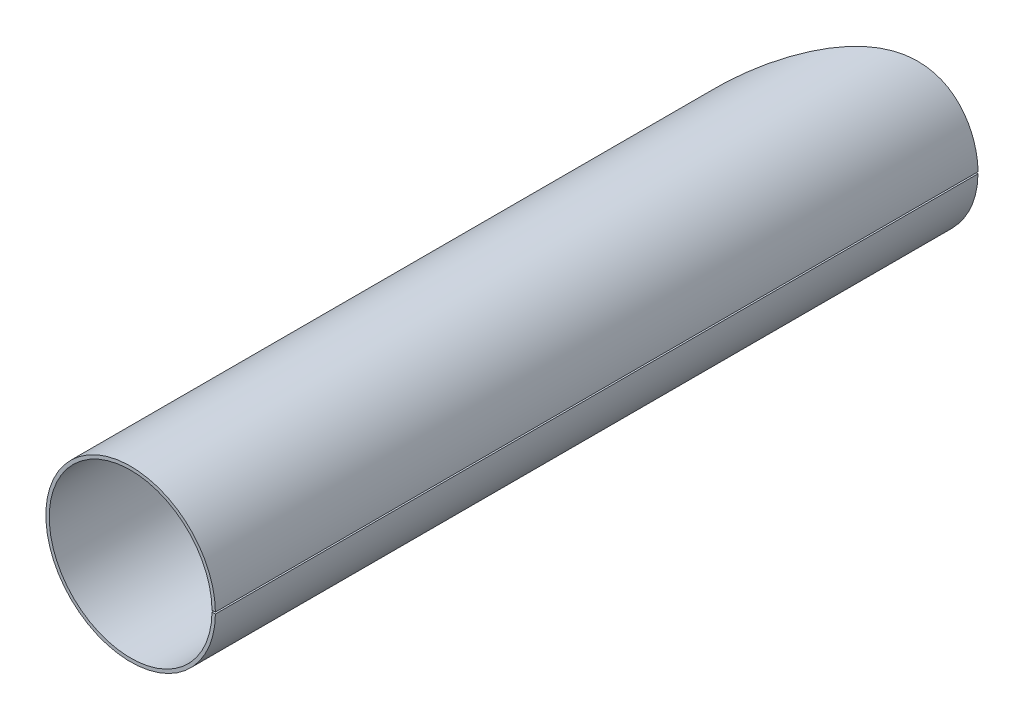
ISO-10303-21;
HEADER;
FILE_DESCRIPTION(('STEP AP214'),'2;1');
FILE_NAME('part.step','',(''),(''),'','','');
FILE_SCHEMA(('AUTOMOTIVE_DESIGN { 1 0 10303 214 1 1 1 1 }'));
ENDSEC;
DATA;
#1=APPLICATION_CONTEXT('core data for automotive mechanical design processes');
#2=APPLICATION_PROTOCOL_DEFINITION('international standard','automotive_design',2000,#1);
#3=PRODUCT_CONTEXT('',#1,'mechanical');
#4=PRODUCT('Part','Part','',(#3));
#5=PRODUCT_RELATED_PRODUCT_CATEGORY('part','',(#4));
#6=PRODUCT_DEFINITION_FORMATION('','',#4);
#7=PRODUCT_DEFINITION_CONTEXT('part definition',#1,'design');
#8=PRODUCT_DEFINITION('design','',#6,#7);
#9=PRODUCT_DEFINITION_SHAPE('','',#8);
#10=(LENGTH_UNIT() NAMED_UNIT(*) SI_UNIT(.MILLI.,.METRE.));
#11=(NAMED_UNIT(*) PLANE_ANGLE_UNIT() SI_UNIT($,.RADIAN.));
#12=(NAMED_UNIT(*) SI_UNIT($,.STERADIAN.) SOLID_ANGLE_UNIT());
#13=UNCERTAINTY_MEASURE_WITH_UNIT(LENGTH_MEASURE(1.E-05),#10,'distance_accuracy_value','');
#14=(GEOMETRIC_REPRESENTATION_CONTEXT(3) GLOBAL_UNCERTAINTY_ASSIGNED_CONTEXT((#13)) GLOBAL_UNIT_ASSIGNED_CONTEXT((#10,
#11,#12)) REPRESENTATION_CONTEXT('',''));
#15=CARTESIAN_POINT('',(0.,0.,0.));
#16=DIRECTION('',(0.,0.,1.));
#17=DIRECTION('',(1.,0.,0.));
#18=AXIS2_PLACEMENT_3D('',#15,#16,#17);
#19=CARTESIAN_POINT('',(0.,0.,-902.697040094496));
#20=DIRECTION('',(0.,0.,1.));
#21=DIRECTION('',(1.,0.,0.));
#22=AXIS2_PLACEMENT_3D('',#19,#20,#21);
#23=CYLINDRICAL_SURFACE('',#22,50.);
#24=DIRECTION('',(0.,0.,1.));
#25=VECTOR('',#24,1.);
#26=CARTESIAN_POINT('',(49.9974999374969,0.5,-902.697040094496));
#27=LINE('',#26,#25);
#28=CARTESIAN_POINT('',(49.9974999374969,0.5,-449.712101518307));
#29=VERTEX_POINT('',#28);
#30=CARTESIAN_POINT('',(49.9974999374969,0.5,0.));
#31=VERTEX_POINT('',#30);
#32=EDGE_CURVE('E11',#29,#31,#27,.T.);
#33=ORIENTED_EDGE('',*,*,#32,.F.);
#34=CARTESIAN_POINT('',(49.9974999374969,-0.499999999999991,-449.712101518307));
#35=CARTESIAN_POINT('',(49.9766016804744,-2.58972120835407,-449.711634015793));
#36=CARTESIAN_POINT('',(49.8230894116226,-4.68980708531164,-449.708442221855));
#37=CARTESIAN_POINT('',(49.2607383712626,-8.81556487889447,-449.693332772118));
#38=CARTESIAN_POINT('',(48.8533819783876,-10.8451032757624,-449.681458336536));
#39=CARTESIAN_POINT('',(47.7920152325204,-14.8388839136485,-449.639855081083));
#40=CARTESIAN_POINT('',(47.1380036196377,-16.8031268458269,-449.610204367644));
#41=CARTESIAN_POINT('',(45.9676534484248,-19.6992119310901,-449.539990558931));
#42=CARTESIAN_POINT('',(45.54435994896,-20.6590999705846,-449.512106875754));
#43=CARTESIAN_POINT('',(44.6435267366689,-22.5398015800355,-449.445447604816));
#44=CARTESIAN_POINT('',(44.1656049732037,-23.4621505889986,-449.406668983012));
#45=CARTESIAN_POINT('',(42.651054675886,-26.1759474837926,-449.269608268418));
#46=CARTESIAN_POINT('',(41.5339076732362,-27.9143434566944,-449.150951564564));
#47=CARTESIAN_POINT('',(39.6987945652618,-30.4150410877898,-448.909163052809));
#48=CARTESIAN_POINT('',(39.0604569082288,-31.2307411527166,-448.817852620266));
#49=CARTESIAN_POINT('',(37.7300021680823,-32.8256823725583,-448.608801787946));
#50=CARTESIAN_POINT('',(37.0375864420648,-33.6047939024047,-448.490908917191));
#51=CARTESIAN_POINT('',(34.9103908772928,-35.8542122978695,-448.095178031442));
#52=CARTESIAN_POINT('',(33.4164992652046,-37.2484369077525,-447.774154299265));
#53=CARTESIAN_POINT('',(30.2917917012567,-39.8310912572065,-446.979431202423));
#54=CARTESIAN_POINT('',(28.6595331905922,-41.0203589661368,-446.505280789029));
#55=CARTESIAN_POINT('',(25.2749410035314,-43.1881470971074,-445.360166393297));
#56=CARTESIAN_POINT('',(23.5659386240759,-44.1393363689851,-444.703394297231));
#57=CARTESIAN_POINT('',(20.1364608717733,-45.8056483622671,-443.204399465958));
#58=CARTESIAN_POINT('',(18.4159671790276,-46.5206885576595,-442.362139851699));
#59=CARTESIAN_POINT('',(15.8388550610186,-47.4337564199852,-440.951225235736));
#60=CARTESIAN_POINT('',(14.9803803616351,-47.711493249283,-440.456382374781));
#61=CARTESIAN_POINT('',(13.6946749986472,-48.0900766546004,-439.676718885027));
#62=CARTESIAN_POINT('',(13.2661205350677,-48.209992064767,-439.410372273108));
#63=CARTESIAN_POINT('',(12.4163209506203,-48.4358159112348,-438.869390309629));
#64=CARTESIAN_POINT('',(11.9942703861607,-48.5419736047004,-438.594279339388));
#65=CARTESIAN_POINT('',(9.89802279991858,-49.0408066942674,-437.196239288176));
#66=CARTESIAN_POINT('',(8.26593097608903,-49.3381392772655,-436.005841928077));
#67=CARTESIAN_POINT('',(5.08368888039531,-49.7667932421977,-433.497264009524));
#68=CARTESIAN_POINT('',(3.53348860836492,-49.8979968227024,-432.179121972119));
#69=CARTESIAN_POINT('',(1.26264349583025,-49.9897953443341,-430.117946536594));
#70=CARTESIAN_POINT('',(0.51452855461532,-50.0027137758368,-429.416526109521));
#71=CARTESIAN_POINT('',(-0.94986814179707,-49.9963386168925,-428.002439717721));
#72=CARTESIAN_POINT('',(-1.66824027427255,-49.9771602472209,-427.287921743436));
#73=CARTESIAN_POINT('',(-3.78626055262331,-49.876472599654,-425.124356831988));
#74=CARTESIAN_POINT('',(-5.14897324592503,-49.752061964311,-423.655374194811));
#75=CARTESIAN_POINT('',(-7.79455880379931,-49.4067247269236,-420.67498507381));
#76=CARTESIAN_POINT('',(-9.07738009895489,-49.1857006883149,-419.163557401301));
#77=CARTESIAN_POINT('',(-12.8272108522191,-48.3941172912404,-414.578506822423));
#78=CARTESIAN_POINT('',(-15.1966984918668,-47.696640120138,-411.454662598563));
#79=CARTESIAN_POINT('',(-18.6130723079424,-46.4223095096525,-406.706525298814));
#80=CARTESIAN_POINT('',(-19.72857076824,-45.9590627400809,-405.113261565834));
#81=CARTESIAN_POINT('',(-21.3718080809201,-45.2062916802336,-402.711247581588));
#82=CARTESIAN_POINT('',(-21.9145391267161,-44.9456961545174,-401.908550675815));
#83=CARTESIAN_POINT('',(-22.9906522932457,-44.4048706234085,-400.299664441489));
#84=CARTESIAN_POINT('',(-23.52457973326,-44.1243333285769,-399.492636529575));
#85=CARTESIAN_POINT('',(-26.1642965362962,-42.6758934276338,-395.462424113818));
#86=CARTESIAN_POINT('',(-28.1811237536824,-41.3730026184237,-392.254621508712));
#87=CARTESIAN_POINT('',(-32.0590862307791,-38.4462751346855,-385.906371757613));
#88=CARTESIAN_POINT('',(-33.9201149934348,-36.8232627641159,-382.765470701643));
#89=CARTESIAN_POINT('',(-36.6025322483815,-34.0864541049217,-378.138372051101));
#90=CARTESIAN_POINT('',(-37.4783153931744,-33.1233643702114,-376.610164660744));
#91=CARTESIAN_POINT('',(-38.763622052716,-31.5883990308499,-374.345382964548));
#92=CARTESIAN_POINT('',(-39.1873154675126,-31.0616332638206,-373.595062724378));
#93=CARTESIAN_POINT('',(-40.0248744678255,-29.9746589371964,-372.104988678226));
#94=CARTESIAN_POINT('',(-40.4392673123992,-29.4136366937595,-371.364278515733));
#95=CARTESIAN_POINT('',(-41.6583077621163,-27.6870159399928,-369.175984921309));
#96=CARTESIAN_POINT('',(-42.4413763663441,-26.4753480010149,-367.757725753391));
#97=CARTESIAN_POINT('',(-43.9407918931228,-23.9044198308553,-365.022866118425));
#98=CARTESIAN_POINT('',(-44.6572618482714,-22.5454952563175,-363.706019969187));
#99=CARTESIAN_POINT('',(-45.6717248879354,-20.3650716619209,-361.830585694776));
#100=CARTESIAN_POINT('',(-45.9997807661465,-19.6144425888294,-361.222186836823));
#101=CARTESIAN_POINT('',(-46.6329343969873,-18.0575640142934,-360.044802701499));
#102=CARTESIAN_POINT('',(-46.9378908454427,-17.2510354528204,-359.47606602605));
#103=CARTESIAN_POINT('',(-47.7992169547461,-14.774645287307,-357.865964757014));
#104=CARTESIAN_POINT('',(-48.3076286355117,-13.0374689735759,-356.910338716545));
#105=CARTESIAN_POINT('',(-48.838490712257,-10.7250634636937,-355.909667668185));
#106=CARTESIAN_POINT('',(-48.9393749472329,-10.2554606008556,-355.719329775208));
#107=CARTESIAN_POINT('',(-49.1297420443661,-9.30082464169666,-355.359906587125));
#108=CARTESIAN_POINT('',(-49.2194457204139,-8.81432461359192,-355.190403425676));
#109=CARTESIAN_POINT('',(-49.4672711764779,-7.34667979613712,-354.721829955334));
#110=CARTESIAN_POINT('',(-49.60491652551,-6.3543892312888,-354.461178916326));
#111=CARTESIAN_POINT('',(-49.8215710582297,-4.34016857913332,-354.050655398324));
#112=CARTESIAN_POINT('',(-49.9005899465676,-3.3182431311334,-353.900765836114));
#113=CARTESIAN_POINT('',(-49.9716693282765,-1.76129729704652,-353.765918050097));
#114=CARTESIAN_POINT('',(-49.9874463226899,-1.23612335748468,-353.735979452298));
#115=CARTESIAN_POINT('',(-50.0023605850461,-0.191642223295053,-353.707678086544));
#116=CARTESIAN_POINT('',(-50.0016011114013,0.328154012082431,-353.709119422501));
#117=CARTESIAN_POINT('',(-49.9578433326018,2.91524779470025,-353.792153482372));
#118=CARTESIAN_POINT('',(-49.7955137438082,4.94702176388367,-354.10038507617));
#119=CARTESIAN_POINT('',(-49.4454535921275,7.44320209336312,-354.763002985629));
#120=CARTESIAN_POINT('',(-49.368118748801,7.93936303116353,-354.90931433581));
#121=CARTESIAN_POINT('',(-49.2013994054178,8.91442262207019,-355.224508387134));
#122=CARTESIAN_POINT('',(-49.1117898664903,9.3949972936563,-355.393817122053));
#123=CARTESIAN_POINT('',(-48.8254227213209,10.8172828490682,-355.934440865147));
#124=CARTESIAN_POINT('',(-48.6111722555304,11.739605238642,-356.338369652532));
#125=CARTESIAN_POINT('',(-48.1411323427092,13.5386770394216,-357.222680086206));
#126=CARTESIAN_POINT('',(-47.8846801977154,14.417411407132,-357.704303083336));
#127=CARTESIAN_POINT('',(-47.3368304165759,16.1254096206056,-358.730645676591));
#128=CARTESIAN_POINT('',(-47.0483932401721,16.9460198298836,-359.269820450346));
#129=CARTESIAN_POINT('',(-46.1459774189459,19.3241907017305,-360.952126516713));
#130=CARTESIAN_POINT('',(-45.4952456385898,20.7989289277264,-362.159381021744));
#131=CARTESIAN_POINT('',(-44.1164585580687,23.5828519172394,-364.700126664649));
#132=CARTESIAN_POINT('',(-43.3881902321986,24.8915116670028,-366.034034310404));
#133=CARTESIAN_POINT('',(-42.2460134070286,26.7545314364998,-368.109574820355));
#134=CARTESIAN_POINT('',(-41.856937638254,27.3587495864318,-368.813967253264));
#135=CARTESIAN_POINT('',(-41.0629821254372,28.5365713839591,-370.245339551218));
#136=CARTESIAN_POINT('',(-40.6573647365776,29.111158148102,-370.973637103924));
#137=CARTESIAN_POINT('',(-39.4229611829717,30.7856050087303,-373.180021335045));
#138=CARTESIAN_POINT('',(-38.581180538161,31.8309041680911,-374.67151759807));
#139=CARTESIAN_POINT('',(-36.8625626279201,33.8062927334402,-377.685340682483));
#140=CARTESIAN_POINT('',(-35.9856996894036,34.7362180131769,-379.207725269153));
#141=CARTESIAN_POINT('',(-33.3033902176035,37.3789499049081,-383.810248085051));
#142=CARTESIAN_POINT('',(-31.4468388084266,38.9463640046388,-386.92537806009));
#143=CARTESIAN_POINT('',(-27.5849010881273,41.7707573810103,-393.207692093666));
#144=CARTESIAN_POINT('',(-25.5796330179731,43.0269930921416,-396.375271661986));
#145=CARTESIAN_POINT('',(-22.4347316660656,44.700030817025,-401.141716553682));
#146=CARTESIAN_POINT('',(-21.3634204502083,45.2221883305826,-402.733076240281));
#147=CARTESIAN_POINT('',(-19.1678310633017,46.1956307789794,-405.916847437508));
#148=CARTESIAN_POINT('',(-18.0410078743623,46.6477523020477,-407.512711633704));
#149=CARTESIAN_POINT('',(-14.5934684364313,47.885213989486,-412.25950070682));
#150=CARTESIAN_POINT('',(-12.2040821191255,48.5556394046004,-415.375083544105));
#151=CARTESIAN_POINT('',(-8.42644600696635,49.3015460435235,-419.934570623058));
#152=CARTESIAN_POINT('',(-7.13470915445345,49.5064852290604,-421.435269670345));
#153=CARTESIAN_POINT('',(-4.47241261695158,49.8176041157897,-424.389290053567));
#154=CARTESIAN_POINT('',(-3.10189634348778,49.9238787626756,-425.842631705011));
#155=CARTESIAN_POINT('',(-0.973614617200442,49.9955591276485,-427.978618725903));
#156=CARTESIAN_POINT('',(-0.252066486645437,50.0047678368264,-428.683257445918));
#157=CARTESIAN_POINT('',(1.21802672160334,49.9905666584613,-430.076136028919));
#158=CARTESIAN_POINT('',(1.96263695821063,49.9671572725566,-430.76059472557));
#159=CARTESIAN_POINT('',(4.22176233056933,49.8442747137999,-432.770480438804));
#160=CARTESIAN_POINT('',(5.7637918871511,49.6924304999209,-434.054517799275));
#161=CARTESIAN_POINT('',(8.92841399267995,49.2223767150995,-436.495568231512));
#162=CARTESIAN_POINT('',(10.5510568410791,48.9042831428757,-437.652542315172));
#163=CARTESIAN_POINT('',(12.6342299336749,48.3793431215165,-439.009676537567));
#164=CARTESIAN_POINT('',(13.0536019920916,48.2679567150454,-439.276650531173));
#165=CARTESIAN_POINT('',(13.8979039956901,48.0316607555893,-439.801460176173));
#166=CARTESIAN_POINT('',(14.3236799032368,47.9064836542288,-440.059789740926));
#167=CARTESIAN_POINT('',(15.6023483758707,47.5117106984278,-440.81657084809));
#168=CARTESIAN_POINT('',(16.4557258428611,47.2232649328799,-441.296413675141));
#169=CARTESIAN_POINT('',(19.0162456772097,46.2784297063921,-442.66332198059));
#170=CARTESIAN_POINT('',(20.7239363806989,45.5426867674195,-443.477579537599));
#171=CARTESIAN_POINT('',(23.2740169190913,44.2631291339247,-444.562602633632));
#172=CARTESIAN_POINT('',(24.1220948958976,43.8072525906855,-444.901597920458));
#173=CARTESIAN_POINT('',(25.3893593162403,43.0768864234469,-445.377615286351));
#174=CARTESIAN_POINT('',(25.8109693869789,42.8256695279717,-445.530877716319));
#175=CARTESIAN_POINT('',(26.6522122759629,42.307253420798,-445.826868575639));
#176=CARTESIAN_POINT('',(27.0723764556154,42.0396671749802,-445.969752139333));
#177=CARTESIAN_POINT('',(29.148895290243,40.6730479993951,-446.652733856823));
#178=CARTESIAN_POINT('',(30.746240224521,39.4800399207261,-447.103925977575));
#179=CARTESIAN_POINT('',(33.8031497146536,36.8965026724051,-447.860731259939));
#180=CARTESIAN_POINT('',(35.2627612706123,35.5060174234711,-448.166314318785));
#181=CARTESIAN_POINT('',(37.33895758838,33.2691621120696,-448.543092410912));
#182=CARTESIAN_POINT('',(38.012123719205,32.4983055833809,-448.655026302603));
#183=CARTESIAN_POINT('',(39.3185471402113,30.9049068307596,-448.855520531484));
#184=CARTESIAN_POINT('',(39.9465534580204,30.0885802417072,-448.943265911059));
#185=CARTESIAN_POINT('',(41.7451912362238,27.5959813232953,-449.174799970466));
#186=CARTESIAN_POINT('',(42.8355474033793,25.870409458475,-449.287971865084));
#187=CARTESIAN_POINT('',(44.8008224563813,22.2945848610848,-449.462195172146));
#188=CARTESIAN_POINT('',(45.6757647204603,20.4443376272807,-449.523120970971));
#189=CARTESIAN_POINT('',(46.8213240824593,17.5734236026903,-449.590830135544));
#190=CARTESIAN_POINT('',(47.1761672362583,16.5973808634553,-449.609426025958));
#191=CARTESIAN_POINT('',(47.820492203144,14.6377707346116,-449.640212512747));
#192=CARTESIAN_POINT('',(48.1109734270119,13.6522474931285,-449.652473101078));
#193=CARTESIAN_POINT('',(48.8892622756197,10.6788827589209,-449.68259854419));
#194=CARTESIAN_POINT('',(49.2842565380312,8.67430905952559,-449.694002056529));
#195=CARTESIAN_POINT('',(49.8279989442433,4.62083340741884,-449.70853473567));
#196=CARTESIAN_POINT('',(49.976779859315,2.57190421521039,-449.711638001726));
#197=CARTESIAN_POINT('',(49.9974999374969,0.5,-449.712101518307));
#198=B_SPLINE_CURVE_WITH_KNOTS('',3,(#34,#35,#36,#37,#38,#39,#40,#41,#42,#43,#44,#45,#46,#47,
#48,#49,#50,#51,#52,#53,#54,#55,#56,#57,#58,#59,#60,#61,#62,#63,#64,#65,#66,#67,#68,#69,#70,#71,
#72,#73,#74,#75,#76,#77,#78,#79,#80,#81,#82,#83,#84,#85,#86,#87,#88,#89,#90,#91,#92,#93,#94,#95,
#96,#97,#98,#99,#100,#101,#102,#103,#104,#105,#106,#107,#108,#109,#110,#111,#112,#113,#114,#115,
#116,#117,#118,#119,#120,#121,#122,#123,#124,#125,#126,#127,#128,#129,#130,#131,#132,#133,#134,
#135,#136,#137,#138,#139,#140,#141,#142,#143,#144,#145,#146,#147,#148,#149,#150,#151,#152,#153,
#154,#155,#156,#157,#158,#159,#160,#161,#162,#163,#164,#165,#166,#167,#168,#169,#170,#171,#172,
#173,#174,#175,#176,#177,#178,#179,#180,#181,#182,#183,#184,#185,#186,#187,#188,#189,#190,#191,
#192,#193,#194,#195,#196,#197),.UNSPECIFIED.,.F.,.F.,(4,2,2,2,2,2,2,2,2,2,2,2,2,2,2,2,2,2,2,2,2,
2,2,2,2,2,2,2,2,2,2,2,2,2,2,2,2,2,2,2,2,2,2,2,2,2,2,2,2,2,2,2,2,2,2,2,2,2,2,2,2,2,2,2,2,2,2,2,2,
2,2,2,2,2,2,2,2,2,2,2,2,4),(0.,0.00588346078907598,0.0117669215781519,0.0176503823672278,
0.0205921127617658,0.0235338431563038,0.0294173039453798,0.0323590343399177,0.0353007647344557,
0.0411842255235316,0.0470676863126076,0.0529511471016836,0.0588346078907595,0.0617763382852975,
0.0632472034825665,0.0647180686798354,0.0706015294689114,0.0764849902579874,0.0794267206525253,
0.0823684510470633,0.0882519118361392,0.0941353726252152,0.105902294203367,0.111785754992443,
0.114727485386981,0.117669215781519,0.129436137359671,0.141203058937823,0.147086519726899,
0.150028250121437,0.152969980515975,0.158853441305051,0.164736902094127,0.167678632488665,
0.170620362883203,0.176503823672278,0.177974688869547,0.179445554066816,0.182387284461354,
0.185329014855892,0.186799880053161,0.18827074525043,0.194154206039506,0.195625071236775,
0.197095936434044,0.200037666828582,0.20297939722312,0.205921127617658,0.211804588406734,
0.21768804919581,0.220629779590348,0.223571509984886,0.229454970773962,0.235338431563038,
0.24710535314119,0.258872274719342,0.264755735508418,0.270639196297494,0.282406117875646,
0.288289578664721,0.294173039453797,0.297114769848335,0.300056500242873,0.305939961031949,
0.311823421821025,0.313294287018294,0.314765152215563,0.317706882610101,0.323590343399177,
0.326532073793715,0.328002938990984,0.329473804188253,0.335357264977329,0.341240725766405,
0.344182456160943,0.347124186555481,0.353007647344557,0.358891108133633,0.361832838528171,
0.364774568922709,0.370658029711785,0.376541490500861),.UNSPECIFIED.);
#199=CARTESIAN_POINT('',(-33.062636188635,37.5082996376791,-384.192085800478));
#200=VERTEX_POINT('',#199);
#201=EDGE_CURVE('E114',#29,#200,#198,.F.);
#202=ORIENTED_EDGE('',*,*,#201,.T.);
#203=CARTESIAN_POINT('',(49.9974999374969,-0.49999999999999,-451.712200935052));
#204=CARTESIAN_POINT('',(49.9764620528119,-2.60368327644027,-451.71256689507));
#205=CARTESIAN_POINT('',(49.8232703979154,-4.69678811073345,-451.715485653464));
#206=CARTESIAN_POINT('',(49.3957826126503,-7.8205615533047,-451.720980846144));
#207=CARTESIAN_POINT('',(49.2203428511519,-8.85717202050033,-451.722946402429));
#208=CARTESIAN_POINT('',(48.8073725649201,-10.9055962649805,-451.726080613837));
#209=CARTESIAN_POINT('',(48.5695504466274,-11.9197010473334,-451.727254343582));
#210=CARTESIAN_POINT('',(47.7635110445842,-14.9321474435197,-451.727489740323));
#211=CARTESIAN_POINT('',(47.1030742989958,-16.9007362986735,-451.723521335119));
#212=CARTESIAN_POINT('',(45.9270202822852,-19.7937472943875,-451.698986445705));
#213=CARTESIAN_POINT('',(45.5040144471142,-20.7480769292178,-451.687652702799));
#214=CARTESIAN_POINT('',(44.5947923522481,-22.6363098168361,-451.655725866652));
#215=CARTESIAN_POINT('',(44.1077577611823,-23.5711828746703,-451.635062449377));
#216=CARTESIAN_POINT('',(42.5705799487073,-26.3082791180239,-451.55491256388));
#217=CARTESIAN_POINT('',(41.4391639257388,-28.0555298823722,-451.477468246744));
#218=CARTESIAN_POINT('',(38.9686135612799,-31.3968823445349,-451.242883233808));
#219=CARTESIAN_POINT('',(37.6294638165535,-32.9909866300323,-451.08594371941));
#220=CARTESIAN_POINT('',(34.7402703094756,-36.0207629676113,-450.647461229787));
#221=CARTESIAN_POINT('',(33.2196952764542,-37.4252305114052,-450.369980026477));
#222=CARTESIAN_POINT('',(30.0470008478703,-40.0171684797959,-449.656556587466));
#223=CARTESIAN_POINT('',(28.3941799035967,-41.2052388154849,-449.220540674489));
#224=CARTESIAN_POINT('',(25.8251438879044,-42.8262446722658,-448.409043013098));
#225=CARTESIAN_POINT('',(24.950959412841,-43.3409819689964,-448.110985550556));
#226=CARTESIAN_POINT('',(23.2059663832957,-44.2998218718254,-447.46750466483));
#227=CARTESIAN_POINT('',(22.3319218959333,-44.746195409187,-447.121196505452));
#228=CARTESIAN_POINT('',(19.7093375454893,-45.9922707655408,-446.005125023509));
#229=CARTESIAN_POINT('',(17.9605434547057,-46.6990820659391,-445.157943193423));
#230=CARTESIAN_POINT('',(15.3498884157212,-47.5944037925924,-443.723236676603));
#231=CARTESIAN_POINT('',(14.4817096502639,-47.8653201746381,-443.217745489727));
#232=CARTESIAN_POINT('',(12.7510356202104,-48.3551432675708,-442.151527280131));
#233=CARTESIAN_POINT('',(11.8855916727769,-48.5746037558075,-441.588639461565));
#234=CARTESIAN_POINT('',(9.3357240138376,-49.1516218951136,-439.84242123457));
#235=CARTESIAN_POINT('',(7.68928746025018,-49.4314659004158,-438.5971933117));
#236=CARTESIAN_POINT('',(4.49150020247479,-49.823903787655,-435.965488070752));
#237=CARTESIAN_POINT('',(2.94008976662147,-49.9363464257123,-434.579060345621));
#238=CARTESIAN_POINT('',(0.674664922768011,-50.0011553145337,-432.408488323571));
#239=CARTESIAN_POINT('',(-0.0718297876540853,-50.0052834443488,-431.6680513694));
#240=CARTESIAN_POINT('',(-1.53250708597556,-49.9818462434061,-430.173051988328));
#241=CARTESIAN_POINT('',(-2.24794988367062,-49.9543952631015,-429.417403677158));
#242=CARTESIAN_POINT('',(-4.35471437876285,-49.8298705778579,-427.128890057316));
#243=CARTESIAN_POINT('',(-5.70667087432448,-49.6908938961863,-425.574553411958));
#244=CARTESIAN_POINT('',(-8.3270091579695,-49.3194885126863,-422.421159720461));
#245=CARTESIAN_POINT('',(-9.59532253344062,-49.0869491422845,-420.8220726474));
#246=CARTESIAN_POINT('',(-13.2985744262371,-48.2653403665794,-415.972379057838));
#247=CARTESIAN_POINT('',(-15.6331054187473,-47.5538677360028,-412.669995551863));
#248=CARTESIAN_POINT('',(-20.1175576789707,-45.8371922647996,-405.983256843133));
#249=CARTESIAN_POINT('',(-22.2677148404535,-44.831019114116,-402.597046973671));
#250=CARTESIAN_POINT('',(-26.4277951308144,-42.5116812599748,-395.787511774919));
#251=CARTESIAN_POINT('',(-28.4151808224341,-41.2111703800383,-392.400837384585));
#252=CARTESIAN_POINT('',(-32.2390595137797,-38.2939434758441,-385.700158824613));
#253=CARTESIAN_POINT('',(-34.0754251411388,-36.6780581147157,-382.38566991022));
#254=CARTESIAN_POINT('',(-36.7243119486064,-33.9548015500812,-377.503635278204));
#255=CARTESIAN_POINT('',(-37.589494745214,-32.9967124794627,-375.891360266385));
#256=CARTESIAN_POINT('',(-38.8597582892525,-31.469945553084,-373.502109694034));
#257=CARTESIAN_POINT('',(-39.2785803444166,-30.9460292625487,-372.710572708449));
#258=CARTESIAN_POINT('',(-40.1066835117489,-29.8649885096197,-371.138668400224));
#259=CARTESIAN_POINT('',(-40.5167151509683,-29.3067756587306,-370.356860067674));
#260=CARTESIAN_POINT('',(-41.7251143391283,-27.5858669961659,-368.04343295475));
#261=CARTESIAN_POINT('',(-42.5017424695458,-26.3779908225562,-366.543970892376));
#262=CARTESIAN_POINT('',(-43.9895053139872,-23.8142800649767,-363.652283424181));
#263=CARTESIAN_POINT('',(-44.7007641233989,-22.4587887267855,-362.259794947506));
#264=CARTESIAN_POINT('',(-45.7082693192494,-20.2828250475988,-360.276455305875));
#265=CARTESIAN_POINT('',(-46.0341489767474,-19.5335653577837,-359.633021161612));
#266=CARTESIAN_POINT('',(-46.663220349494,-17.9790687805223,-358.387796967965));
#267=CARTESIAN_POINT('',(-46.9668636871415,-17.1720278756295,-357.785096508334));
#268=CARTESIAN_POINT('',(-47.8245564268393,-14.6925527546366,-356.078916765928));
#269=CARTESIAN_POINT('',(-48.3307665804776,-12.9521182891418,-355.066700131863));
#270=CARTESIAN_POINT('',(-48.8586229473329,-10.6330257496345,-354.008380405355));
#271=CARTESIAN_POINT('',(-48.9588916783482,-10.1619512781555,-353.807177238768));
#272=CARTESIAN_POINT('',(-49.1479769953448,-9.20405809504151,-353.427495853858));
#273=CARTESIAN_POINT('',(-49.237038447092,-8.71563715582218,-353.248524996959));
#274=CARTESIAN_POINT('',(-49.482915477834,-7.24114770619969,-352.754149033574));
#275=CARTESIAN_POINT('',(-49.6190351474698,-6.24399513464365,-352.480064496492));
#276=CARTESIAN_POINT('',(-49.8320486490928,-4.21936626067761,-352.050903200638));
#277=CARTESIAN_POINT('',(-49.9089527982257,-3.19189497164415,-351.895807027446));
#278=CARTESIAN_POINT('',(-49.9762840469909,-1.62603000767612,-351.76000216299));
#279=CARTESIAN_POINT('',(-49.9906964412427,-1.09789053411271,-351.730926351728));
#280=CARTESIAN_POINT('',(-50.0027268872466,-0.0489708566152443,-351.706656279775));
#281=CARTESIAN_POINT('',(-50.0004626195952,0.472955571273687,-351.711224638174));
#282=CARTESIAN_POINT('',(-49.9488998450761,3.07027532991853,-351.81524341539));
#283=CARTESIAN_POINT('',(-49.7794393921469,5.1088789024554,-352.157293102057));
#284=CARTESIAN_POINT('',(-49.3478064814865,8.11278638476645,-353.025906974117));
#285=CARTESIAN_POINT('',(-49.176661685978,9.08791498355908,-353.370010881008));
#286=CARTESIAN_POINT('',(-48.7886884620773,10.9817180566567,-354.148779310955));
#287=CARTESIAN_POINT('',(-48.5715462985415,11.9023996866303,-354.584074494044));
#288=CARTESIAN_POINT('',(-48.2149777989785,13.2488291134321,-355.297437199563));
#289=CARTESIAN_POINT('',(-48.0909666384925,13.6918594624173,-355.545319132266));
#290=CARTESIAN_POINT('',(-47.8331517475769,14.5670066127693,-356.060115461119));
#291=CARTESIAN_POINT('',(-47.6990025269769,15.0001290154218,-356.327717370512));
#292=CARTESIAN_POINT('',(-47.2864631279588,16.2722234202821,-357.149723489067));
#293=CARTESIAN_POINT('',(-46.9973699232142,17.0867347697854,-357.724553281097));
#294=CARTESIAN_POINT('',(-46.0942076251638,19.446366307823,-359.515764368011));
#295=CARTESIAN_POINT('',(-45.4445999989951,20.9084337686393,-360.798181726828));
#296=CARTESIAN_POINT('',(-44.0709015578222,23.6670637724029,-363.492734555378));
#297=CARTESIAN_POINT('',(-43.3466004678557,24.9630895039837,-364.905306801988));
#298=CARTESIAN_POINT('',(-41.8342667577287,27.4222124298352,-367.832634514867));
#299=CARTESIAN_POINT('',(-41.0455091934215,28.5859424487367,-369.348793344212));
#300=CARTESIAN_POINT('',(-39.4127468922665,30.7981381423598,-372.45983057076));
#301=CARTESIAN_POINT('',(-38.5785811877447,31.8335299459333,-374.035977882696));
#302=CARTESIAN_POINT('',(-36.8771466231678,33.7898892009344,-377.219132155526));
#303=CARTESIAN_POINT('',(-36.0098534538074,34.7106905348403,-378.826197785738));
#304=CARTESIAN_POINT('',(-33.3590552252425,37.3274666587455,-383.682705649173));
#305=CARTESIAN_POINT('',(-31.5272362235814,38.879448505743,-386.967094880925));
#306=CARTESIAN_POINT('',(-27.7220033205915,41.6781558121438,-393.587083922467));
#307=CARTESIAN_POINT('',(-25.7487255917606,42.9241201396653,-396.923097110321));
#308=CARTESIAN_POINT('',(-21.6267398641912,45.141567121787,-403.613076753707));
#309=CARTESIAN_POINT('',(-19.4785931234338,46.1131323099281,-406.96733475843));
#310=CARTESIAN_POINT('',(-14.9420495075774,47.7762673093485,-413.658370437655));
#311=CARTESIAN_POINT('',(-12.5833283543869,48.4574054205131,-416.951747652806));
#312=CARTESIAN_POINT('',(-8.84926146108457,49.227082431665,-421.766661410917));
#313=CARTESIAN_POINT('',(-7.57157478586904,49.4412426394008,-423.350645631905));
#314=CARTESIAN_POINT('',(-4.93520835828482,49.7735766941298,-426.465996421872));
#315=CARTESIAN_POINT('',(-3.57658004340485,49.8918529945,-427.997390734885));
#316=CARTESIAN_POINT('',(-1.46313273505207,49.9835620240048,-430.244913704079));
#317=CARTESIAN_POINT('',(-0.746024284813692,49.9997819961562,-430.985801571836));
#318=CARTESIAN_POINT('',(0.716510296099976,50.0002136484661,-432.448968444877));
#319=CARTESIAN_POINT('',(1.46274081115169,49.9843027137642,-433.171865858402));
#320=CARTESIAN_POINT('',(3.72571838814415,49.8838604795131,-435.288013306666));
#321=CARTESIAN_POINT('',(5.27344533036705,49.7471021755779,-436.635630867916));
#322=CARTESIAN_POINT('',(8.45758901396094,49.3057054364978,-439.185713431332));
#323=CARTESIAN_POINT('',(10.0940700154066,49.0011922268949,-440.388120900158));
#324=CARTESIAN_POINT('',(12.2006785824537,48.4905288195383,-441.788477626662));
#325=CARTESIAN_POINT('',(12.6250434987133,48.3818598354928,-442.063418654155));
#326=CARTESIAN_POINT('',(13.4799631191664,48.1506664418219,-442.602757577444));
#327=CARTESIAN_POINT('',(13.9114093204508,48.0278697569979,-442.867681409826));
#328=CARTESIAN_POINT('',(15.2081196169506,47.6395573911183,-443.642063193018));
#329=CARTESIAN_POINT('',(16.0738383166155,47.3548211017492,-444.130104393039));
#330=CARTESIAN_POINT('',(18.6720810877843,46.4192075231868,-445.511638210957));
#331=CARTESIAN_POINT('',(20.4058591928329,45.6870575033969,-446.322303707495));
#332=CARTESIAN_POINT('',(22.9953143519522,44.4088065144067,-447.385541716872));
#333=CARTESIAN_POINT('',(23.8565556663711,43.9526881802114,-447.714556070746));
#334=CARTESIAN_POINT('',(25.1434691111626,43.2209378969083,-448.172068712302));
#335=CARTESIAN_POINT('',(25.5716128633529,42.9690895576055,-448.318574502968));
#336=CARTESIAN_POINT('',(26.425865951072,42.4490712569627,-448.599970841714));
#337=CARTESIAN_POINT('',(26.8524735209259,42.1805347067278,-448.734988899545));
#338=CARTESIAN_POINT('',(28.9596635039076,40.8091088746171,-449.376273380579));
#339=CARTESIAN_POINT('',(30.578050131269,39.6113267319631,-449.786849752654));
#340=CARTESIAN_POINT('',(33.6715634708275,37.0175656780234,-450.456588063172));
#341=CARTESIAN_POINT('',(35.1467384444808,35.6216255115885,-450.715683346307));
#342=CARTESIAN_POINT('',(37.2431547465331,33.3765753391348,-451.022598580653));
#343=CARTESIAN_POINT('',(37.9225383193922,32.6029816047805,-451.111203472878));
#344=CARTESIAN_POINT('',(39.2404939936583,31.0041441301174,-451.265481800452));
#345=CARTESIAN_POINT('',(39.8740095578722,30.1848294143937,-451.330550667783));
#346=CARTESIAN_POINT('',(41.6876213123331,27.6836502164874,-451.496164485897));
#347=CARTESIAN_POINT('',(42.7863286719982,25.9523990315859,-451.568103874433));
#348=CARTESIAN_POINT('',(44.7660356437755,22.3651288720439,-451.667052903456));
#349=CARTESIAN_POINT('',(45.6470518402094,20.5091140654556,-451.693912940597));
#350=CARTESIAN_POINT('',(46.8003928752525,17.629308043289,-451.716745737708));
#351=CARTESIAN_POINT('',(47.1576215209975,16.6502270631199,-451.721383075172));
#352=CARTESIAN_POINT('',(47.8062792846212,14.6843791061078,-451.726761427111));
#353=CARTESIAN_POINT('',(48.0986958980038,13.6957039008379,-451.727533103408));
#354=CARTESIAN_POINT('',(48.8821431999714,10.7127720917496,-451.726826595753));
#355=CARTESIAN_POINT('',(49.2797185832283,8.70167180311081,-451.722512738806));
#356=CARTESIAN_POINT('',(49.826985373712,4.63479065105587,-451.715395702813));
#357=CARTESIAN_POINT('',(49.9767090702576,2.578982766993,-451.712562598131));
#358=CARTESIAN_POINT('',(49.9974999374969,0.5,-451.712200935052));
#359=B_SPLINE_CURVE_WITH_KNOTS('',3,(#203,#204,#205,#206,#207,#208,#209,#210,#211,#212,#213,
#214,#215,#216,#217,#218,#219,#220,#221,#222,#223,#224,#225,#226,#227,#228,#229,#230,#231,#232,
#233,#234,#235,#236,#237,#238,#239,#240,#241,#242,#243,#244,#245,#246,#247,#248,#249,#250,#251,
#252,#253,#254,#255,#256,#257,#258,#259,#260,#261,#262,#263,#264,#265,#266,#267,#268,#269,#270,
#271,#272,#273,#274,#275,#276,#277,#278,#279,#280,#281,#282,#283,#284,#285,#286,#287,#288,#289,
#290,#291,#292,#293,#294,#295,#296,#297,#298,#299,#300,#301,#302,#303,#304,#305,#306,#307,#308,
#309,#310,#311,#312,#313,#314,#315,#316,#317,#318,#319,#320,#321,#322,#323,#324,#325,#326,#327,
#328,#329,#330,#331,#332,#333,#334,#335,#336,#337,#338,#339,#340,#341,#342,#343,#344,#345,#346,
#347,#348,#349,#350,#351,#352,#353,#354,#355,#356,#357,#358),.UNSPECIFIED.,.F.,.F.,(4,2,2,2,2,2,
2,2,2,2,2,2,2,2,2,2,2,2,2,2,2,2,2,2,2,2,2,2,2,2,2,2,2,2,2,2,2,2,2,2,2,2,2,2,2,2,2,2,2,2,2,2,2,2,
2,2,2,2,2,2,2,2,2,2,2,2,2,2,2,2,2,2,2,2,2,2,2,4),(0.,0.00614919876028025,0.00922379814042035,
0.0122983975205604,0.0184475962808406,0.0215221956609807,0.0245967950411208,0.030745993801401,
0.0368951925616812,0.0430443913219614,0.0491935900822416,0.0522681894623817,0.0553427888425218,
0.061491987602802,0.0645665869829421,0.0676411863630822,0.0737903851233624,0.0799395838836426,
0.0830141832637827,0.0860887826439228,0.092237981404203,0.0983871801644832,0.110685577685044,
0.122983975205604,0.135282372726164,0.147580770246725,0.153729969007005,0.156804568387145,
0.159879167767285,0.166028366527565,0.172177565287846,0.175252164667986,0.178326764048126,
0.184475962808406,0.186013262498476,0.187550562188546,0.190625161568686,0.193699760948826,
0.195237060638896,0.196774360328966,0.202923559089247,0.205998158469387,0.209072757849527,
0.210610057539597,0.212147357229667,0.215221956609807,0.221371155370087,0.227520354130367,
0.233669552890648,0.239818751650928,0.245967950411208,0.258266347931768,0.270564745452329,
0.282863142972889,0.295161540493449,0.30131073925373,0.30745993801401,0.31053453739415,
0.31360913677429,0.31975833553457,0.32590753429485,0.327444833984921,0.328982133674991,
0.332056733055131,0.338205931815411,0.341280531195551,0.342817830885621,0.344355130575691,
0.350504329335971,0.356653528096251,0.359728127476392,0.362802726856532,0.368951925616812,
0.375101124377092,0.378175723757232,0.381250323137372,0.387399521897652,0.393548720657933),.UNSPECIFIED.);
#360=CARTESIAN_POINT('',(-33.0627812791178,-37.5082017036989,-384.191796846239));
#361=VERTEX_POINT('',#360);
#362=EDGE_CURVE('E112',#200,#361,#359,.F.);
#363=ORIENTED_EDGE('',*,*,#362,.T.);
#364=CARTESIAN_POINT('',(49.9974999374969,-0.499999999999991,-449.712101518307));
#365=CARTESIAN_POINT('',(49.9766016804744,-2.58972120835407,-449.711634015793));
#366=CARTESIAN_POINT('',(49.8230894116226,-4.68980708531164,-449.708442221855));
#367=CARTESIAN_POINT('',(49.2607383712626,-8.81556487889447,-449.693332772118));
#368=CARTESIAN_POINT('',(48.8533819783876,-10.8451032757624,-449.681458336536));
#369=CARTESIAN_POINT('',(47.7920152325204,-14.8388839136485,-449.639855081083));
#370=CARTESIAN_POINT('',(47.1380036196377,-16.8031268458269,-449.610204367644));
#371=CARTESIAN_POINT('',(45.9676534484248,-19.6992119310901,-449.539990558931));
#372=CARTESIAN_POINT('',(45.54435994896,-20.6590999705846,-449.512106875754));
#373=CARTESIAN_POINT('',(44.6435267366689,-22.5398015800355,-449.445447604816));
#374=CARTESIAN_POINT('',(44.1656049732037,-23.4621505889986,-449.406668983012));
#375=CARTESIAN_POINT('',(42.651054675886,-26.1759474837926,-449.269608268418));
#376=CARTESIAN_POINT('',(41.5339076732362,-27.9143434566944,-449.150951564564));
#377=CARTESIAN_POINT('',(39.6987945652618,-30.4150410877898,-448.909163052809));
#378=CARTESIAN_POINT('',(39.0604569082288,-31.2307411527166,-448.817852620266));
#379=CARTESIAN_POINT('',(37.7300021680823,-32.8256823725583,-448.608801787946));
#380=CARTESIAN_POINT('',(37.0375864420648,-33.6047939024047,-448.490908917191));
#381=CARTESIAN_POINT('',(34.9103908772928,-35.8542122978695,-448.095178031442));
#382=CARTESIAN_POINT('',(33.4164992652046,-37.2484369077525,-447.774154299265));
#383=CARTESIAN_POINT('',(30.2917917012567,-39.8310912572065,-446.979431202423));
#384=CARTESIAN_POINT('',(28.6595331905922,-41.0203589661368,-446.505280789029));
#385=CARTESIAN_POINT('',(25.2749410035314,-43.1881470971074,-445.360166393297));
#386=CARTESIAN_POINT('',(23.5659386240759,-44.1393363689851,-444.703394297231));
#387=CARTESIAN_POINT('',(20.1364608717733,-45.8056483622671,-443.204399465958));
#388=CARTESIAN_POINT('',(18.4159671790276,-46.5206885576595,-442.362139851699));
#389=CARTESIAN_POINT('',(15.8388550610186,-47.4337564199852,-440.951225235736));
#390=CARTESIAN_POINT('',(14.9803803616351,-47.711493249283,-440.456382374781));
#391=CARTESIAN_POINT('',(13.6946749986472,-48.0900766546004,-439.676718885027));
#392=CARTESIAN_POINT('',(13.2661205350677,-48.209992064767,-439.410372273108));
#393=CARTESIAN_POINT('',(12.4163209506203,-48.4358159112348,-438.869390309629));
#394=CARTESIAN_POINT('',(11.9942703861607,-48.5419736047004,-438.594279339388));
#395=CARTESIAN_POINT('',(9.89802279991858,-49.0408066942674,-437.196239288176));
#396=CARTESIAN_POINT('',(8.26593097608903,-49.3381392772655,-436.005841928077));
#397=CARTESIAN_POINT('',(5.08368888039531,-49.7667932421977,-433.497264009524));
#398=CARTESIAN_POINT('',(3.53348860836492,-49.8979968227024,-432.179121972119));
#399=CARTESIAN_POINT('',(1.26264349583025,-49.9897953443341,-430.117946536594));
#400=CARTESIAN_POINT('',(0.51452855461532,-50.0027137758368,-429.416526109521));
#401=CARTESIAN_POINT('',(-0.94986814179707,-49.9963386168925,-428.002439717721));
#402=CARTESIAN_POINT('',(-1.66824027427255,-49.9771602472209,-427.287921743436));
#403=CARTESIAN_POINT('',(-3.78626055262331,-49.876472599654,-425.124356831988));
#404=CARTESIAN_POINT('',(-5.14897324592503,-49.752061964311,-423.655374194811));
#405=CARTESIAN_POINT('',(-7.79455880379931,-49.4067247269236,-420.67498507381));
#406=CARTESIAN_POINT('',(-9.07738009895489,-49.1857006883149,-419.163557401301));
#407=CARTESIAN_POINT('',(-12.8272108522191,-48.3941172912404,-414.578506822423));
#408=CARTESIAN_POINT('',(-15.1966984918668,-47.696640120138,-411.454662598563));
#409=CARTESIAN_POINT('',(-18.6130723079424,-46.4223095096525,-406.706525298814));
#410=CARTESIAN_POINT('',(-19.72857076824,-45.9590627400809,-405.113261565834));
#411=CARTESIAN_POINT('',(-21.3718080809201,-45.2062916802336,-402.711247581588));
#412=CARTESIAN_POINT('',(-21.9145391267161,-44.9456961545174,-401.908550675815));
#413=CARTESIAN_POINT('',(-22.9906522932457,-44.4048706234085,-400.299664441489));
#414=CARTESIAN_POINT('',(-23.52457973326,-44.1243333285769,-399.492636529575));
#415=CARTESIAN_POINT('',(-26.1642965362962,-42.6758934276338,-395.462424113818));
#416=CARTESIAN_POINT('',(-28.1811237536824,-41.3730026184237,-392.254621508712));
#417=CARTESIAN_POINT('',(-32.0590862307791,-38.4462751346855,-385.906371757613));
#418=CARTESIAN_POINT('',(-33.9201149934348,-36.8232627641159,-382.765470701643));
#419=CARTESIAN_POINT('',(-36.6025322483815,-34.0864541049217,-378.138372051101));
#420=CARTESIAN_POINT('',(-37.4783153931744,-33.1233643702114,-376.610164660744));
#421=CARTESIAN_POINT('',(-38.763622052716,-31.5883990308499,-374.345382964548));
#422=CARTESIAN_POINT('',(-39.1873154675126,-31.0616332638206,-373.595062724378));
#423=CARTESIAN_POINT('',(-40.0248744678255,-29.9746589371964,-372.104988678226));
#424=CARTESIAN_POINT('',(-40.4392673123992,-29.4136366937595,-371.364278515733));
#425=CARTESIAN_POINT('',(-41.6583077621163,-27.6870159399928,-369.175984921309));
#426=CARTESIAN_POINT('',(-42.4413763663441,-26.4753480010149,-367.757725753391));
#427=CARTESIAN_POINT('',(-43.9407918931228,-23.9044198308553,-365.022866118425));
#428=CARTESIAN_POINT('',(-44.6572618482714,-22.5454952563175,-363.706019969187));
#429=CARTESIAN_POINT('',(-45.6717248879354,-20.3650716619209,-361.830585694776));
#430=CARTESIAN_POINT('',(-45.9997807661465,-19.6144425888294,-361.222186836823));
#431=CARTESIAN_POINT('',(-46.6329343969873,-18.0575640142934,-360.044802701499));
#432=CARTESIAN_POINT('',(-46.9378908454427,-17.2510354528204,-359.47606602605));
#433=CARTESIAN_POINT('',(-47.7992169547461,-14.774645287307,-357.865964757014));
#434=CARTESIAN_POINT('',(-48.3076286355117,-13.0374689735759,-356.910338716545));
#435=CARTESIAN_POINT('',(-48.838490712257,-10.7250634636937,-355.909667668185));
#436=CARTESIAN_POINT('',(-48.9393749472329,-10.2554606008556,-355.719329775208));
#437=CARTESIAN_POINT('',(-49.1297420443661,-9.30082464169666,-355.359906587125));
#438=CARTESIAN_POINT('',(-49.2194457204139,-8.81432461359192,-355.190403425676));
#439=CARTESIAN_POINT('',(-49.4672711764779,-7.34667979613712,-354.721829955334));
#440=CARTESIAN_POINT('',(-49.60491652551,-6.3543892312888,-354.461178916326));
#441=CARTESIAN_POINT('',(-49.8215710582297,-4.34016857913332,-354.050655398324));
#442=CARTESIAN_POINT('',(-49.9005899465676,-3.3182431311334,-353.900765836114));
#443=CARTESIAN_POINT('',(-49.9716693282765,-1.76129729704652,-353.765918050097));
#444=CARTESIAN_POINT('',(-49.9874463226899,-1.23612335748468,-353.735979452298));
#445=CARTESIAN_POINT('',(-50.0023605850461,-0.191642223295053,-353.707678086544));
#446=CARTESIAN_POINT('',(-50.0016011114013,0.328154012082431,-353.709119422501));
#447=CARTESIAN_POINT('',(-49.9578433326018,2.91524779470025,-353.792153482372));
#448=CARTESIAN_POINT('',(-49.7955137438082,4.94702176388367,-354.10038507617));
#449=CARTESIAN_POINT('',(-49.4454535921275,7.44320209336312,-354.763002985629));
#450=CARTESIAN_POINT('',(-49.368118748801,7.93936303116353,-354.90931433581));
#451=CARTESIAN_POINT('',(-49.2013994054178,8.91442262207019,-355.224508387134));
#452=CARTESIAN_POINT('',(-49.1117898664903,9.3949972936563,-355.393817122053));
#453=CARTESIAN_POINT('',(-48.8254227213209,10.8172828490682,-355.934440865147));
#454=CARTESIAN_POINT('',(-48.6111722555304,11.739605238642,-356.338369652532));
#455=CARTESIAN_POINT('',(-48.1411323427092,13.5386770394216,-357.222680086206));
#456=CARTESIAN_POINT('',(-47.8846801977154,14.417411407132,-357.704303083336));
#457=CARTESIAN_POINT('',(-47.3368304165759,16.1254096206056,-358.730645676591));
#458=CARTESIAN_POINT('',(-47.0483932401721,16.9460198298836,-359.269820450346));
#459=CARTESIAN_POINT('',(-46.1459774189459,19.3241907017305,-360.952126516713));
#460=CARTESIAN_POINT('',(-45.4952456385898,20.7989289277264,-362.159381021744));
#461=CARTESIAN_POINT('',(-44.1164585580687,23.5828519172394,-364.700126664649));
#462=CARTESIAN_POINT('',(-43.3881902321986,24.8915116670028,-366.034034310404));
#463=CARTESIAN_POINT('',(-42.2460134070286,26.7545314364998,-368.109574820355));
#464=CARTESIAN_POINT('',(-41.856937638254,27.3587495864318,-368.813967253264));
#465=CARTESIAN_POINT('',(-41.0629821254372,28.5365713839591,-370.245339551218));
#466=CARTESIAN_POINT('',(-40.6573647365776,29.111158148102,-370.973637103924));
#467=CARTESIAN_POINT('',(-39.4229611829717,30.7856050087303,-373.180021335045));
#468=CARTESIAN_POINT('',(-38.581180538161,31.8309041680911,-374.67151759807));
#469=CARTESIAN_POINT('',(-36.8625626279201,33.8062927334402,-377.685340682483));
#470=CARTESIAN_POINT('',(-35.9856996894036,34.7362180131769,-379.207725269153));
#471=CARTESIAN_POINT('',(-33.3033902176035,37.3789499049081,-383.810248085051));
#472=CARTESIAN_POINT('',(-31.4468388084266,38.9463640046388,-386.92537806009));
#473=CARTESIAN_POINT('',(-27.5849010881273,41.7707573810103,-393.207692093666));
#474=CARTESIAN_POINT('',(-25.5796330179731,43.0269930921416,-396.375271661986));
#475=CARTESIAN_POINT('',(-22.4347316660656,44.700030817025,-401.141716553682));
#476=CARTESIAN_POINT('',(-21.3634204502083,45.2221883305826,-402.733076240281));
#477=CARTESIAN_POINT('',(-19.1678310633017,46.1956307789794,-405.916847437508));
#478=CARTESIAN_POINT('',(-18.0410078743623,46.6477523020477,-407.512711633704));
#479=CARTESIAN_POINT('',(-14.5934684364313,47.885213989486,-412.25950070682));
#480=CARTESIAN_POINT('',(-12.2040821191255,48.5556394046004,-415.375083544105));
#481=CARTESIAN_POINT('',(-8.42644600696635,49.3015460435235,-419.934570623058));
#482=CARTESIAN_POINT('',(-7.13470915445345,49.5064852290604,-421.435269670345));
#483=CARTESIAN_POINT('',(-4.47241261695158,49.8176041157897,-424.389290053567));
#484=CARTESIAN_POINT('',(-3.10189634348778,49.9238787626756,-425.842631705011));
#485=CARTESIAN_POINT('',(-0.973614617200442,49.9955591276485,-427.978618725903));
#486=CARTESIAN_POINT('',(-0.252066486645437,50.0047678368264,-428.683257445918));
#487=CARTESIAN_POINT('',(1.21802672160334,49.9905666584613,-430.076136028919));
#488=CARTESIAN_POINT('',(1.96263695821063,49.9671572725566,-430.76059472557));
#489=CARTESIAN_POINT('',(4.22176233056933,49.8442747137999,-432.770480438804));
#490=CARTESIAN_POINT('',(5.7637918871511,49.6924304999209,-434.054517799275));
#491=CARTESIAN_POINT('',(8.92841399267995,49.2223767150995,-436.495568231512));
#492=CARTESIAN_POINT('',(10.5510568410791,48.9042831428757,-437.652542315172));
#493=CARTESIAN_POINT('',(12.6342299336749,48.3793431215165,-439.009676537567));
#494=CARTESIAN_POINT('',(13.0536019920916,48.2679567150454,-439.276650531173));
#495=CARTESIAN_POINT('',(13.8979039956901,48.0316607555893,-439.801460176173));
#496=CARTESIAN_POINT('',(14.3236799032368,47.9064836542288,-440.059789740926));
#497=CARTESIAN_POINT('',(15.6023483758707,47.5117106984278,-440.81657084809));
#498=CARTESIAN_POINT('',(16.4557258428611,47.2232649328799,-441.296413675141));
#499=CARTESIAN_POINT('',(19.0162456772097,46.2784297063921,-442.66332198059));
#500=CARTESIAN_POINT('',(20.7239363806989,45.5426867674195,-443.477579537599));
#501=CARTESIAN_POINT('',(23.2740169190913,44.2631291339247,-444.562602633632));
#502=CARTESIAN_POINT('',(24.1220948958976,43.8072525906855,-444.901597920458));
#503=CARTESIAN_POINT('',(25.3893593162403,43.0768864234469,-445.377615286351));
#504=CARTESIAN_POINT('',(25.8109693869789,42.8256695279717,-445.530877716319));
#505=CARTESIAN_POINT('',(26.6522122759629,42.307253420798,-445.826868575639));
#506=CARTESIAN_POINT('',(27.0723764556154,42.0396671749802,-445.969752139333));
#507=CARTESIAN_POINT('',(29.148895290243,40.6730479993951,-446.652733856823));
#508=CARTESIAN_POINT('',(30.746240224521,39.4800399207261,-447.103925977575));
#509=CARTESIAN_POINT('',(33.8031497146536,36.8965026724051,-447.860731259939));
#510=CARTESIAN_POINT('',(35.2627612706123,35.5060174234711,-448.166314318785));
#511=CARTESIAN_POINT('',(37.33895758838,33.2691621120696,-448.543092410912));
#512=CARTESIAN_POINT('',(38.012123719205,32.4983055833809,-448.655026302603));
#513=CARTESIAN_POINT('',(39.3185471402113,30.9049068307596,-448.855520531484));
#514=CARTESIAN_POINT('',(39.9465534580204,30.0885802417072,-448.943265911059));
#515=CARTESIAN_POINT('',(41.7451912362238,27.5959813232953,-449.174799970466));
#516=CARTESIAN_POINT('',(42.8355474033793,25.870409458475,-449.287971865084));
#517=CARTESIAN_POINT('',(44.8008224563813,22.2945848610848,-449.462195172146));
#518=CARTESIAN_POINT('',(45.6757647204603,20.4443376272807,-449.523120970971));
#519=CARTESIAN_POINT('',(46.8213240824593,17.5734236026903,-449.590830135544));
#520=CARTESIAN_POINT('',(47.1761672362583,16.5973808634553,-449.609426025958));
#521=CARTESIAN_POINT('',(47.820492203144,14.6377707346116,-449.640212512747));
#522=CARTESIAN_POINT('',(48.1109734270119,13.6522474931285,-449.652473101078));
#523=CARTESIAN_POINT('',(48.8892622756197,10.6788827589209,-449.68259854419));
#524=CARTESIAN_POINT('',(49.2842565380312,8.67430905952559,-449.694002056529));
#525=CARTESIAN_POINT('',(49.8279989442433,4.62083340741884,-449.70853473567));
#526=CARTESIAN_POINT('',(49.976779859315,2.57190421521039,-449.711638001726));
#527=CARTESIAN_POINT('',(49.9974999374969,0.5,-449.712101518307));
#528=B_SPLINE_CURVE_WITH_KNOTS('',3,(#364,#365,#366,#367,#368,#369,#370,#371,#372,#373,#374,
#375,#376,#377,#378,#379,#380,#381,#382,#383,#384,#385,#386,#387,#388,#389,#390,#391,#392,#393,
#394,#395,#396,#397,#398,#399,#400,#401,#402,#403,#404,#405,#406,#407,#408,#409,#410,#411,#412,
#413,#414,#415,#416,#417,#418,#419,#420,#421,#422,#423,#424,#425,#426,#427,#428,#429,#430,#431,
#432,#433,#434,#435,#436,#437,#438,#439,#440,#441,#442,#443,#444,#445,#446,#447,#448,#449,#450,
#451,#452,#453,#454,#455,#456,#457,#458,#459,#460,#461,#462,#463,#464,#465,#466,#467,#468,#469,
#470,#471,#472,#473,#474,#475,#476,#477,#478,#479,#480,#481,#482,#483,#484,#485,#486,#487,#488,
#489,#490,#491,#492,#493,#494,#495,#496,#497,#498,#499,#500,#501,#502,#503,#504,#505,#506,#507,
#508,#509,#510,#511,#512,#513,#514,#515,#516,#517,#518,#519,#520,#521,#522,#523,#524,#525,#526,
#527),.UNSPECIFIED.,.F.,.F.,(4,2,2,2,2,2,2,2,2,2,2,2,2,2,2,2,2,2,2,2,2,2,2,2,2,2,2,2,2,2,2,2,2,
2,2,2,2,2,2,2,2,2,2,2,2,2,2,2,2,2,2,2,2,2,2,2,2,2,2,2,2,2,2,2,2,2,2,2,2,2,2,2,2,2,2,2,2,2,2,2,2,
4),(0.,0.00588346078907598,0.0117669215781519,0.0176503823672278,0.0205921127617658,
0.0235338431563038,0.0294173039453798,0.0323590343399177,0.0353007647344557,0.0411842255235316,
0.0470676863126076,0.0529511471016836,0.0588346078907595,0.0617763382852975,0.0632472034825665,
0.0647180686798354,0.0706015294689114,0.0764849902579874,0.0794267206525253,0.0823684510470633,
0.0882519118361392,0.0941353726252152,0.105902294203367,0.111785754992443,0.114727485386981,
0.117669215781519,0.129436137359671,0.141203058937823,0.147086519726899,0.150028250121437,
0.152969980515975,0.158853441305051,0.164736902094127,0.167678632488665,0.170620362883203,
0.176503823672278,0.177974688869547,0.179445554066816,0.182387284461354,0.185329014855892,
0.186799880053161,0.18827074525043,0.194154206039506,0.195625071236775,0.197095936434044,
0.200037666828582,0.20297939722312,0.205921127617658,0.211804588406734,0.21768804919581,
0.220629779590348,0.223571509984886,0.229454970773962,0.235338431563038,0.24710535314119,
0.258872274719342,0.264755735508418,0.270639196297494,0.282406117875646,0.288289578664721,
0.294173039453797,0.297114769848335,0.300056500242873,0.305939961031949,0.311823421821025,
0.313294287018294,0.314765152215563,0.317706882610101,0.323590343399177,0.326532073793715,
0.328002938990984,0.329473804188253,0.335357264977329,0.341240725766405,0.344182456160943,
0.347124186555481,0.353007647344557,0.358891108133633,0.361832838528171,0.364774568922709,
0.370658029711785,0.376541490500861),.UNSPECIFIED.);
#529=CARTESIAN_POINT('',(49.9974999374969,-0.499999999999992,-449.712101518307));
#530=VERTEX_POINT('',#529);
#531=EDGE_CURVE('E94',#361,#530,#528,.F.);
#532=ORIENTED_EDGE('',*,*,#531,.T.);
#533=DIRECTION('',(0.,0.,1.));
#534=VECTOR('',#533,1.);
#535=CARTESIAN_POINT('',(49.9974999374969,-0.499999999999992,-902.697040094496));
#536=LINE('',#535,#534);
#537=CARTESIAN_POINT('',(49.9974999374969,-0.499999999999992,0.));
#538=VERTEX_POINT('',#537);
#539=EDGE_CURVE('E108',#530,#538,#536,.T.);
#540=ORIENTED_EDGE('',*,*,#539,.T.);
#541=CARTESIAN_POINT('',(0.,0.,0.));
#542=DIRECTION('',(0.,0.,1.));
#543=DIRECTION('',(1.,0.,0.));
#544=AXIS2_PLACEMENT_3D('',#541,#542,#543);
#545=CIRCLE('',#544,50.);
#546=EDGE_CURVE('E192',#31,#538,#545,.T.);
#547=ORIENTED_EDGE('',*,*,#546,.F.);
#548=EDGE_LOOP('',(#33,#202,#363,#532,#540,#547));
#549=FACE_BOUND('',#548,.T.);
#550=ADVANCED_FACE('F35',(#549),#23,.T.);
#551=CARTESIAN_POINT('',(49.9974999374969,0.5,-902.697040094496));
#552=DIRECTION('',(-0.01,0.999949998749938,0.));
#553=DIRECTION('',(-0.999949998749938,-0.01,0.));
#554=AXIS2_PLACEMENT_3D('',#551,#552,#553);
#555=PLANE('',#554);
#556=CARTESIAN_POINT('',(49.9974999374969,0.5,-449.712101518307));
#557=CARTESIAN_POINT('',(47.997599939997,0.48,-449.712101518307));
#558=B_SPLINE_CURVE_WITH_KNOTS('',1,(#556,#557),.UNSPECIFIED.,.F.,.F.,(2,2),(0.,1.),.UNSPECIFIED.);
#559=CARTESIAN_POINT('',(47.997599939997,0.48,-449.712101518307));
#560=VERTEX_POINT('',#559);
#561=EDGE_CURVE('E102',#560,#29,#558,.F.);
#562=ORIENTED_EDGE('',*,*,#561,.T.);
#563=ORIENTED_EDGE('',*,*,#32,.T.);
#564=DIRECTION('',(-0.999949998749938,-0.01,0.));
#565=VECTOR('',#564,1.);
#566=CARTESIAN_POINT('',(49.9974999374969,0.5,0.));
#567=LINE('',#566,#565);
#568=CARTESIAN_POINT('',(47.997599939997,0.48,0.));
#569=VERTEX_POINT('',#568);
#570=EDGE_CURVE('E123',#31,#569,#567,.T.);
#571=ORIENTED_EDGE('',*,*,#570,.T.);
#572=DIRECTION('',(0.,0.,1.));
#573=VECTOR('',#572,1.);
#574=CARTESIAN_POINT('',(47.997599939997,0.48,-902.697040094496));
#575=LINE('',#574,#573);
#576=EDGE_CURVE('E45',#560,#569,#575,.T.);
#577=ORIENTED_EDGE('',*,*,#576,.F.);
#578=EDGE_LOOP('',(#562,#563,#571,#577));
#579=FACE_BOUND('',#578,.T.);
#580=ADVANCED_FACE('F158',(#579),#555,.F.);
#581=CARTESIAN_POINT('',(0.,0.,-902.697040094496));
#582=DIRECTION('',(0.,0.,1.));
#583=DIRECTION('',(1.,0.,0.));
#584=AXIS2_PLACEMENT_3D('',#581,#582,#583);
#585=CYLINDRICAL_SURFACE('',#584,48.);
#586=CARTESIAN_POINT('',(47.997599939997,0.48,-449.712101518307));
#587=CARTESIAN_POINT('',(47.9777086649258,2.46902804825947,-449.711638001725));
#588=CARTESIAN_POINT('',(47.8348789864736,4.43600007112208,-449.70853473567));
#589=CARTESIAN_POINT('',(47.3128862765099,8.32733669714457,-449.694002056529));
#590=CARTESIAN_POINT('',(46.9336917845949,10.251727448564,-449.68259854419));
#591=CARTESIAN_POINT('',(46.1865344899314,13.1061575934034,-449.652473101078));
#592=CARTESIAN_POINT('',(45.9076725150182,14.0522599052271,-449.640212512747));
#593=CARTESIAN_POINT('',(45.289120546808,15.9334856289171,-449.609426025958));
#594=CARTESIAN_POINT('',(44.9484711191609,16.8704866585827,-449.590830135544));
#595=CARTESIAN_POINT('',(43.8487341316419,19.6265641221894,-449.523120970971));
#596=CARTESIAN_POINT('',(43.0087895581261,21.4028014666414,-449.462195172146));
#597=CARTESIAN_POINT('',(41.1221255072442,24.835593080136,-449.287971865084));
#598=CARTESIAN_POINT('',(40.0753835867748,26.4921420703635,-449.174799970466));
#599=CARTESIAN_POINT('',(38.3486913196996,28.885037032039,-448.943265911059));
#600=CARTESIAN_POINT('',(37.7458052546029,29.6687105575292,-448.855520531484));
#601=CARTESIAN_POINT('',(36.4916387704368,31.1983733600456,-448.655026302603));
#602=CARTESIAN_POINT('',(35.8453992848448,31.9383956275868,-448.543092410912));
#603=CARTESIAN_POINT('',(33.8522508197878,34.0857767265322,-448.166314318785));
#604=CARTESIAN_POINT('',(32.4510237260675,35.4206425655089,-447.860731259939));
#605=CARTESIAN_POINT('',(29.5163906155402,37.9008383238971,-447.103925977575));
#606=CARTESIAN_POINT('',(27.9829394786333,39.0461260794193,-446.652733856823));
#607=CARTESIAN_POINT('',(25.9894813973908,40.3580804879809,-445.969752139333));
#608=CARTESIAN_POINT('',(25.5861237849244,40.6149632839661,-445.826868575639));
#609=CARTESIAN_POINT('',(24.7785306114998,41.1126427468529,-445.530877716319));
#610=CARTESIAN_POINT('',(24.3737849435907,41.353810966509,-445.377615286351));
#611=CARTESIAN_POINT('',(23.1572111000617,42.054962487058,-444.901597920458));
#612=CARTESIAN_POINT('',(22.3430562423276,42.4926039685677,-444.562602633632));
#613=CARTESIAN_POINT('',(19.894978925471,43.7209792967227,-443.477579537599));
#614=CARTESIAN_POINT('',(18.2555958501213,44.4272925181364,-442.66332198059));
#615=CARTESIAN_POINT('',(15.7974968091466,45.3343343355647,-441.296413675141));
#616=CARTESIAN_POINT('',(14.9782544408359,45.6112422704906,-440.81657084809));
#617=CARTESIAN_POINT('',(13.7507327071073,45.9902243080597,-440.059789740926));
#618=CARTESIAN_POINT('',(13.3419878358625,46.1103943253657,-439.801460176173));
#619=CARTESIAN_POINT('',(12.5314579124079,46.3372384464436,-439.276650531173));
#620=CARTESIAN_POINT('',(12.1288607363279,46.4441693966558,-439.009676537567));
#621=CARTESIAN_POINT('',(10.1290145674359,46.9481118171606,-437.652542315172));
#622=CARTESIAN_POINT('',(8.57127743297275,47.2534816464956,-436.495568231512));
#623=CARTESIAN_POINT('',(5.53324021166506,47.704733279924,-434.054517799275));
#624=CARTESIAN_POINT('',(4.05289183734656,47.8505037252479,-432.770480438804));
#625=CARTESIAN_POINT('',(1.8841314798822,47.9684709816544,-430.76059472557));
#626=CARTESIAN_POINT('',(1.1693056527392,47.9909439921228,-430.076136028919));
#627=CARTESIAN_POINT('',(-0.24198382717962,48.0045771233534,-428.683257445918));
#628=CARTESIAN_POINT('',(-0.934670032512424,47.9957367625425,-427.978618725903));
#629=CARTESIAN_POINT('',(-2.97782048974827,47.9269236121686,-425.842631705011));
#630=CARTESIAN_POINT('',(-4.29351611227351,47.8248999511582,-424.389290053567));
#631=CARTESIAN_POINT('',(-6.84932078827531,47.526225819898,-421.435269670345));
#632=CARTESIAN_POINT('',(-8.08938816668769,47.3294842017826,-419.934570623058));
#633=CARTESIAN_POINT('',(-11.7159188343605,46.6134138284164,-415.375083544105));
#634=CARTESIAN_POINT('',(-14.009729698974,45.9698054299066,-412.25950070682));
#635=CARTESIAN_POINT('',(-17.3193675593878,44.7818422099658,-407.512711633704));
#636=CARTESIAN_POINT('',(-18.4011178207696,44.3478055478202,-405.916847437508));
#637=CARTESIAN_POINT('',(-20.5088836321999,43.4133007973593,-402.733076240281));
#638=CARTESIAN_POINT('',(-21.537342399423,42.912029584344,-401.141716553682));
#639=CARTESIAN_POINT('',(-24.5564476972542,41.305913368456,-396.375271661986));
#640=CARTESIAN_POINT('',(-26.4815050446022,40.0999270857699,-393.207692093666));
#641=CARTESIAN_POINT('',(-30.1889652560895,37.3885094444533,-386.92537806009));
#642=CARTESIAN_POINT('',(-31.9712546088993,35.8837919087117,-383.810248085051));
#643=CARTESIAN_POINT('',(-34.5462717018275,33.3467692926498,-379.207725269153));
#644=CARTESIAN_POINT('',(-35.3880601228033,32.4540410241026,-377.685340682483));
#645=CARTESIAN_POINT('',(-37.0379333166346,30.5576680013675,-374.67151759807));
#646=CARTESIAN_POINT('',(-37.8460427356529,29.5541808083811,-373.180021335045));
#647=CARTESIAN_POINT('',(-39.0310701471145,27.9467118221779,-370.973637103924));
#648=CARTESIAN_POINT('',(-39.4204628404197,27.3951085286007,-370.245339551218));
#649=CARTESIAN_POINT('',(-40.1826601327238,26.2643996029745,-368.813967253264));
#650=CARTESIAN_POINT('',(-40.5561728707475,25.6843501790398,-368.109574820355));
#651=CARTESIAN_POINT('',(-41.6526626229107,23.8958512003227,-366.034034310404));
#652=CARTESIAN_POINT('',(-42.351800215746,22.6395378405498,-364.700126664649));
#653=CARTESIAN_POINT('',(-43.6754358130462,19.9669717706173,-362.159381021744));
#654=CARTESIAN_POINT('',(-44.3001383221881,18.5512230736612,-360.952126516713));
#655=CARTESIAN_POINT('',(-45.1664575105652,16.2681790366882,-359.269820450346));
#656=CARTESIAN_POINT('',(-45.4433571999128,15.4803932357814,-358.730645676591));
#657=CARTESIAN_POINT('',(-45.9692929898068,13.8407149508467,-357.704303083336));
#658=CARTESIAN_POINT('',(-46.2154870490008,12.9971299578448,-357.222680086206));
#659=CARTESIAN_POINT('',(-46.6667253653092,11.2700210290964,-356.338369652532));
#660=CARTESIAN_POINT('',(-46.8724058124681,10.3845915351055,-355.934440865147));
#661=CARTESIAN_POINT('',(-47.1473182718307,9.01919740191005,-355.393817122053));
#662=CARTESIAN_POINT('',(-47.233343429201,8.55784571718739,-355.224508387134));
#663=CARTESIAN_POINT('',(-47.3933939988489,7.62178850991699,-354.90931433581));
#664=CARTESIAN_POINT('',(-47.4676354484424,7.1454740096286,-354.763002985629));
#665=CARTESIAN_POINT('',(-47.8036931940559,4.74914089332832,-354.10038507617));
#666=CARTESIAN_POINT('',(-47.9595295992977,2.79863788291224,-353.792153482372));
#667=CARTESIAN_POINT('',(-48.0015370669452,0.315027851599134,-353.709119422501));
#668=CARTESIAN_POINT('',(-48.0022661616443,-0.183976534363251,-353.707678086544));
#669=CARTESIAN_POINT('',(-47.9879484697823,-1.18667842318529,-353.735979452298));
#670=CARTESIAN_POINT('',(-47.9728025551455,-1.69084540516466,-353.765918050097));
#671=CARTESIAN_POINT('',(-47.9045663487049,-3.18551340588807,-353.900765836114));
#672=CARTESIAN_POINT('',(-47.8287082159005,-4.16656183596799,-354.050655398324));
#673=CARTESIAN_POINT('',(-47.6207198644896,-6.10021366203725,-354.461178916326));
#674=CARTESIAN_POINT('',(-47.4885803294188,-7.05281260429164,-354.721829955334));
#675=CARTESIAN_POINT('',(-47.2506678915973,-8.46175162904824,-355.190403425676));
#676=CARTESIAN_POINT('',(-47.1645523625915,-8.92879165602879,-355.359906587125));
#677=CARTESIAN_POINT('',(-46.9817999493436,-9.84524217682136,-355.719329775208));
#678=CARTESIAN_POINT('',(-46.8849510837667,-10.2960609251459,-355.909667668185));
#679=CARTESIAN_POINT('',(-46.3753234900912,-12.5159702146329,-356.910338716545));
#680=CARTESIAN_POINT('',(-45.8872482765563,-14.1836594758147,-357.865964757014));
#681=CARTESIAN_POINT('',(-45.060375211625,-16.5609940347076,-359.47606602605));
#682=CARTESIAN_POINT('',(-44.7676170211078,-17.3352614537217,-360.044802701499));
#683=CARTESIAN_POINT('',(-44.1597895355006,-18.8298648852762,-361.222186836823));
#684=CARTESIAN_POINT('',(-43.8448558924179,-19.5504687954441,-361.830585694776));
#685=CARTESIAN_POINT('',(-42.8709713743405,-21.6436754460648,-363.706019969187));
#686=CARTESIAN_POINT('',(-42.1831602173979,-22.9482430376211,-365.022866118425));
#687=CARTESIAN_POINT('',(-40.7437213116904,-25.4163340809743,-367.757725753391));
#688=CARTESIAN_POINT('',(-39.9919754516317,-26.5795353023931,-369.175984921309));
#689=CARTESIAN_POINT('',(-38.8216966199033,-28.2370912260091,-371.364278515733));
#690=CARTESIAN_POINT('',(-38.4238794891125,-28.7756725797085,-372.104988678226));
#691=CARTESIAN_POINT('',(-37.6198228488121,-29.8191679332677,-373.595062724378));
#692=CARTESIAN_POINT('',(-37.2130771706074,-30.3248630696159,-374.345382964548));
#693=CARTESIAN_POINT('',(-35.9791827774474,-31.798429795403,-376.610164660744));
#694=CARTESIAN_POINT('',(-35.1384309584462,-32.7229959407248,-378.138372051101));
#695=CARTESIAN_POINT('',(-32.5633103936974,-35.3503322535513,-382.765470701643));
#696=CARTESIAN_POINT('',(-30.7767227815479,-36.908424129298,-385.906371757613));
#697=CARTESIAN_POINT('',(-27.0538788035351,-39.7180825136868,-392.254621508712));
#698=CARTESIAN_POINT('',(-25.1177246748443,-40.9688576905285,-395.462424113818));
#699=CARTESIAN_POINT('',(-22.5835965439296,-42.3593599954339,-399.492636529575));
#700=CARTESIAN_POINT('',(-22.0710262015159,-42.6286757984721,-400.299664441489));
#701=CARTESIAN_POINT('',(-21.0379575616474,-43.1478683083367,-401.908550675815));
#702=CARTESIAN_POINT('',(-20.5169357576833,-43.3980400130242,-402.711247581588));
#703=CARTESIAN_POINT('',(-18.9394279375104,-44.1207002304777,-405.113261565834));
#704=CARTESIAN_POINT('',(-17.8685494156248,-44.5654171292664,-406.706525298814));
#705=CARTESIAN_POINT('',(-14.5888305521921,-45.7887745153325,-411.454662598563));
#706=CARTESIAN_POINT('',(-12.3141224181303,-46.4583525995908,-414.578506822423));
#707=CARTESIAN_POINT('',(-8.7142848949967,-47.2182726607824,-419.163557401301));
#708=CARTESIAN_POINT('',(-7.48277645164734,-47.4304557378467,-420.67498507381));
#709=CARTESIAN_POINT('',(-4.94301431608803,-47.7619794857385,-423.655374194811));
#710=CARTESIAN_POINT('',(-3.63481013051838,-47.8814136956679,-425.124356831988));
#711=CARTESIAN_POINT('',(-1.60151066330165,-47.978073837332,-427.287921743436));
#712=CARTESIAN_POINT('',(-0.911873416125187,-47.9964850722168,-428.002439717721));
#713=CARTESIAN_POINT('',(0.493947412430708,-48.0026052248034,-429.416526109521));
#714=CARTESIAN_POINT('',(1.21213775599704,-47.9902035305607,-430.117946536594));
#715=CARTESIAN_POINT('',(3.39214906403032,-47.9020769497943,-432.179121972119));
#716=CARTESIAN_POINT('',(4.8803413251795,-47.7761215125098,-433.497264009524));
#717=CARTESIAN_POINT('',(7.93529373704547,-47.3646137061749,-436.005841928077));
#718=CARTESIAN_POINT('',(9.50210188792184,-47.0791744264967,-437.196239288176));
#719=CARTESIAN_POINT('',(11.5144995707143,-46.6002946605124,-438.594279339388));
#720=CARTESIAN_POINT('',(11.9196681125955,-46.4983832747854,-438.869390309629));
#721=CARTESIAN_POINT('',(12.735475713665,-46.2815923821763,-439.410372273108));
#722=CARTESIAN_POINT('',(13.1468879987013,-46.1664735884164,-439.676718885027));
#723=CARTESIAN_POINT('',(14.3811651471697,-45.8030335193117,-440.456382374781));
#724=CARTESIAN_POINT('',(15.2053008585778,-45.5364061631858,-440.951225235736));
#725=CARTESIAN_POINT('',(17.6793284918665,-44.6598610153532,-442.362139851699));
#726=CARTESIAN_POINT('',(19.3310024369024,-43.9734224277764,-443.204399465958));
#727=CARTESIAN_POINT('',(22.6233010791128,-42.3737629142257,-444.703394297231));
#728=CARTESIAN_POINT('',(24.2639433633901,-41.4606212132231,-445.360166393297));
#729=CARTESIAN_POINT('',(27.5131518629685,-39.3795446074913,-446.505280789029));
#730=CARTESIAN_POINT('',(29.0801200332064,-38.2378476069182,-446.979431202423));
#731=CARTESIAN_POINT('',(32.0798392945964,-35.7584994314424,-447.774154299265));
#732=CARTESIAN_POINT('',(33.5139752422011,-34.4200438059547,-448.095178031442));
#733=CARTESIAN_POINT('',(35.5560829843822,-32.2606021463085,-448.490908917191));
#734=CARTESIAN_POINT('',(36.220802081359,-31.512655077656,-448.608801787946));
#735=CARTESIAN_POINT('',(37.4980386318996,-29.9815115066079,-448.817852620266));
#736=CARTESIAN_POINT('',(38.1108427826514,-29.1984394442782,-448.909163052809));
#737=CARTESIAN_POINT('',(39.8725513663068,-26.7977697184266,-449.150951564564));
#738=CARTESIAN_POINT('',(40.9450124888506,-25.1289095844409,-449.269608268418));
#739=CARTESIAN_POINT('',(42.3989807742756,-22.5236645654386,-449.406668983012));
#740=CARTESIAN_POINT('',(42.8577856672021,-21.6382095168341,-449.445447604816));
#741=CARTESIAN_POINT('',(43.7225855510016,-19.8327359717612,-449.512106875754));
#742=CARTESIAN_POINT('',(44.1289473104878,-18.9112434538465,-449.539990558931));
#743=CARTESIAN_POINT('',(45.2524834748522,-16.1310017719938,-449.610204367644));
#744=CARTESIAN_POINT('',(45.8803346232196,-14.2453285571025,-449.639855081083));
#745=CARTESIAN_POINT('',(46.8992466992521,-10.4112991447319,-449.681458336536));
#746=CARTESIAN_POINT('',(47.2903088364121,-8.4629422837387,-449.693332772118));
#747=CARTESIAN_POINT('',(47.8301658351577,-4.50221480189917,-449.708442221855));
#748=CARTESIAN_POINT('',(47.977537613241,-2.48613236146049,-449.711634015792));
#749=CARTESIAN_POINT('',(47.997599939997,-0.479999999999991,-449.712101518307));
#750=B_SPLINE_CURVE_WITH_KNOTS('',3,(#586,#587,#588,#589,#590,#591,#592,#593,#594,#595,#596,
#597,#598,#599,#600,#601,#602,#603,#604,#605,#606,#607,#608,#609,#610,#611,#612,#613,#614,#615,
#616,#617,#618,#619,#620,#621,#622,#623,#624,#625,#626,#627,#628,#629,#630,#631,#632,#633,#634,
#635,#636,#637,#638,#639,#640,#641,#642,#643,#644,#645,#646,#647,#648,#649,#650,#651,#652,#653,
#654,#655,#656,#657,#658,#659,#660,#661,#662,#663,#664,#665,#666,#667,#668,#669,#670,#671,#672,
#673,#674,#675,#676,#677,#678,#679,#680,#681,#682,#683,#684,#685,#686,#687,#688,#689,#690,#691,
#692,#693,#694,#695,#696,#697,#698,#699,#700,#701,#702,#703,#704,#705,#706,#707,#708,#709,#710,
#711,#712,#713,#714,#715,#716,#717,#718,#719,#720,#721,#722,#723,#724,#725,#726,#727,#728,#729,
#730,#731,#732,#733,#734,#735,#736,#737,#738,#739,#740,#741,#742,#743,#744,#745,#746,#747,#748,
#749),.UNSPECIFIED.,.F.,.F.,(4,2,2,2,2,2,2,2,2,2,2,2,2,2,2,2,2,2,2,2,2,2,2,2,2,2,2,2,2,2,2,2,2,
2,2,2,2,2,2,2,2,2,2,2,2,2,2,2,2,2,2,2,2,2,2,2,2,2,2,2,2,2,2,2,2,2,2,2,2,2,2,2,2,2,2,2,2,2,2,2,2,
4),(0.,0.00588346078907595,0.0117669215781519,0.0147086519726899,0.0176503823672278,
0.0235338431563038,0.0294173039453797,0.0323590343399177,0.0353007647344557,0.0411842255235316,
0.0470676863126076,0.0485385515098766,0.0500094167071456,0.0529511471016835,0.0588346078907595,
0.0617763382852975,0.0632472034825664,0.0647180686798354,0.0706015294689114,0.0764849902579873,
0.0794267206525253,0.0823684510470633,0.0882519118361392,0.0941353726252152,0.105902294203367,
0.111785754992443,0.117669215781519,0.129436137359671,0.141203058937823,0.147086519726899,
0.152969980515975,0.155911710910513,0.158853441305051,0.164736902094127,0.170620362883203,
0.17356209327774,0.176503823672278,0.179445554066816,0.180916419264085,0.182387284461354,
0.18827074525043,0.189741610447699,0.191212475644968,0.194154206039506,0.197095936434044,
0.198566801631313,0.200037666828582,0.205921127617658,0.208862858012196,0.211804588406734,
0.21768804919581,0.223571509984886,0.226513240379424,0.229454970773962,0.235338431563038,
0.24710535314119,0.258872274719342,0.26181400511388,0.264755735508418,0.270639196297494,
0.282406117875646,0.288289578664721,0.294173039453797,0.297114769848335,0.300056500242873,
0.305939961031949,0.311823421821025,0.313294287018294,0.314765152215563,0.317706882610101,
0.323590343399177,0.329473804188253,0.335357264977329,0.341240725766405,0.344182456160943,
0.347124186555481,0.353007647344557,0.355949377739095,0.358891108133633,0.364774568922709,
0.370658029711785,0.376541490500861),.UNSPECIFIED.);
#751=CARTESIAN_POINT('',(-31.7377150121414,36.0100986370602,-384.196516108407));
#752=VERTEX_POINT('',#751);
#753=EDGE_CURVE('E115',#560,#752,#750,.T.);
#754=ORIENTED_EDGE('',*,*,#753,.F.);
#755=ORIENTED_EDGE('',*,*,#576,.T.);
#756=CARTESIAN_POINT('',(0.,0.,0.));
#757=DIRECTION('',(0.,0.,1.));
#758=DIRECTION('',(1.,0.,0.));
#759=AXIS2_PLACEMENT_3D('',#756,#757,#758);
#760=CIRCLE('',#759,48.);
#761=CARTESIAN_POINT('',(47.997599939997,-0.479999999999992,0.));
#762=VERTEX_POINT('',#761);
#763=EDGE_CURVE('E126',#569,#762,#760,.T.);
#764=ORIENTED_EDGE('',*,*,#763,.T.);
#765=DIRECTION('',(0.,0.,1.));
#766=VECTOR('',#765,1.);
#767=CARTESIAN_POINT('',(47.997599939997,-0.479999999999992,-902.697040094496));
#768=LINE('',#767,#766);
#769=CARTESIAN_POINT('',(47.997599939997,-0.479999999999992,-449.712101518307));
#770=VERTEX_POINT('',#769);
#771=EDGE_CURVE('E122',#770,#762,#768,.T.);
#772=ORIENTED_EDGE('',*,*,#771,.F.);
#773=CARTESIAN_POINT('',(47.997599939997,0.48,-449.712101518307));
#774=CARTESIAN_POINT('',(47.9777086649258,2.46902804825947,-449.711638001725));
#775=CARTESIAN_POINT('',(47.8348789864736,4.43600007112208,-449.70853473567));
#776=CARTESIAN_POINT('',(47.3128862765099,8.32733669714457,-449.694002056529));
#777=CARTESIAN_POINT('',(46.9336917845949,10.251727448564,-449.68259854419));
#778=CARTESIAN_POINT('',(46.1865344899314,13.1061575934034,-449.652473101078));
#779=CARTESIAN_POINT('',(45.9076725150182,14.0522599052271,-449.640212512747));
#780=CARTESIAN_POINT('',(45.289120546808,15.9334856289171,-449.609426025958));
#781=CARTESIAN_POINT('',(44.9484711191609,16.8704866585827,-449.590830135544));
#782=CARTESIAN_POINT('',(43.8487341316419,19.6265641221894,-449.523120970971));
#783=CARTESIAN_POINT('',(43.0087895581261,21.4028014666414,-449.462195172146));
#784=CARTESIAN_POINT('',(41.1221255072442,24.835593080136,-449.287971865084));
#785=CARTESIAN_POINT('',(40.0753835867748,26.4921420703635,-449.174799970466));
#786=CARTESIAN_POINT('',(38.3486913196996,28.885037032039,-448.943265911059));
#787=CARTESIAN_POINT('',(37.7458052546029,29.6687105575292,-448.855520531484));
#788=CARTESIAN_POINT('',(36.4916387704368,31.1983733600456,-448.655026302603));
#789=CARTESIAN_POINT('',(35.8453992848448,31.9383956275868,-448.543092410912));
#790=CARTESIAN_POINT('',(33.8522508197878,34.0857767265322,-448.166314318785));
#791=CARTESIAN_POINT('',(32.4510237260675,35.4206425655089,-447.860731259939));
#792=CARTESIAN_POINT('',(29.5163906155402,37.9008383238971,-447.103925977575));
#793=CARTESIAN_POINT('',(27.9829394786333,39.0461260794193,-446.652733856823));
#794=CARTESIAN_POINT('',(25.9894813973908,40.3580804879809,-445.969752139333));
#795=CARTESIAN_POINT('',(25.5861237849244,40.6149632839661,-445.826868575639));
#796=CARTESIAN_POINT('',(24.7785306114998,41.1126427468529,-445.530877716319));
#797=CARTESIAN_POINT('',(24.3737849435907,41.353810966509,-445.377615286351));
#798=CARTESIAN_POINT('',(23.1572111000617,42.054962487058,-444.901597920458));
#799=CARTESIAN_POINT('',(22.3430562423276,42.4926039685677,-444.562602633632));
#800=CARTESIAN_POINT('',(19.894978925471,43.7209792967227,-443.477579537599));
#801=CARTESIAN_POINT('',(18.2555958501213,44.4272925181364,-442.66332198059));
#802=CARTESIAN_POINT('',(15.7974968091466,45.3343343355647,-441.296413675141));
#803=CARTESIAN_POINT('',(14.9782544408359,45.6112422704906,-440.81657084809));
#804=CARTESIAN_POINT('',(13.7507327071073,45.9902243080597,-440.059789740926));
#805=CARTESIAN_POINT('',(13.3419878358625,46.1103943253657,-439.801460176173));
#806=CARTESIAN_POINT('',(12.5314579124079,46.3372384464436,-439.276650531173));
#807=CARTESIAN_POINT('',(12.1288607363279,46.4441693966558,-439.009676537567));
#808=CARTESIAN_POINT('',(10.1290145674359,46.9481118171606,-437.652542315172));
#809=CARTESIAN_POINT('',(8.57127743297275,47.2534816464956,-436.495568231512));
#810=CARTESIAN_POINT('',(5.53324021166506,47.704733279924,-434.054517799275));
#811=CARTESIAN_POINT('',(4.05289183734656,47.8505037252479,-432.770480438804));
#812=CARTESIAN_POINT('',(1.8841314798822,47.9684709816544,-430.76059472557));
#813=CARTESIAN_POINT('',(1.1693056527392,47.9909439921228,-430.076136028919));
#814=CARTESIAN_POINT('',(-0.24198382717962,48.0045771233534,-428.683257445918));
#815=CARTESIAN_POINT('',(-0.934670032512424,47.9957367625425,-427.978618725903));
#816=CARTESIAN_POINT('',(-2.97782048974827,47.9269236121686,-425.842631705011));
#817=CARTESIAN_POINT('',(-4.29351611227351,47.8248999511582,-424.389290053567));
#818=CARTESIAN_POINT('',(-6.84932078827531,47.526225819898,-421.435269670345));
#819=CARTESIAN_POINT('',(-8.08938816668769,47.3294842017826,-419.934570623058));
#820=CARTESIAN_POINT('',(-11.7159188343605,46.6134138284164,-415.375083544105));
#821=CARTESIAN_POINT('',(-14.009729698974,45.9698054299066,-412.25950070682));
#822=CARTESIAN_POINT('',(-17.3193675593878,44.7818422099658,-407.512711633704));
#823=CARTESIAN_POINT('',(-18.4011178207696,44.3478055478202,-405.916847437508));
#824=CARTESIAN_POINT('',(-20.5088836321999,43.4133007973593,-402.733076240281));
#825=CARTESIAN_POINT('',(-21.537342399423,42.912029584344,-401.141716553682));
#826=CARTESIAN_POINT('',(-24.5564476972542,41.305913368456,-396.375271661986));
#827=CARTESIAN_POINT('',(-26.4815050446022,40.0999270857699,-393.207692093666));
#828=CARTESIAN_POINT('',(-30.1889652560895,37.3885094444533,-386.92537806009));
#829=CARTESIAN_POINT('',(-31.9712546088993,35.8837919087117,-383.810248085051));
#830=CARTESIAN_POINT('',(-34.5462717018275,33.3467692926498,-379.207725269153));
#831=CARTESIAN_POINT('',(-35.3880601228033,32.4540410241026,-377.685340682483));
#832=CARTESIAN_POINT('',(-37.0379333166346,30.5576680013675,-374.67151759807));
#833=CARTESIAN_POINT('',(-37.8460427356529,29.5541808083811,-373.180021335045));
#834=CARTESIAN_POINT('',(-39.0310701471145,27.9467118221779,-370.973637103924));
#835=CARTESIAN_POINT('',(-39.4204628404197,27.3951085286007,-370.245339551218));
#836=CARTESIAN_POINT('',(-40.1826601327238,26.2643996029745,-368.813967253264));
#837=CARTESIAN_POINT('',(-40.5561728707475,25.6843501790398,-368.109574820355));
#838=CARTESIAN_POINT('',(-41.6526626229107,23.8958512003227,-366.034034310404));
#839=CARTESIAN_POINT('',(-42.351800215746,22.6395378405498,-364.700126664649));
#840=CARTESIAN_POINT('',(-43.6754358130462,19.9669717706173,-362.159381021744));
#841=CARTESIAN_POINT('',(-44.3001383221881,18.5512230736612,-360.952126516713));
#842=CARTESIAN_POINT('',(-45.1664575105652,16.2681790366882,-359.269820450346));
#843=CARTESIAN_POINT('',(-45.4433571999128,15.4803932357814,-358.730645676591));
#844=CARTESIAN_POINT('',(-45.9692929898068,13.8407149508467,-357.704303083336));
#845=CARTESIAN_POINT('',(-46.2154870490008,12.9971299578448,-357.222680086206));
#846=CARTESIAN_POINT('',(-46.6667253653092,11.2700210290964,-356.338369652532));
#847=CARTESIAN_POINT('',(-46.8724058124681,10.3845915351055,-355.934440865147));
#848=CARTESIAN_POINT('',(-47.1473182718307,9.01919740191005,-355.393817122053));
#849=CARTESIAN_POINT('',(-47.233343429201,8.55784571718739,-355.224508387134));
#850=CARTESIAN_POINT('',(-47.3933939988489,7.62178850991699,-354.90931433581));
#851=CARTESIAN_POINT('',(-47.4676354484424,7.1454740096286,-354.763002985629));
#852=CARTESIAN_POINT('',(-47.8036931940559,4.74914089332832,-354.10038507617));
#853=CARTESIAN_POINT('',(-47.9595295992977,2.79863788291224,-353.792153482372));
#854=CARTESIAN_POINT('',(-48.0015370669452,0.315027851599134,-353.709119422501));
#855=CARTESIAN_POINT('',(-48.0022661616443,-0.183976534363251,-353.707678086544));
#856=CARTESIAN_POINT('',(-47.9879484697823,-1.18667842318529,-353.735979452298));
#857=CARTESIAN_POINT('',(-47.9728025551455,-1.69084540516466,-353.765918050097));
#858=CARTESIAN_POINT('',(-47.9045663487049,-3.18551340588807,-353.900765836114));
#859=CARTESIAN_POINT('',(-47.8287082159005,-4.16656183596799,-354.050655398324));
#860=CARTESIAN_POINT('',(-47.6207198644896,-6.10021366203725,-354.461178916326));
#861=CARTESIAN_POINT('',(-47.4885803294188,-7.05281260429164,-354.721829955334));
#862=CARTESIAN_POINT('',(-47.2506678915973,-8.46175162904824,-355.190403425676));
#863=CARTESIAN_POINT('',(-47.1645523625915,-8.92879165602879,-355.359906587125));
#864=CARTESIAN_POINT('',(-46.9817999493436,-9.84524217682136,-355.719329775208));
#865=CARTESIAN_POINT('',(-46.8849510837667,-10.2960609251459,-355.909667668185));
#866=CARTESIAN_POINT('',(-46.3753234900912,-12.5159702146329,-356.910338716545));
#867=CARTESIAN_POINT('',(-45.8872482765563,-14.1836594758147,-357.865964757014));
#868=CARTESIAN_POINT('',(-45.060375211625,-16.5609940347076,-359.47606602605));
#869=CARTESIAN_POINT('',(-44.7676170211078,-17.3352614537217,-360.044802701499));
#870=CARTESIAN_POINT('',(-44.1597895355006,-18.8298648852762,-361.222186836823));
#871=CARTESIAN_POINT('',(-43.8448558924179,-19.5504687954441,-361.830585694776));
#872=CARTESIAN_POINT('',(-42.8709713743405,-21.6436754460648,-363.706019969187));
#873=CARTESIAN_POINT('',(-42.1831602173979,-22.9482430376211,-365.022866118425));
#874=CARTESIAN_POINT('',(-40.7437213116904,-25.4163340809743,-367.757725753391));
#875=CARTESIAN_POINT('',(-39.9919754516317,-26.5795353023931,-369.175984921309));
#876=CARTESIAN_POINT('',(-38.8216966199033,-28.2370912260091,-371.364278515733));
#877=CARTESIAN_POINT('',(-38.4238794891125,-28.7756725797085,-372.104988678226));
#878=CARTESIAN_POINT('',(-37.6198228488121,-29.8191679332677,-373.595062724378));
#879=CARTESIAN_POINT('',(-37.2130771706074,-30.3248630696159,-374.345382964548));
#880=CARTESIAN_POINT('',(-35.9791827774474,-31.798429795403,-376.610164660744));
#881=CARTESIAN_POINT('',(-35.1384309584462,-32.7229959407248,-378.138372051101));
#882=CARTESIAN_POINT('',(-32.5633103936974,-35.3503322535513,-382.765470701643));
#883=CARTESIAN_POINT('',(-30.7767227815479,-36.908424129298,-385.906371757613));
#884=CARTESIAN_POINT('',(-27.0538788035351,-39.7180825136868,-392.254621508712));
#885=CARTESIAN_POINT('',(-25.1177246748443,-40.9688576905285,-395.462424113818));
#886=CARTESIAN_POINT('',(-22.5835965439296,-42.3593599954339,-399.492636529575));
#887=CARTESIAN_POINT('',(-22.0710262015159,-42.6286757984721,-400.299664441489));
#888=CARTESIAN_POINT('',(-21.0379575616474,-43.1478683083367,-401.908550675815));
#889=CARTESIAN_POINT('',(-20.5169357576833,-43.3980400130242,-402.711247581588));
#890=CARTESIAN_POINT('',(-18.9394279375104,-44.1207002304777,-405.113261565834));
#891=CARTESIAN_POINT('',(-17.8685494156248,-44.5654171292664,-406.706525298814));
#892=CARTESIAN_POINT('',(-14.5888305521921,-45.7887745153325,-411.454662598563));
#893=CARTESIAN_POINT('',(-12.3141224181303,-46.4583525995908,-414.578506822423));
#894=CARTESIAN_POINT('',(-8.7142848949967,-47.2182726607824,-419.163557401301));
#895=CARTESIAN_POINT('',(-7.48277645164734,-47.4304557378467,-420.67498507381));
#896=CARTESIAN_POINT('',(-4.94301431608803,-47.7619794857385,-423.655374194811));
#897=CARTESIAN_POINT('',(-3.63481013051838,-47.8814136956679,-425.124356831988));
#898=CARTESIAN_POINT('',(-1.60151066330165,-47.978073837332,-427.287921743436));
#899=CARTESIAN_POINT('',(-0.911873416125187,-47.9964850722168,-428.002439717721));
#900=CARTESIAN_POINT('',(0.493947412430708,-48.0026052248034,-429.416526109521));
#901=CARTESIAN_POINT('',(1.21213775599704,-47.9902035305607,-430.117946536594));
#902=CARTESIAN_POINT('',(3.39214906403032,-47.9020769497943,-432.179121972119));
#903=CARTESIAN_POINT('',(4.8803413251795,-47.7761215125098,-433.497264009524));
#904=CARTESIAN_POINT('',(7.93529373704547,-47.3646137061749,-436.005841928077));
#905=CARTESIAN_POINT('',(9.50210188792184,-47.0791744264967,-437.196239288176));
#906=CARTESIAN_POINT('',(11.5144995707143,-46.6002946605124,-438.594279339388));
#907=CARTESIAN_POINT('',(11.9196681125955,-46.4983832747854,-438.869390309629));
#908=CARTESIAN_POINT('',(12.735475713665,-46.2815923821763,-439.410372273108));
#909=CARTESIAN_POINT('',(13.1468879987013,-46.1664735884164,-439.676718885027));
#910=CARTESIAN_POINT('',(14.3811651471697,-45.8030335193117,-440.456382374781));
#911=CARTESIAN_POINT('',(15.2053008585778,-45.5364061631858,-440.951225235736));
#912=CARTESIAN_POINT('',(17.6793284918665,-44.6598610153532,-442.362139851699));
#913=CARTESIAN_POINT('',(19.3310024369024,-43.9734224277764,-443.204399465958));
#914=CARTESIAN_POINT('',(22.6233010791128,-42.3737629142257,-444.703394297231));
#915=CARTESIAN_POINT('',(24.2639433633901,-41.4606212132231,-445.360166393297));
#916=CARTESIAN_POINT('',(27.5131518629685,-39.3795446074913,-446.505280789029));
#917=CARTESIAN_POINT('',(29.0801200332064,-38.2378476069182,-446.979431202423));
#918=CARTESIAN_POINT('',(32.0798392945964,-35.7584994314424,-447.774154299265));
#919=CARTESIAN_POINT('',(33.5139752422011,-34.4200438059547,-448.095178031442));
#920=CARTESIAN_POINT('',(35.5560829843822,-32.2606021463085,-448.490908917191));
#921=CARTESIAN_POINT('',(36.220802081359,-31.512655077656,-448.608801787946));
#922=CARTESIAN_POINT('',(37.4980386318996,-29.9815115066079,-448.817852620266));
#923=CARTESIAN_POINT('',(38.1108427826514,-29.1984394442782,-448.909163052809));
#924=CARTESIAN_POINT('',(39.8725513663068,-26.7977697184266,-449.150951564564));
#925=CARTESIAN_POINT('',(40.9450124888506,-25.1289095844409,-449.269608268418));
#926=CARTESIAN_POINT('',(42.3989807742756,-22.5236645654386,-449.406668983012));
#927=CARTESIAN_POINT('',(42.8577856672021,-21.6382095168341,-449.445447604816));
#928=CARTESIAN_POINT('',(43.7225855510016,-19.8327359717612,-449.512106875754));
#929=CARTESIAN_POINT('',(44.1289473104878,-18.9112434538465,-449.539990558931));
#930=CARTESIAN_POINT('',(45.2524834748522,-16.1310017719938,-449.610204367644));
#931=CARTESIAN_POINT('',(45.8803346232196,-14.2453285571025,-449.639855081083));
#932=CARTESIAN_POINT('',(46.8992466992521,-10.4112991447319,-449.681458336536));
#933=CARTESIAN_POINT('',(47.2903088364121,-8.4629422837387,-449.693332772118));
#934=CARTESIAN_POINT('',(47.8301658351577,-4.50221480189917,-449.708442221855));
#935=CARTESIAN_POINT('',(47.977537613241,-2.48613236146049,-449.711634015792));
#936=CARTESIAN_POINT('',(47.997599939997,-0.479999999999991,-449.712101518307));
#937=B_SPLINE_CURVE_WITH_KNOTS('',3,(#773,#774,#775,#776,#777,#778,#779,#780,#781,#782,#783,
#784,#785,#786,#787,#788,#789,#790,#791,#792,#793,#794,#795,#796,#797,#798,#799,#800,#801,#802,
#803,#804,#805,#806,#807,#808,#809,#810,#811,#812,#813,#814,#815,#816,#817,#818,#819,#820,#821,
#822,#823,#824,#825,#826,#827,#828,#829,#830,#831,#832,#833,#834,#835,#836,#837,#838,#839,#840,
#841,#842,#843,#844,#845,#846,#847,#848,#849,#850,#851,#852,#853,#854,#855,#856,#857,#858,#859,
#860,#861,#862,#863,#864,#865,#866,#867,#868,#869,#870,#871,#872,#873,#874,#875,#876,#877,#878,
#879,#880,#881,#882,#883,#884,#885,#886,#887,#888,#889,#890,#891,#892,#893,#894,#895,#896,#897,
#898,#899,#900,#901,#902,#903,#904,#905,#906,#907,#908,#909,#910,#911,#912,#913,#914,#915,#916,
#917,#918,#919,#920,#921,#922,#923,#924,#925,#926,#927,#928,#929,#930,#931,#932,#933,#934,#935,
#936),.UNSPECIFIED.,.F.,.F.,(4,2,2,2,2,2,2,2,2,2,2,2,2,2,2,2,2,2,2,2,2,2,2,2,2,2,2,2,2,2,2,2,2,
2,2,2,2,2,2,2,2,2,2,2,2,2,2,2,2,2,2,2,2,2,2,2,2,2,2,2,2,2,2,2,2,2,2,2,2,2,2,2,2,2,2,2,2,2,2,2,2,
4),(0.,0.00588346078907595,0.0117669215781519,0.0147086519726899,0.0176503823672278,
0.0235338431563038,0.0294173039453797,0.0323590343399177,0.0353007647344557,0.0411842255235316,
0.0470676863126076,0.0485385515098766,0.0500094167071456,0.0529511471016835,0.0588346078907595,
0.0617763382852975,0.0632472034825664,0.0647180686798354,0.0706015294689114,0.0764849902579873,
0.0794267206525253,0.0823684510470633,0.0882519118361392,0.0941353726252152,0.105902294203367,
0.111785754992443,0.117669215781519,0.129436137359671,0.141203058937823,0.147086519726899,
0.152969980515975,0.155911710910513,0.158853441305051,0.164736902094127,0.170620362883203,
0.17356209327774,0.176503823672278,0.179445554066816,0.180916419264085,0.182387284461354,
0.18827074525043,0.189741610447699,0.191212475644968,0.194154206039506,0.197095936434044,
0.198566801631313,0.200037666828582,0.205921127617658,0.208862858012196,0.211804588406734,
0.21768804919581,0.223571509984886,0.226513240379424,0.229454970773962,0.235338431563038,
0.24710535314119,0.258872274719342,0.26181400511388,0.264755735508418,0.270639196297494,
0.282406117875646,0.288289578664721,0.294173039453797,0.297114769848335,0.300056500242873,
0.305939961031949,0.311823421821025,0.313294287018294,0.314765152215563,0.317706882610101,
0.323590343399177,0.329473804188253,0.335357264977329,0.341240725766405,0.344182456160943,
0.347124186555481,0.353007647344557,0.355949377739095,0.358891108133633,0.364774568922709,
0.370658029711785,0.376541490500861),.UNSPECIFIED.);
#938=CARTESIAN_POINT('',(-31.7376137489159,-36.0102130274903,-384.196559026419));
#939=VERTEX_POINT('',#938);
#940=EDGE_CURVE('E53',#939,#770,#937,.T.);
#941=ORIENTED_EDGE('',*,*,#940,.F.);
#942=CARTESIAN_POINT('',(47.997599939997,0.48,-451.712200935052));
#943=CARTESIAN_POINT('',(47.9776407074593,2.47582345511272,-451.712562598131));
#944=CARTESIAN_POINT('',(47.8339059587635,4.44939902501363,-451.715395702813));
#945=CARTESIAN_POINT('',(47.3085298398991,8.35360493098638,-451.722512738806));
#946=CARTESIAN_POINT('',(46.9268574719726,10.2842612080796,-451.726826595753));
#947=CARTESIAN_POINT('',(46.1747480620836,13.1478757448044,-451.727533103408));
#948=CARTESIAN_POINT('',(45.8940281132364,14.0970039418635,-451.726761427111));
#949=CARTESIAN_POINT('',(45.2713166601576,15.9842179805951,-451.721383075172));
#950=CARTESIAN_POINT('',(44.9283771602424,16.9241357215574,-451.716745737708));
#951=CARTESIAN_POINT('',(43.821169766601,19.6887495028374,-451.693912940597));
#952=CARTESIAN_POINT('',(42.9753942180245,21.4705237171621,-451.667052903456));
#953=CARTESIAN_POINT('',(41.0748755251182,24.9143030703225,-451.568103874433));
#954=CARTESIAN_POINT('',(40.0201164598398,26.5763042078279,-451.496164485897));
#955=CARTESIAN_POINT('',(38.2790491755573,28.977436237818,-451.330550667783));
#956=CARTESIAN_POINT('',(37.670874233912,29.7639783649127,-451.265481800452));
#957=CARTESIAN_POINT('',(36.4056367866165,31.2988623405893,-451.111203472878));
#958=CARTESIAN_POINT('',(35.7534285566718,32.0415123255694,-451.022598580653));
#959=CARTESIAN_POINT('',(33.7408689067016,34.196760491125,-450.715683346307));
#960=CARTESIAN_POINT('',(32.3247009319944,35.5368630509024,-450.456588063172));
#961=CARTESIAN_POINT('',(29.3549281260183,38.0268736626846,-449.786849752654));
#962=CARTESIAN_POINT('',(27.8012769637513,39.1767445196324,-449.376273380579));
#963=CARTESIAN_POINT('',(25.7783745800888,40.4933133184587,-448.734988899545));
#964=CARTESIAN_POINT('',(25.3688313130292,40.7511084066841,-448.599970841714));
#965=CARTESIAN_POINT('',(24.5487483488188,41.2503259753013,-448.318574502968));
#966=CARTESIAN_POINT('',(24.1377303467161,41.4921003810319,-448.172068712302));
#967=CARTESIAN_POINT('',(22.9022934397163,42.1945806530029,-447.714556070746));
#968=CARTESIAN_POINT('',(22.0755017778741,42.6324542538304,-447.385541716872));
#969=CARTESIAN_POINT('',(19.5896248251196,43.8595752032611,-446.322303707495));
#970=CARTESIAN_POINT('',(17.9251978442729,44.5624392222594,-445.511638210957));
#971=CARTESIAN_POINT('',(15.4308847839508,45.4606282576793,-444.130104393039));
#972=CARTESIAN_POINT('',(14.5997948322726,45.7339750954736,-443.642063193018));
#973=CARTESIAN_POINT('',(13.3549529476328,46.106754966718,-442.867681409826));
#974=CARTESIAN_POINT('',(12.9407645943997,46.224639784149,-442.602757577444));
#975=CARTESIAN_POINT('',(12.1200417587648,46.4465854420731,-442.063418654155));
#976=CARTESIAN_POINT('',(11.7126514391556,46.5509076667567,-441.788477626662));
#977=CARTESIAN_POINT('',(9.69030721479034,47.0411445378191,-440.388120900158));
#978=CARTESIAN_POINT('',(8.1192854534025,47.3334772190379,-439.185713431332));
#979=CARTESIAN_POINT('',(5.06250751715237,47.7572180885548,-436.635630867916));
#980=CARTESIAN_POINT('',(3.57668965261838,47.8885060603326,-435.288013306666));
#981=CARTESIAN_POINT('',(1.40423117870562,47.9849306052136,-433.171865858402));
#982=CARTESIAN_POINT('',(0.687849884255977,48.0002051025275,-432.448968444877));
#983=CARTESIAN_POINT('',(-0.716183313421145,47.9997907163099,-430.985801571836));
#984=CARTESIAN_POINT('',(-1.40460742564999,47.9842195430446,-430.244913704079));
#985=CARTESIAN_POINT('',(-3.43351684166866,47.89617887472,-427.997390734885));
#986=CARTESIAN_POINT('',(-4.73780002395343,47.7826336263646,-426.465996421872));
#987=CARTESIAN_POINT('',(-7.26871179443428,47.4635929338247,-423.350645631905));
#988=CARTESIAN_POINT('',(-8.49529100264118,47.2579991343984,-421.766661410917));
#989=CARTESIAN_POINT('',(-12.0799952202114,46.5191092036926,-416.951747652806));
#990=CARTESIAN_POINT('',(-14.3443675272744,45.8652166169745,-413.658370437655));
#991=CARTESIAN_POINT('',(-18.6994493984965,44.268607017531,-406.96733475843));
#992=CARTESIAN_POINT('',(-20.7616702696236,43.3359044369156,-403.613076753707));
#993=CARTESIAN_POINT('',(-24.7187765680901,41.2071553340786,-396.923097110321));
#994=CARTESIAN_POINT('',(-26.6131231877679,40.0110295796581,-393.587083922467));
#995=CARTESIAN_POINT('',(-30.2661467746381,37.3242705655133,-386.967094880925));
#996=CARTESIAN_POINT('',(-32.0246930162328,35.8343679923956,-383.682705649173));
#997=CARTESIAN_POINT('',(-34.5694593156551,33.3222629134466,-378.826197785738));
#998=CARTESIAN_POINT('',(-35.4020607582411,32.4382936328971,-377.219132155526));
#999=CARTESIAN_POINT('',(-37.0354379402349,30.5601887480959,-374.035977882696));
#1000=CARTESIAN_POINT('',(-37.8362370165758,29.5662126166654,-372.45983057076));
#1001=CARTESIAN_POINT('',(-39.4036888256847,27.4425047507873,-369.348793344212));
#1002=CARTESIAN_POINT('',(-40.1608960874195,26.3253239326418,-367.832634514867));
#1003=CARTESIAN_POINT('',(-41.6127364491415,23.9645659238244,-364.905306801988));
#1004=CARTESIAN_POINT('',(-42.3080654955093,22.7203812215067,-363.492734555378));
#1005=CARTESIAN_POINT('',(-43.6268159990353,20.0720964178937,-360.798181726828));
#1006=CARTESIAN_POINT('',(-44.2504393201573,18.66851165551,-359.515764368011));
#1007=CARTESIAN_POINT('',(-45.1174751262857,16.403265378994,-357.724553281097));
#1008=CARTESIAN_POINT('',(-45.3950046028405,15.6213344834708,-357.149723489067));
#1009=CARTESIAN_POINT('',(-45.7910424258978,14.400123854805,-356.327717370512));
#1010=CARTESIAN_POINT('',(-45.9198256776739,13.9843263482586,-356.060115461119));
#1011=CARTESIAN_POINT('',(-46.1673279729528,13.1441850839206,-355.545319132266));
#1012=CARTESIAN_POINT('',(-46.2863786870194,12.7188759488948,-355.297437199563));
#1013=CARTESIAN_POINT('',(-46.6286844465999,11.4263036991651,-354.584074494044));
#1014=CARTESIAN_POINT('',(-46.8371409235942,10.5424493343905,-354.148779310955));
#1015=CARTESIAN_POINT('',(-47.2095952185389,8.72439838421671,-353.370010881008));
#1016=CARTESIAN_POINT('',(-47.3738942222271,7.7882749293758,-353.025906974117));
#1017=CARTESIAN_POINT('',(-47.788261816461,4.90452374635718,-352.157293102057));
#1018=CARTESIAN_POINT('',(-47.9509438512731,2.94746431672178,-351.81524341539));
#1019=CARTESIAN_POINT('',(-48.0004441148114,0.45403734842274,-351.711224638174));
#1020=CARTESIAN_POINT('',(-48.0026178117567,-0.0470120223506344,-351.706656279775));
#1021=CARTESIAN_POINT('',(-47.991068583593,-1.05397491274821,-351.730926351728));
#1022=CARTESIAN_POINT('',(-47.9772326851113,-1.56098880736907,-351.76000216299));
#1023=CARTESIAN_POINT('',(-47.9125946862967,-3.06421917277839,-351.895807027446));
#1024=CARTESIAN_POINT('',(-47.8387667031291,-4.0505916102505,-352.050903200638));
#1025=CARTESIAN_POINT('',(-47.634273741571,-5.9942353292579,-352.480064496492));
#1026=CARTESIAN_POINT('',(-47.5035988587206,-6.95150179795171,-352.754149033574));
#1027=CARTESIAN_POINT('',(-47.2675569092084,-8.36701166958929,-353.248524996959));
#1028=CARTESIAN_POINT('',(-47.182057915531,-8.83589577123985,-353.427495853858));
#1029=CARTESIAN_POINT('',(-47.0005360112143,-9.75547322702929,-353.807177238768));
#1030=CARTESIAN_POINT('',(-46.9042780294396,-10.2077047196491,-354.008380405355));
#1031=CARTESIAN_POINT('',(-46.3975359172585,-12.4340335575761,-355.066700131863));
#1032=CARTESIAN_POINT('',(-45.9115741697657,-14.1048506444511,-356.078916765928));
#1033=CARTESIAN_POINT('',(-45.0881891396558,-16.4851467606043,-357.785096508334));
#1034=CARTESIAN_POINT('',(-44.7966915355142,-17.2599060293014,-358.387796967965));
#1035=CARTESIAN_POINT('',(-44.1927830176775,-18.7522227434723,-359.633021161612));
#1036=CARTESIAN_POINT('',(-43.8799385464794,-19.4715120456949,-360.276455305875));
#1037=CARTESIAN_POINT('',(-42.912733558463,-21.5604371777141,-362.259794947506));
#1038=CARTESIAN_POINT('',(-42.2299251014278,-22.8617088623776,-363.652283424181));
#1039=CARTESIAN_POINT('',(-40.801672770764,-25.322871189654,-366.543970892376));
#1040=CARTESIAN_POINT('',(-40.0561097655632,-26.4824323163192,-368.04343295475));
#1041=CARTESIAN_POINT('',(-38.8960465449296,-28.1345046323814,-370.356860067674));
#1042=CARTESIAN_POINT('',(-38.5024161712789,-28.6703889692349,-371.138668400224));
#1043=CARTESIAN_POINT('',(-37.70743713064,-29.7081880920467,-372.710572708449));
#1044=CARTESIAN_POINT('',(-37.3053679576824,-30.2111477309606,-373.502109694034));
#1045=CARTESIAN_POINT('',(-36.0859149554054,-31.6768439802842,-375.891360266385));
#1046=CARTESIAN_POINT('',(-35.2553394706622,-32.596609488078,-377.503635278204));
#1047=CARTESIAN_POINT('',(-32.7124081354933,-35.2109357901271,-382.38566991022));
#1048=CARTESIAN_POINT('',(-30.9494971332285,-36.7621857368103,-385.700158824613));
#1049=CARTESIAN_POINT('',(-27.2785735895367,-39.5627235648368,-392.400837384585));
#1050=CARTESIAN_POINT('',(-25.3706833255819,-40.8112140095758,-395.787511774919));
#1051=CARTESIAN_POINT('',(-21.3770062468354,-43.0377783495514,-402.597046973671));
#1052=CARTESIAN_POINT('',(-19.3128553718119,-44.0037045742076,-405.983256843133));
#1053=CARTESIAN_POINT('',(-15.0077812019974,-45.6517130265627,-412.669995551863));
#1054=CARTESIAN_POINT('',(-12.7666314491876,-46.3347267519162,-415.972379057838));
#1055=CARTESIAN_POINT('',(-9.211509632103,-47.1234711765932,-420.8220726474));
#1056=CARTESIAN_POINT('',(-7.99392879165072,-47.3467089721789,-422.421159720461));
#1057=CARTESIAN_POINT('',(-5.4784040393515,-47.7032581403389,-425.574553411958));
#1058=CARTESIAN_POINT('',(-4.18052580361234,-47.8366757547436,-427.128890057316));
#1059=CARTESIAN_POINT('',(-2.1580318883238,-47.9562194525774,-429.417403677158));
#1060=CARTESIAN_POINT('',(-1.47120680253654,-47.9825723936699,-430.173051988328));
#1061=CARTESIAN_POINT('',(-0.0689565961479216,-48.0050721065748,-431.6680513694));
#1062=CARTESIAN_POINT('',(0.647678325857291,-48.0011091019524,-432.408488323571));
#1063=CARTESIAN_POINT('',(2.82248617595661,-47.9388925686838,-434.579060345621));
#1064=CARTESIAN_POINT('',(4.31184019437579,-47.8309476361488,-435.965488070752));
#1065=CARTESIAN_POINT('',(7.38171596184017,-47.4542072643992,-438.5971933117));
#1066=CARTESIAN_POINT('',(8.9622950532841,-47.185557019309,-439.84242123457));
#1067=CARTESIAN_POINT('',(11.4101680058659,-46.6316196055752,-441.588639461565));
#1068=CARTESIAN_POINT('',(12.240994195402,-46.4209375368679,-442.151527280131));
#1069=CARTESIAN_POINT('',(13.9024412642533,-45.9507073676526,-443.217745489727));
#1070=CARTESIAN_POINT('',(14.7358928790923,-45.6906276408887,-443.723236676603));
#1071=CARTESIAN_POINT('',(17.2421217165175,-44.8311187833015,-445.157943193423));
#1072=CARTESIAN_POINT('',(18.9209640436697,-44.1525799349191,-446.005125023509));
#1073=CARTESIAN_POINT('',(21.438645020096,-42.9563475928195,-447.121196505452));
#1074=CARTESIAN_POINT('',(22.2777277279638,-42.5278289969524,-447.46750466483));
#1075=CARTESIAN_POINT('',(23.9529210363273,-41.6073426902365,-448.110985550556));
#1076=CARTESIAN_POINT('',(24.7921381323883,-41.1131948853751,-448.409043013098));
#1077=CARTESIAN_POINT('',(27.2584127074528,-39.5570292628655,-449.220540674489));
#1078=CARTESIAN_POINT('',(28.8451208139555,-38.4164817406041,-449.656556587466));
#1079=CARTESIAN_POINT('',(31.890907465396,-35.928221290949,-450.369980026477));
#1080=CARTESIAN_POINT('',(33.3506594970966,-34.5799324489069,-450.647461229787));
#1081=CARTESIAN_POINT('',(36.1242852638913,-31.671347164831,-451.08594371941));
#1082=CARTESIAN_POINT('',(37.4098690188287,-30.1410070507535,-451.242883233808));
#1083=CARTESIAN_POINT('',(39.7815973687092,-26.9333086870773,-451.477468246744));
#1084=CARTESIAN_POINT('',(40.867756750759,-25.2559479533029,-451.55491256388));
#1085=CARTESIAN_POINT('',(42.343447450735,-22.6283355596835,-451.635062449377));
#1086=CARTESIAN_POINT('',(42.8110006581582,-21.7308574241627,-451.655725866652));
#1087=CARTESIAN_POINT('',(43.6838538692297,-19.9181538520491,-451.687652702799));
#1088=CARTESIAN_POINT('',(44.0899394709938,-19.001997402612,-451.698986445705));
#1089=CARTESIAN_POINT('',(45.218951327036,-16.2247068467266,-451.723521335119));
#1090=CARTESIAN_POINT('',(45.8529706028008,-14.3348615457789,-451.727489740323));
#1091=CARTESIAN_POINT('',(46.6267684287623,-11.4429130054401,-451.727254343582));
#1092=CARTESIAN_POINT('',(46.8550776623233,-10.4693724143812,-451.726080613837));
#1093=CARTESIAN_POINT('',(47.2515291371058,-8.50288513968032,-451.722946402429));
#1094=CARTESIAN_POINT('',(47.4199513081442,-7.50773909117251,-451.720980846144));
#1095=CARTESIAN_POINT('',(47.8303395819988,-4.50891658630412,-451.715485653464));
#1096=CARTESIAN_POINT('',(47.977403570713,-2.49953594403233,-451.71256689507));
#1097=CARTESIAN_POINT('',(47.997599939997,-0.47999999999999,-451.712200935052));
#1098=B_SPLINE_CURVE_WITH_KNOTS('',3,(#942,#943,#944,#945,#946,#947,#948,#949,#950,#951,#952,
#953,#954,#955,#956,#957,#958,#959,#960,#961,#962,#963,#964,#965,#966,#967,#968,#969,#970,#971,
#972,#973,#974,#975,#976,#977,#978,#979,#980,#981,#982,#983,#984,#985,#986,#987,#988,#989,#990,
#991,#992,#993,#994,#995,#996,#997,#998,#999,#1000,#1001,#1002,#1003,#1004,#1005,#1006,#1007,
#1008,#1009,#1010,#1011,#1012,#1013,#1014,#1015,#1016,#1017,#1018,#1019,#1020,#1021,#1022,#1023,
#1024,#1025,#1026,#1027,#1028,#1029,#1030,#1031,#1032,#1033,#1034,#1035,#1036,#1037,#1038,#1039,
#1040,#1041,#1042,#1043,#1044,#1045,#1046,#1047,#1048,#1049,#1050,#1051,#1052,#1053,#1054,#1055,
#1056,#1057,#1058,#1059,#1060,#1061,#1062,#1063,#1064,#1065,#1066,#1067,#1068,#1069,#1070,#1071,
#1072,#1073,#1074,#1075,#1076,#1077,#1078,#1079,#1080,#1081,#1082,#1083,#1084,#1085,#1086,#1087,
#1088,#1089,#1090,#1091,#1092,#1093,#1094,#1095,#1096,#1097),.UNSPECIFIED.,.F.,.F.,(4,2,2,2,2,2,
2,2,2,2,2,2,2,2,2,2,2,2,2,2,2,2,2,2,2,2,2,2,2,2,2,2,2,2,2,2,2,2,2,2,2,2,2,2,2,2,2,2,2,2,2,2,2,2,
2,2,2,2,2,2,2,2,2,2,2,2,2,2,2,2,2,2,2,2,2,2,2,4),(0.,0.0061491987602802,0.0122983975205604,
0.0153729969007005,0.0184475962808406,0.0245967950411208,0.030745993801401,0.0338205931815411,
0.0368951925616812,0.0430443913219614,0.0491935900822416,0.0507308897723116,0.0522681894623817,
0.0553427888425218,0.061491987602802,0.0645665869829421,0.0661038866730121,0.0676411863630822,
0.0737903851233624,0.0799395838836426,0.0830141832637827,0.0860887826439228,0.0922379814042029,
0.0983871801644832,0.110685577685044,0.122983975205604,0.135282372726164,0.147580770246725,
0.153729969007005,0.159879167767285,0.166028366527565,0.172177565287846,0.178326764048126,
0.181401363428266,0.182938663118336,0.184475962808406,0.187550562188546,0.190625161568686,
0.196774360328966,0.198311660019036,0.199848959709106,0.202923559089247,0.205998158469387,
0.207535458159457,0.209072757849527,0.215221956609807,0.218296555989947,0.221371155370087,
0.227520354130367,0.233669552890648,0.236744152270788,0.239818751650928,0.245967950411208,
0.258266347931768,0.270564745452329,0.282863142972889,0.295161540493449,0.30131073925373,
0.30745993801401,0.31053453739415,0.31360913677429,0.31975833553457,0.32590753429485,
0.328982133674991,0.332056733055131,0.338205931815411,0.341280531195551,0.344355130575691,
0.350504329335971,0.356653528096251,0.362802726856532,0.368951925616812,0.372026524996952,
0.375101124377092,0.381250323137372,0.384324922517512,0.387399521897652,0.393548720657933),.UNSPECIFIED.);
#1099=EDGE_CURVE('E194',#752,#939,#1098,.T.);
#1100=ORIENTED_EDGE('',*,*,#1099,.F.);
#1101=EDGE_LOOP('',(#754,#755,#764,#772,#941,#1100));
#1102=FACE_BOUND('',#1101,.T.);
#1103=ADVANCED_FACE('F149',(#1102),#585,.F.);
#1104=CARTESIAN_POINT('',(47.997599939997,-0.479999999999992,-902.697040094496));
#1105=DIRECTION('',(-0.00999999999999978,-0.999949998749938,0.));
#1106=DIRECTION('',(0.999949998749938,-0.00999999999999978,0.));
#1107=AXIS2_PLACEMENT_3D('',#1104,#1105,#1106);
#1108=PLANE('',#1107);
#1109=CARTESIAN_POINT('',(47.997599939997,-0.479999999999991,-449.712101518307));
#1110=CARTESIAN_POINT('',(49.9974999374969,-0.499999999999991,-449.712101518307));
#1111=B_SPLINE_CURVE_WITH_KNOTS('',1,(#1109,#1110),.UNSPECIFIED.,.F.,.F.,(2,2),(0.,1.),.UNSPECIFIED.);
#1112=EDGE_CURVE('E90',#770,#530,#1111,.T.);
#1113=ORIENTED_EDGE('',*,*,#1112,.F.);
#1114=ORIENTED_EDGE('',*,*,#771,.T.);
#1115=DIRECTION('',(0.999949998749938,-0.00999999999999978,0.));
#1116=VECTOR('',#1115,1.);
#1117=CARTESIAN_POINT('',(47.997599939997,-0.479999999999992,0.));
#1118=LINE('',#1117,#1116);
#1119=EDGE_CURVE('E120',#762,#538,#1118,.T.);
#1120=ORIENTED_EDGE('',*,*,#1119,.T.);
#1121=ORIENTED_EDGE('',*,*,#539,.F.);
#1122=EDGE_LOOP('',(#1113,#1114,#1120,#1121));
#1123=FACE_BOUND('',#1122,.T.);
#1124=ADVANCED_FACE('F118',(#1123),#1108,.F.);
#1125=CARTESIAN_POINT('',(0.,0.,0.));
#1126=DIRECTION('',(0.,0.,1.));
#1127=DIRECTION('',(1.,0.,0.));
#1128=AXIS2_PLACEMENT_3D('',#1125,#1126,#1127);
#1129=PLANE('',#1128);
#1130=ORIENTED_EDGE('',*,*,#546,.T.);
#1131=ORIENTED_EDGE('',*,*,#1119,.F.);
#1132=ORIENTED_EDGE('',*,*,#763,.F.);
#1133=ORIENTED_EDGE('',*,*,#570,.F.);
#1134=EDGE_LOOP('',(#1130,#1131,#1132,#1133));
#1135=FACE_BOUND('',#1134,.T.);
#1136=ADVANCED_FACE('F204',(#1135),#1129,.T.);
#1137=CARTESIAN_POINT('',(47.997599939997,0.48,-451.712200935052));
#1138=CARTESIAN_POINT('',(47.9776407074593,2.47582345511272,-451.712562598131));
#1139=CARTESIAN_POINT('',(47.8339059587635,4.44939902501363,-451.715395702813));
#1140=CARTESIAN_POINT('',(47.3085298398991,8.35360493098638,-451.722512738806));
#1141=CARTESIAN_POINT('',(46.9268574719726,10.2842612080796,-451.726826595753));
#1142=CARTESIAN_POINT('',(46.1747480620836,13.1478757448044,-451.727533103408));
#1143=CARTESIAN_POINT('',(45.8940281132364,14.0970039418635,-451.726761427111));
#1144=CARTESIAN_POINT('',(45.2713166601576,15.9842179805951,-451.721383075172));
#1145=CARTESIAN_POINT('',(44.9283771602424,16.9241357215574,-451.716745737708));
#1146=CARTESIAN_POINT('',(43.821169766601,19.6887495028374,-451.693912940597));
#1147=CARTESIAN_POINT('',(42.9753942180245,21.4705237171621,-451.667052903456));
#1148=CARTESIAN_POINT('',(41.0748755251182,24.9143030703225,-451.568103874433));
#1149=CARTESIAN_POINT('',(40.0201164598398,26.5763042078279,-451.496164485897));
#1150=CARTESIAN_POINT('',(38.2790491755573,28.977436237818,-451.330550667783));
#1151=CARTESIAN_POINT('',(37.670874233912,29.7639783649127,-451.265481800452));
#1152=CARTESIAN_POINT('',(36.4056367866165,31.2988623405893,-451.111203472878));
#1153=CARTESIAN_POINT('',(35.7534285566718,32.0415123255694,-451.022598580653));
#1154=CARTESIAN_POINT('',(33.7408689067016,34.196760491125,-450.715683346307));
#1155=CARTESIAN_POINT('',(32.3247009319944,35.5368630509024,-450.456588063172));
#1156=CARTESIAN_POINT('',(29.3549281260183,38.0268736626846,-449.786849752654));
#1157=CARTESIAN_POINT('',(27.8012769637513,39.1767445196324,-449.376273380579));
#1158=CARTESIAN_POINT('',(25.7783745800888,40.4933133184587,-448.734988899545));
#1159=CARTESIAN_POINT('',(25.3688313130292,40.7511084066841,-448.599970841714));
#1160=CARTESIAN_POINT('',(24.5487483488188,41.2503259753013,-448.318574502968));
#1161=CARTESIAN_POINT('',(24.1377303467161,41.4921003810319,-448.172068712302));
#1162=CARTESIAN_POINT('',(22.9022934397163,42.1945806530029,-447.714556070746));
#1163=CARTESIAN_POINT('',(22.0755017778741,42.6324542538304,-447.385541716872));
#1164=CARTESIAN_POINT('',(19.5896248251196,43.8595752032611,-446.322303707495));
#1165=CARTESIAN_POINT('',(17.9251978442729,44.5624392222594,-445.511638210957));
#1166=CARTESIAN_POINT('',(15.4308847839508,45.4606282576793,-444.130104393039));
#1167=CARTESIAN_POINT('',(14.5997948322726,45.7339750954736,-443.642063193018));
#1168=CARTESIAN_POINT('',(13.3549529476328,46.106754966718,-442.867681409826));
#1169=CARTESIAN_POINT('',(12.9407645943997,46.224639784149,-442.602757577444));
#1170=CARTESIAN_POINT('',(12.1200417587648,46.4465854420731,-442.063418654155));
#1171=CARTESIAN_POINT('',(11.7126514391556,46.5509076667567,-441.788477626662));
#1172=CARTESIAN_POINT('',(9.69030721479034,47.0411445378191,-440.388120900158));
#1173=CARTESIAN_POINT('',(8.1192854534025,47.3334772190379,-439.185713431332));
#1174=CARTESIAN_POINT('',(5.06250751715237,47.7572180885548,-436.635630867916));
#1175=CARTESIAN_POINT('',(3.57668965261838,47.8885060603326,-435.288013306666));
#1176=CARTESIAN_POINT('',(1.40423117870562,47.9849306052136,-433.171865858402));
#1177=CARTESIAN_POINT('',(0.687849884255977,48.0002051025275,-432.448968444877));
#1178=CARTESIAN_POINT('',(-0.716183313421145,47.9997907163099,-430.985801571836));
#1179=CARTESIAN_POINT('',(-1.40460742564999,47.9842195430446,-430.244913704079));
#1180=CARTESIAN_POINT('',(-3.43351684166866,47.89617887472,-427.997390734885));
#1181=CARTESIAN_POINT('',(-4.73780002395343,47.7826336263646,-426.465996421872));
#1182=CARTESIAN_POINT('',(-7.26871179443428,47.4635929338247,-423.350645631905));
#1183=CARTESIAN_POINT('',(-8.49529100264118,47.2579991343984,-421.766661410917));
#1184=CARTESIAN_POINT('',(-12.0799952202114,46.5191092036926,-416.951747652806));
#1185=CARTESIAN_POINT('',(-14.3443675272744,45.8652166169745,-413.658370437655));
#1186=CARTESIAN_POINT('',(-18.6994493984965,44.268607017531,-406.96733475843));
#1187=CARTESIAN_POINT('',(-20.7616702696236,43.3359044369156,-403.613076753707));
#1188=CARTESIAN_POINT('',(-24.7187765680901,41.2071553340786,-396.923097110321));
#1189=CARTESIAN_POINT('',(-26.6131231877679,40.0110295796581,-393.587083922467));
#1190=CARTESIAN_POINT('',(-30.2661467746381,37.3242705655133,-386.967094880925));
#1191=CARTESIAN_POINT('',(-32.0246930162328,35.8343679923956,-383.682705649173));
#1192=CARTESIAN_POINT('',(-34.5694593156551,33.3222629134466,-378.826197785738));
#1193=CARTESIAN_POINT('',(-35.4020607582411,32.4382936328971,-377.219132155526));
#1194=CARTESIAN_POINT('',(-37.0354379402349,30.5601887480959,-374.035977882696));
#1195=CARTESIAN_POINT('',(-37.8362370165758,29.5662126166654,-372.45983057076));
#1196=CARTESIAN_POINT('',(-39.4036888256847,27.4425047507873,-369.348793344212));
#1197=CARTESIAN_POINT('',(-40.1608960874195,26.3253239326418,-367.832634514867));
#1198=CARTESIAN_POINT('',(-41.6127364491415,23.9645659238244,-364.905306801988));
#1199=CARTESIAN_POINT('',(-42.3080654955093,22.7203812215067,-363.492734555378));
#1200=CARTESIAN_POINT('',(-43.6268159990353,20.0720964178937,-360.798181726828));
#1201=CARTESIAN_POINT('',(-44.2504393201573,18.66851165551,-359.515764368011));
#1202=CARTESIAN_POINT('',(-45.1174751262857,16.403265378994,-357.724553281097));
#1203=CARTESIAN_POINT('',(-45.3950046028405,15.6213344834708,-357.149723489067));
#1204=CARTESIAN_POINT('',(-45.7910424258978,14.400123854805,-356.327717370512));
#1205=CARTESIAN_POINT('',(-45.9198256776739,13.9843263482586,-356.060115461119));
#1206=CARTESIAN_POINT('',(-46.1673279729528,13.1441850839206,-355.545319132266));
#1207=CARTESIAN_POINT('',(-46.2863786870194,12.7188759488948,-355.297437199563));
#1208=CARTESIAN_POINT('',(-46.6286844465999,11.4263036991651,-354.584074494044));
#1209=CARTESIAN_POINT('',(-46.8371409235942,10.5424493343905,-354.148779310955));
#1210=CARTESIAN_POINT('',(-47.2095952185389,8.72439838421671,-353.370010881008));
#1211=CARTESIAN_POINT('',(-47.3738942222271,7.7882749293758,-353.025906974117));
#1212=CARTESIAN_POINT('',(-47.788261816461,4.90452374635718,-352.157293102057));
#1213=CARTESIAN_POINT('',(-47.9509438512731,2.94746431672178,-351.81524341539));
#1214=CARTESIAN_POINT('',(-48.0004441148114,0.45403734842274,-351.711224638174));
#1215=CARTESIAN_POINT('',(-48.0026178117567,-0.0470120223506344,-351.706656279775));
#1216=CARTESIAN_POINT('',(-47.991068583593,-1.05397491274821,-351.730926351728));
#1217=CARTESIAN_POINT('',(-47.9772326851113,-1.56098880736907,-351.76000216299));
#1218=CARTESIAN_POINT('',(-47.9125946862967,-3.06421917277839,-351.895807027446));
#1219=CARTESIAN_POINT('',(-47.8387667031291,-4.0505916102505,-352.050903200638));
#1220=CARTESIAN_POINT('',(-47.634273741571,-5.9942353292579,-352.480064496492));
#1221=CARTESIAN_POINT('',(-47.5035988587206,-6.95150179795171,-352.754149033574));
#1222=CARTESIAN_POINT('',(-47.2675569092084,-8.36701166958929,-353.248524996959));
#1223=CARTESIAN_POINT('',(-47.182057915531,-8.83589577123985,-353.427495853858));
#1224=CARTESIAN_POINT('',(-47.0005360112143,-9.75547322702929,-353.807177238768));
#1225=CARTESIAN_POINT('',(-46.9042780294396,-10.2077047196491,-354.008380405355));
#1226=CARTESIAN_POINT('',(-46.3975359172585,-12.4340335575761,-355.066700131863));
#1227=CARTESIAN_POINT('',(-45.9115741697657,-14.1048506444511,-356.078916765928));
#1228=CARTESIAN_POINT('',(-45.0881891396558,-16.4851467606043,-357.785096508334));
#1229=CARTESIAN_POINT('',(-44.7966915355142,-17.2599060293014,-358.387796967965));
#1230=CARTESIAN_POINT('',(-44.1927830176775,-18.7522227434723,-359.633021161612));
#1231=CARTESIAN_POINT('',(-43.8799385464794,-19.4715120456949,-360.276455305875));
#1232=CARTESIAN_POINT('',(-42.912733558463,-21.5604371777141,-362.259794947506));
#1233=CARTESIAN_POINT('',(-42.2299251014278,-22.8617088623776,-363.652283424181));
#1234=CARTESIAN_POINT('',(-40.801672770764,-25.322871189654,-366.543970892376));
#1235=CARTESIAN_POINT('',(-40.0561097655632,-26.4824323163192,-368.04343295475));
#1236=CARTESIAN_POINT('',(-38.8960465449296,-28.1345046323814,-370.356860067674));
#1237=CARTESIAN_POINT('',(-38.5024161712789,-28.6703889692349,-371.138668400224));
#1238=CARTESIAN_POINT('',(-37.70743713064,-29.7081880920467,-372.710572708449));
#1239=CARTESIAN_POINT('',(-37.3053679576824,-30.2111477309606,-373.502109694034));
#1240=CARTESIAN_POINT('',(-36.0859149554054,-31.6768439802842,-375.891360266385));
#1241=CARTESIAN_POINT('',(-35.2553394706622,-32.596609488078,-377.503635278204));
#1242=CARTESIAN_POINT('',(-32.7124081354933,-35.2109357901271,-382.38566991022));
#1243=CARTESIAN_POINT('',(-30.9494971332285,-36.7621857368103,-385.700158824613));
#1244=CARTESIAN_POINT('',(-27.2785735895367,-39.5627235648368,-392.400837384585));
#1245=CARTESIAN_POINT('',(-25.3706833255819,-40.8112140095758,-395.787511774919));
#1246=CARTESIAN_POINT('',(-21.3770062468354,-43.0377783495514,-402.597046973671));
#1247=CARTESIAN_POINT('',(-19.3128553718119,-44.0037045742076,-405.983256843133));
#1248=CARTESIAN_POINT('',(-15.0077812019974,-45.6517130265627,-412.669995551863));
#1249=CARTESIAN_POINT('',(-12.7666314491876,-46.3347267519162,-415.972379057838));
#1250=CARTESIAN_POINT('',(-9.211509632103,-47.1234711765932,-420.8220726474));
#1251=CARTESIAN_POINT('',(-7.99392879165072,-47.3467089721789,-422.421159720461));
#1252=CARTESIAN_POINT('',(-5.4784040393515,-47.7032581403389,-425.574553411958));
#1253=CARTESIAN_POINT('',(-4.18052580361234,-47.8366757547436,-427.128890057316));
#1254=CARTESIAN_POINT('',(-2.1580318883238,-47.9562194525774,-429.417403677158));
#1255=CARTESIAN_POINT('',(-1.47120680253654,-47.9825723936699,-430.173051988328));
#1256=CARTESIAN_POINT('',(-0.0689565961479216,-48.0050721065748,-431.6680513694));
#1257=CARTESIAN_POINT('',(0.647678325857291,-48.0011091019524,-432.408488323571));
#1258=CARTESIAN_POINT('',(2.82248617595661,-47.9388925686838,-434.579060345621));
#1259=CARTESIAN_POINT('',(4.31184019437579,-47.8309476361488,-435.965488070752));
#1260=CARTESIAN_POINT('',(7.38171596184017,-47.4542072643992,-438.5971933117));
#1261=CARTESIAN_POINT('',(8.9622950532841,-47.185557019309,-439.84242123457));
#1262=CARTESIAN_POINT('',(11.4101680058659,-46.6316196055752,-441.588639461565));
#1263=CARTESIAN_POINT('',(12.240994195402,-46.4209375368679,-442.151527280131));
#1264=CARTESIAN_POINT('',(13.9024412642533,-45.9507073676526,-443.217745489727));
#1265=CARTESIAN_POINT('',(14.7358928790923,-45.6906276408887,-443.723236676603));
#1266=CARTESIAN_POINT('',(17.2421217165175,-44.8311187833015,-445.157943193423));
#1267=CARTESIAN_POINT('',(18.9209640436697,-44.1525799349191,-446.005125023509));
#1268=CARTESIAN_POINT('',(21.438645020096,-42.9563475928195,-447.121196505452));
#1269=CARTESIAN_POINT('',(22.2777277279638,-42.5278289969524,-447.46750466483));
#1270=CARTESIAN_POINT('',(23.9529210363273,-41.6073426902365,-448.110985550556));
#1271=CARTESIAN_POINT('',(24.7921381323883,-41.1131948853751,-448.409043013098));
#1272=CARTESIAN_POINT('',(27.2584127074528,-39.5570292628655,-449.220540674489));
#1273=CARTESIAN_POINT('',(28.8451208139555,-38.4164817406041,-449.656556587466));
#1274=CARTESIAN_POINT('',(31.890907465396,-35.928221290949,-450.369980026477));
#1275=CARTESIAN_POINT('',(33.3506594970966,-34.5799324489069,-450.647461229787));
#1276=CARTESIAN_POINT('',(36.1242852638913,-31.671347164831,-451.08594371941));
#1277=CARTESIAN_POINT('',(37.4098690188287,-30.1410070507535,-451.242883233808));
#1278=CARTESIAN_POINT('',(39.7815973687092,-26.9333086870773,-451.477468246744));
#1279=CARTESIAN_POINT('',(40.867756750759,-25.2559479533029,-451.55491256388));
#1280=CARTESIAN_POINT('',(42.343447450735,-22.6283355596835,-451.635062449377));
#1281=CARTESIAN_POINT('',(42.8110006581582,-21.7308574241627,-451.655725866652));
#1282=CARTESIAN_POINT('',(43.6838538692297,-19.9181538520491,-451.687652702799));
#1283=CARTESIAN_POINT('',(44.0899394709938,-19.001997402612,-451.698986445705));
#1284=CARTESIAN_POINT('',(45.218951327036,-16.2247068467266,-451.723521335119));
#1285=CARTESIAN_POINT('',(45.8529706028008,-14.3348615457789,-451.727489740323));
#1286=CARTESIAN_POINT('',(46.6267684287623,-11.4429130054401,-451.727254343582));
#1287=CARTESIAN_POINT('',(46.8550776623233,-10.4693724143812,-451.726080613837));
#1288=CARTESIAN_POINT('',(47.2515291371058,-8.50288513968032,-451.722946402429));
#1289=CARTESIAN_POINT('',(47.4199513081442,-7.50773909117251,-451.720980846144));
#1290=CARTESIAN_POINT('',(47.8303395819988,-4.50891658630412,-451.715485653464));
#1291=CARTESIAN_POINT('',(47.977403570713,-2.49953594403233,-451.71256689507));
#1292=CARTESIAN_POINT('',(47.997599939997,-0.47999999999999,-451.712200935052));
#1293=CARTESIAN_POINT('',(49.9974999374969,0.5,-451.712200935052));
#1294=CARTESIAN_POINT('',(49.9767090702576,2.578982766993,-451.712562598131));
#1295=CARTESIAN_POINT('',(49.826985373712,4.63479065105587,-451.715395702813));
#1296=CARTESIAN_POINT('',(49.2797185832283,8.70167180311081,-451.722512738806));
#1297=CARTESIAN_POINT('',(48.8821431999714,10.7127720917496,-451.726826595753));
#1298=CARTESIAN_POINT('',(48.0986958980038,13.6957039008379,-451.727533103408));
#1299=CARTESIAN_POINT('',(47.8062792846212,14.6843791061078,-451.726761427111));
#1300=CARTESIAN_POINT('',(47.1576215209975,16.6502270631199,-451.721383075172));
#1301=CARTESIAN_POINT('',(46.8003928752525,17.629308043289,-451.716745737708));
#1302=CARTESIAN_POINT('',(45.6470518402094,20.5091140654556,-451.693912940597));
#1303=CARTESIAN_POINT('',(44.7660356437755,22.3651288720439,-451.667052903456));
#1304=CARTESIAN_POINT('',(42.7863286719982,25.9523990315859,-451.568103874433));
#1305=CARTESIAN_POINT('',(41.6876213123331,27.6836502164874,-451.496164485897));
#1306=CARTESIAN_POINT('',(39.8740095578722,30.1848294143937,-451.330550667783));
#1307=CARTESIAN_POINT('',(39.2404939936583,31.0041441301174,-451.265481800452));
#1308=CARTESIAN_POINT('',(37.9225383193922,32.6029816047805,-451.111203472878));
#1309=CARTESIAN_POINT('',(37.2431547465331,33.3765753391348,-451.022598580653));
#1310=CARTESIAN_POINT('',(35.1467384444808,35.6216255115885,-450.715683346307));
#1311=CARTESIAN_POINT('',(33.6715634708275,37.0175656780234,-450.456588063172));
#1312=CARTESIAN_POINT('',(30.578050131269,39.6113267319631,-449.786849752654));
#1313=CARTESIAN_POINT('',(28.9596635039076,40.8091088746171,-449.376273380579));
#1314=CARTESIAN_POINT('',(26.8524735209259,42.1805347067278,-448.734988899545));
#1315=CARTESIAN_POINT('',(26.425865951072,42.4490712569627,-448.599970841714));
#1316=CARTESIAN_POINT('',(25.5716128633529,42.9690895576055,-448.318574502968));
#1317=CARTESIAN_POINT('',(25.1434691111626,43.2209378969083,-448.172068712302));
#1318=CARTESIAN_POINT('',(23.8565556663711,43.9526881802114,-447.714556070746));
#1319=CARTESIAN_POINT('',(22.9953143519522,44.4088065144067,-447.385541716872));
#1320=CARTESIAN_POINT('',(20.4058591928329,45.6870575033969,-446.322303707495));
#1321=CARTESIAN_POINT('',(18.6720810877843,46.4192075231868,-445.511638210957));
#1322=CARTESIAN_POINT('',(16.0738383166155,47.3548211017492,-444.130104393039));
#1323=CARTESIAN_POINT('',(15.2081196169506,47.6395573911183,-443.642063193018));
#1324=CARTESIAN_POINT('',(13.9114093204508,48.0278697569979,-442.867681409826));
#1325=CARTESIAN_POINT('',(13.4799631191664,48.1506664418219,-442.602757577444));
#1326=CARTESIAN_POINT('',(12.6250434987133,48.3818598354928,-442.063418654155));
#1327=CARTESIAN_POINT('',(12.2006785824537,48.4905288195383,-441.788477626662));
#1328=CARTESIAN_POINT('',(10.0940700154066,49.0011922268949,-440.388120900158));
#1329=CARTESIAN_POINT('',(8.45758901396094,49.3057054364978,-439.185713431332));
#1330=CARTESIAN_POINT('',(5.27344533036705,49.7471021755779,-436.635630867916));
#1331=CARTESIAN_POINT('',(3.72571838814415,49.8838604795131,-435.288013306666));
#1332=CARTESIAN_POINT('',(1.46274081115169,49.9843027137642,-433.171865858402));
#1333=CARTESIAN_POINT('',(0.716510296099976,50.0002136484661,-432.448968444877));
#1334=CARTESIAN_POINT('',(-0.746024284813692,49.9997819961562,-430.985801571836));
#1335=CARTESIAN_POINT('',(-1.46313273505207,49.9835620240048,-430.244913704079));
#1336=CARTESIAN_POINT('',(-3.57658004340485,49.8918529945,-427.997390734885));
#1337=CARTESIAN_POINT('',(-4.93520835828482,49.7735766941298,-426.465996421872));
#1338=CARTESIAN_POINT('',(-7.57157478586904,49.4412426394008,-423.350645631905));
#1339=CARTESIAN_POINT('',(-8.84926146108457,49.227082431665,-421.766661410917));
#1340=CARTESIAN_POINT('',(-12.5833283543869,48.4574054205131,-416.951747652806));
#1341=CARTESIAN_POINT('',(-14.9420495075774,47.7762673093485,-413.658370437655));
#1342=CARTESIAN_POINT('',(-19.4785931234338,46.1131323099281,-406.96733475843));
#1343=CARTESIAN_POINT('',(-21.6267398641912,45.141567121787,-403.613076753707));
#1344=CARTESIAN_POINT('',(-25.7487255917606,42.9241201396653,-396.923097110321));
#1345=CARTESIAN_POINT('',(-27.7220033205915,41.6781558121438,-393.587083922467));
#1346=CARTESIAN_POINT('',(-31.5272362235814,38.879448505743,-386.967094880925));
#1347=CARTESIAN_POINT('',(-33.3590552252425,37.3274666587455,-383.682705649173));
#1348=CARTESIAN_POINT('',(-36.0098534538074,34.7106905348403,-378.826197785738));
#1349=CARTESIAN_POINT('',(-36.8771466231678,33.7898892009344,-377.219132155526));
#1350=CARTESIAN_POINT('',(-38.5785811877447,31.8335299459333,-374.035977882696));
#1351=CARTESIAN_POINT('',(-39.4127468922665,30.7981381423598,-372.45983057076));
#1352=CARTESIAN_POINT('',(-41.0455091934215,28.5859424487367,-369.348793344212));
#1353=CARTESIAN_POINT('',(-41.8342667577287,27.4222124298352,-367.832634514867));
#1354=CARTESIAN_POINT('',(-43.3466004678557,24.9630895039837,-364.905306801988));
#1355=CARTESIAN_POINT('',(-44.0709015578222,23.6670637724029,-363.492734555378));
#1356=CARTESIAN_POINT('',(-45.4445999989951,20.9084337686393,-360.798181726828));
#1357=CARTESIAN_POINT('',(-46.0942076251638,19.446366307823,-359.515764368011));
#1358=CARTESIAN_POINT('',(-46.9973699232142,17.0867347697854,-357.724553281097));
#1359=CARTESIAN_POINT('',(-47.2864631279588,16.2722234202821,-357.149723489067));
#1360=CARTESIAN_POINT('',(-47.6990025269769,15.0001290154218,-356.327717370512));
#1361=CARTESIAN_POINT('',(-47.8331517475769,14.5670066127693,-356.060115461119));
#1362=CARTESIAN_POINT('',(-48.0909666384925,13.6918594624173,-355.545319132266));
#1363=CARTESIAN_POINT('',(-48.2149777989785,13.2488291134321,-355.297437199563));
#1364=CARTESIAN_POINT('',(-48.5715462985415,11.9023996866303,-354.584074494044));
#1365=CARTESIAN_POINT('',(-48.7886884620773,10.9817180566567,-354.148779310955));
#1366=CARTESIAN_POINT('',(-49.176661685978,9.08791498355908,-353.370010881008));
#1367=CARTESIAN_POINT('',(-49.3478064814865,8.11278638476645,-353.025906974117));
#1368=CARTESIAN_POINT('',(-49.7794393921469,5.1088789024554,-352.157293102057));
#1369=CARTESIAN_POINT('',(-49.9488998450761,3.07027532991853,-351.81524341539));
#1370=CARTESIAN_POINT('',(-50.0004626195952,0.472955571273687,-351.711224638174));
#1371=CARTESIAN_POINT('',(-50.0027268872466,-0.0489708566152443,-351.706656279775));
#1372=CARTESIAN_POINT('',(-49.9906964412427,-1.09789053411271,-351.730926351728));
#1373=CARTESIAN_POINT('',(-49.9762840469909,-1.62603000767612,-351.76000216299));
#1374=CARTESIAN_POINT('',(-49.9089527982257,-3.19189497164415,-351.895807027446));
#1375=CARTESIAN_POINT('',(-49.8320486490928,-4.21936626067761,-352.050903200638));
#1376=CARTESIAN_POINT('',(-49.6190351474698,-6.24399513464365,-352.480064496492));
#1377=CARTESIAN_POINT('',(-49.482915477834,-7.24114770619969,-352.754149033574));
#1378=CARTESIAN_POINT('',(-49.237038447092,-8.71563715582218,-353.248524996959));
#1379=CARTESIAN_POINT('',(-49.1479769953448,-9.20405809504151,-353.427495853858));
#1380=CARTESIAN_POINT('',(-48.9588916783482,-10.1619512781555,-353.807177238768));
#1381=CARTESIAN_POINT('',(-48.8586229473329,-10.6330257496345,-354.008380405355));
#1382=CARTESIAN_POINT('',(-48.3307665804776,-12.9521182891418,-355.066700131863));
#1383=CARTESIAN_POINT('',(-47.8245564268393,-14.6925527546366,-356.078916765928));
#1384=CARTESIAN_POINT('',(-46.9668636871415,-17.1720278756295,-357.785096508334));
#1385=CARTESIAN_POINT('',(-46.663220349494,-17.9790687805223,-358.387796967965));
#1386=CARTESIAN_POINT('',(-46.0341489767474,-19.5335653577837,-359.633021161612));
#1387=CARTESIAN_POINT('',(-45.7082693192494,-20.2828250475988,-360.276455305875));
#1388=CARTESIAN_POINT('',(-44.7007641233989,-22.4587887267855,-362.259794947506));
#1389=CARTESIAN_POINT('',(-43.9895053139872,-23.8142800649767,-363.652283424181));
#1390=CARTESIAN_POINT('',(-42.5017424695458,-26.3779908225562,-366.543970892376));
#1391=CARTESIAN_POINT('',(-41.7251143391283,-27.5858669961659,-368.04343295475));
#1392=CARTESIAN_POINT('',(-40.5167151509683,-29.3067756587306,-370.356860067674));
#1393=CARTESIAN_POINT('',(-40.1066835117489,-29.8649885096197,-371.138668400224));
#1394=CARTESIAN_POINT('',(-39.2785803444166,-30.9460292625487,-372.710572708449));
#1395=CARTESIAN_POINT('',(-38.8597582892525,-31.469945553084,-373.502109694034));
#1396=CARTESIAN_POINT('',(-37.589494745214,-32.9967124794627,-375.891360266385));
#1397=CARTESIAN_POINT('',(-36.7243119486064,-33.9548015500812,-377.503635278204));
#1398=CARTESIAN_POINT('',(-34.0754251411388,-36.6780581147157,-382.38566991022));
#1399=CARTESIAN_POINT('',(-32.2390595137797,-38.2939434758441,-385.700158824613));
#1400=CARTESIAN_POINT('',(-28.4151808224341,-41.2111703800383,-392.400837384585));
#1401=CARTESIAN_POINT('',(-26.4277951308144,-42.5116812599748,-395.787511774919));
#1402=CARTESIAN_POINT('',(-22.2677148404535,-44.831019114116,-402.597046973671));
#1403=CARTESIAN_POINT('',(-20.1175576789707,-45.8371922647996,-405.983256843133));
#1404=CARTESIAN_POINT('',(-15.6331054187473,-47.5538677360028,-412.669995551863));
#1405=CARTESIAN_POINT('',(-13.2985744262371,-48.2653403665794,-415.972379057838));
#1406=CARTESIAN_POINT('',(-9.59532253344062,-49.0869491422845,-420.8220726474));
#1407=CARTESIAN_POINT('',(-8.3270091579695,-49.3194885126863,-422.421159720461));
#1408=CARTESIAN_POINT('',(-5.70667087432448,-49.6908938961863,-425.574553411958));
#1409=CARTESIAN_POINT('',(-4.35471437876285,-49.8298705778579,-427.128890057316));
#1410=CARTESIAN_POINT('',(-2.24794988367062,-49.9543952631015,-429.417403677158));
#1411=CARTESIAN_POINT('',(-1.53250708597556,-49.9818462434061,-430.173051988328));
#1412=CARTESIAN_POINT('',(-0.0718297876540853,-50.0052834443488,-431.6680513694));
#1413=CARTESIAN_POINT('',(0.674664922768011,-50.0011553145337,-432.408488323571));
#1414=CARTESIAN_POINT('',(2.94008976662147,-49.9363464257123,-434.579060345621));
#1415=CARTESIAN_POINT('',(4.49150020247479,-49.823903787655,-435.965488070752));
#1416=CARTESIAN_POINT('',(7.68928746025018,-49.4314659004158,-438.5971933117));
#1417=CARTESIAN_POINT('',(9.3357240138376,-49.1516218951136,-439.84242123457));
#1418=CARTESIAN_POINT('',(11.8855916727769,-48.5746037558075,-441.588639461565));
#1419=CARTESIAN_POINT('',(12.7510356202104,-48.3551432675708,-442.151527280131));
#1420=CARTESIAN_POINT('',(14.4817096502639,-47.8653201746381,-443.217745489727));
#1421=CARTESIAN_POINT('',(15.3498884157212,-47.5944037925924,-443.723236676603));
#1422=CARTESIAN_POINT('',(17.9605434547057,-46.6990820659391,-445.157943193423));
#1423=CARTESIAN_POINT('',(19.7093375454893,-45.9922707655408,-446.005125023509));
#1424=CARTESIAN_POINT('',(22.3319218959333,-44.746195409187,-447.121196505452));
#1425=CARTESIAN_POINT('',(23.2059663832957,-44.2998218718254,-447.46750466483));
#1426=CARTESIAN_POINT('',(24.950959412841,-43.3409819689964,-448.110985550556));
#1427=CARTESIAN_POINT('',(25.8251438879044,-42.8262446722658,-448.409043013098));
#1428=CARTESIAN_POINT('',(28.3941799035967,-41.2052388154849,-449.220540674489));
#1429=CARTESIAN_POINT('',(30.0470008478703,-40.0171684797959,-449.656556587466));
#1430=CARTESIAN_POINT('',(33.2196952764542,-37.4252305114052,-450.369980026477));
#1431=CARTESIAN_POINT('',(34.7402703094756,-36.0207629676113,-450.647461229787));
#1432=CARTESIAN_POINT('',(37.6294638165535,-32.9909866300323,-451.08594371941));
#1433=CARTESIAN_POINT('',(38.9686135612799,-31.3968823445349,-451.242883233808));
#1434=CARTESIAN_POINT('',(41.4391639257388,-28.0555298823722,-451.477468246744));
#1435=CARTESIAN_POINT('',(42.5705799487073,-26.3082791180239,-451.55491256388));
#1436=CARTESIAN_POINT('',(44.1077577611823,-23.5711828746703,-451.635062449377));
#1437=CARTESIAN_POINT('',(44.5947923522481,-22.6363098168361,-451.655725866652));
#1438=CARTESIAN_POINT('',(45.5040144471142,-20.7480769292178,-451.687652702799));
#1439=CARTESIAN_POINT('',(45.9270202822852,-19.7937472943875,-451.698986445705));
#1440=CARTESIAN_POINT('',(47.1030742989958,-16.9007362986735,-451.723521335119));
#1441=CARTESIAN_POINT('',(47.7635110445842,-14.9321474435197,-451.727489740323));
#1442=CARTESIAN_POINT('',(48.5695504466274,-11.9197010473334,-451.727254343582));
#1443=CARTESIAN_POINT('',(48.8073725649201,-10.9055962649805,-451.726080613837));
#1444=CARTESIAN_POINT('',(49.2203428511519,-8.85717202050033,-451.722946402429));
#1445=CARTESIAN_POINT('',(49.3957826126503,-7.8205615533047,-451.720980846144));
#1446=CARTESIAN_POINT('',(49.8232703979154,-4.69678811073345,-451.715485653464));
#1447=CARTESIAN_POINT('',(49.9764620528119,-2.60368327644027,-451.71256689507));
#1448=CARTESIAN_POINT('',(49.9974999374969,-0.49999999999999,-451.712200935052));
#1449=B_SPLINE_SURFACE_WITH_KNOTS('',1,3,((#1137,#1138,#1139,#1140,#1141,#1142,#1143,#1144,
#1145,#1146,#1147,#1148,#1149,#1150,#1151,#1152,#1153,#1154,#1155,#1156,#1157,#1158,#1159,#1160,
#1161,#1162,#1163,#1164,#1165,#1166,#1167,#1168,#1169,#1170,#1171,#1172,#1173,#1174,#1175,#1176,
#1177,#1178,#1179,#1180,#1181,#1182,#1183,#1184,#1185,#1186,#1187,#1188,#1189,#1190,#1191,#1192,
#1193,#1194,#1195,#1196,#1197,#1198,#1199,#1200,#1201,#1202,#1203,#1204,#1205,#1206,#1207,#1208,
#1209,#1210,#1211,#1212,#1213,#1214,#1215,#1216,#1217,#1218,#1219,#1220,#1221,#1222,#1223,#1224,
#1225,#1226,#1227,#1228,#1229,#1230,#1231,#1232,#1233,#1234,#1235,#1236,#1237,#1238,#1239,#1240,
#1241,#1242,#1243,#1244,#1245,#1246,#1247,#1248,#1249,#1250,#1251,#1252,#1253,#1254,#1255,#1256,
#1257,#1258,#1259,#1260,#1261,#1262,#1263,#1264,#1265,#1266,#1267,#1268,#1269,#1270,#1271,#1272,
#1273,#1274,#1275,#1276,#1277,#1278,#1279,#1280,#1281,#1282,#1283,#1284,#1285,#1286,#1287,#1288,
#1289,#1290,#1291,#1292),(#1293,#1294,#1295,#1296,#1297,#1298,#1299,#1300,#1301,#1302,#1303,
#1304,#1305,#1306,#1307,#1308,#1309,#1310,#1311,#1312,#1313,#1314,#1315,#1316,#1317,#1318,#1319,
#1320,#1321,#1322,#1323,#1324,#1325,#1326,#1327,#1328,#1329,#1330,#1331,#1332,#1333,#1334,#1335,
#1336,#1337,#1338,#1339,#1340,#1341,#1342,#1343,#1344,#1345,#1346,#1347,#1348,#1349,#1350,#1351,
#1352,#1353,#1354,#1355,#1356,#1357,#1358,#1359,#1360,#1361,#1362,#1363,#1364,#1365,#1366,#1367,
#1368,#1369,#1370,#1371,#1372,#1373,#1374,#1375,#1376,#1377,#1378,#1379,#1380,#1381,#1382,#1383,
#1384,#1385,#1386,#1387,#1388,#1389,#1390,#1391,#1392,#1393,#1394,#1395,#1396,#1397,#1398,#1399,
#1400,#1401,#1402,#1403,#1404,#1405,#1406,#1407,#1408,#1409,#1410,#1411,#1412,#1413,#1414,#1415,
#1416,#1417,#1418,#1419,#1420,#1421,#1422,#1423,#1424,#1425,#1426,#1427,#1428,#1429,#1430,#1431,
#1432,#1433,#1434,#1435,#1436,#1437,#1438,#1439,#1440,#1441,#1442,#1443,#1444,#1445,#1446,#1447,
#1448)),.UNSPECIFIED.,.F.,.F.,.F.,(2,2),(4,2,2,2,2,2,2,2,2,2,2,2,2,2,2,2,2,2,2,2,2,2,2,2,2,2,2,
2,2,2,2,2,2,2,2,2,2,2,2,2,2,2,2,2,2,2,2,2,2,2,2,2,2,2,2,2,2,2,2,2,2,2,2,2,2,2,2,2,2,2,2,2,2,2,2,
2,2,4),(0.,1.),(0.,0.0061491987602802,0.0122983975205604,0.0153729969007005,0.0184475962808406,
0.0245967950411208,0.030745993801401,0.0338205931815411,0.0368951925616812,0.0430443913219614,
0.0491935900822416,0.0507308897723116,0.0522681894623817,0.0553427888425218,0.061491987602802,
0.0645665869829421,0.0661038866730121,0.0676411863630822,0.0737903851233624,0.0799395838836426,
0.0830141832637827,0.0860887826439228,0.0922379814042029,0.0983871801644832,0.110685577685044,
0.122983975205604,0.135282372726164,0.147580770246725,0.153729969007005,0.159879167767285,
0.166028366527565,0.172177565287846,0.178326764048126,0.181401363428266,0.182938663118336,
0.184475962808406,0.187550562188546,0.190625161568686,0.196774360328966,0.198311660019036,
0.199848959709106,0.202923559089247,0.205998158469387,0.207535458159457,0.209072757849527,
0.215221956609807,0.218296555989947,0.221371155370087,0.227520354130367,0.233669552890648,
0.236744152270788,0.239818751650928,0.245967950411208,0.258266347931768,0.270564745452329,
0.282863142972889,0.295161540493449,0.30131073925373,0.30745993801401,0.31053453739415,
0.31360913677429,0.31975833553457,0.32590753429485,0.328982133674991,0.332056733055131,
0.338205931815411,0.341280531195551,0.344355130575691,0.350504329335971,0.356653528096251,
0.362802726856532,0.368951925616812,0.372026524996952,0.375101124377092,0.381250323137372,
0.384324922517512,0.387399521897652,0.393548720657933),.UNSPECIFIED.);
#1450=CARTESIAN_POINT('',(-33.0619502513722,37.5093291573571,-384.193502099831));
#1451=CARTESIAN_POINT('',(-32.951602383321,37.3841376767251,-384.193502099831));
#1452=CARTESIAN_POINT('',(-32.8412545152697,37.2589461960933,-384.193502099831));
#1453=CARTESIAN_POINT('',(-32.6205587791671,37.0085632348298,-384.193502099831));
#1454=CARTESIAN_POINT('',(-32.5102109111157,36.883371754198,-384.193502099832));
#1455=CARTESIAN_POINT('',(-32.179732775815,36.5084388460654,-384.193502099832));
#1456=CARTESIAN_POINT('',(-31.9596025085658,36.2586974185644,-384.193502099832));
#1457=CARTESIAN_POINT('',(-31.7394722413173,36.0089559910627,-384.193502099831));
#1458=B_SPLINE_CURVE_WITH_KNOTS('',3,(#1450,#1451,#1452,#1453,#1454,#1455,#1456,#1457),
.UNSPECIFIED.,.F.,.F.,(4,2,2,4),(0.,0.500645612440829,1.00129122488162,2.00001693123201),.UNSPECIFIED.);
#1459=EDGE_CURVE('E317',#200,#752,#1458,.T.);
#1460=CARTESIAN_POINT('',(-31.739578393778,-36.0089633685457,-384.193325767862));
#1461=CARTESIAN_POINT('',(-31.8499264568,-36.1341546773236,-384.193325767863));
#1462=CARTESIAN_POINT('',(-31.9602745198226,-36.2593459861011,-384.193325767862));
#1463=CARTESIAN_POINT('',(-32.1809706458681,-36.5097286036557,-384.193325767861));
#1464=CARTESIAN_POINT('',(-32.2913187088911,-36.6349199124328,-384.19332576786));
#1465=CARTESIAN_POINT('',(-32.6217981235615,-37.0098530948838,-384.193325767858));
#1466=CARTESIAN_POINT('',(-32.8419294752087,-37.2595949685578,-384.193325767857));
#1467=CARTESIAN_POINT('',(-33.0620608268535,-37.5093368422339,-384.193325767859));
#1468=B_SPLINE_CURVE_WITH_KNOTS('',3,(#1460,#1461,#1462,#1463,#1464,#1465,#1466,#1467),
.UNSPECIFIED.,.F.,.F.,(4,2,2,4),(0.,0.50064561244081,1.00129122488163,2.00002008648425),.UNSPECIFIED.);
#1469=EDGE_CURVE('E101',#939,#361,#1468,.T.);
#1470=ORIENTED_EDGE('',*,*,#1459,.T.);
#1471=ORIENTED_EDGE('',*,*,#1099,.T.);
#1472=ORIENTED_EDGE('',*,*,#1469,.T.);
#1473=ORIENTED_EDGE('',*,*,#362,.F.);
#1474=EDGE_LOOP('',(#1470,#1471,#1472,#1473));
#1475=FACE_BOUND('',#1474,.T.);
#1476=ADVANCED_FACE('F206',(#1475),#1449,.F.);
#1477=CARTESIAN_POINT('',(47.997599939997,0.48,-449.712101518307));
#1478=CARTESIAN_POINT('',(47.9777086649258,2.46902804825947,-449.711638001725));
#1479=CARTESIAN_POINT('',(47.8348789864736,4.43600007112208,-449.70853473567));
#1480=CARTESIAN_POINT('',(47.3128862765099,8.32733669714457,-449.694002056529));
#1481=CARTESIAN_POINT('',(46.9336917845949,10.251727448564,-449.68259854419));
#1482=CARTESIAN_POINT('',(46.1865344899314,13.1061575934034,-449.652473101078));
#1483=CARTESIAN_POINT('',(45.9076725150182,14.0522599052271,-449.640212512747));
#1484=CARTESIAN_POINT('',(45.289120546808,15.9334856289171,-449.609426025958));
#1485=CARTESIAN_POINT('',(44.9484711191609,16.8704866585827,-449.590830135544));
#1486=CARTESIAN_POINT('',(43.8487341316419,19.6265641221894,-449.523120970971));
#1487=CARTESIAN_POINT('',(43.0087895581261,21.4028014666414,-449.462195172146));
#1488=CARTESIAN_POINT('',(41.1221255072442,24.835593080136,-449.287971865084));
#1489=CARTESIAN_POINT('',(40.0753835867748,26.4921420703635,-449.174799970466));
#1490=CARTESIAN_POINT('',(38.3486913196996,28.885037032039,-448.943265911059));
#1491=CARTESIAN_POINT('',(37.7458052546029,29.6687105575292,-448.855520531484));
#1492=CARTESIAN_POINT('',(36.4916387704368,31.1983733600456,-448.655026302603));
#1493=CARTESIAN_POINT('',(35.8453992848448,31.9383956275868,-448.543092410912));
#1494=CARTESIAN_POINT('',(33.8522508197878,34.0857767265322,-448.166314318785));
#1495=CARTESIAN_POINT('',(32.4510237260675,35.4206425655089,-447.860731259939));
#1496=CARTESIAN_POINT('',(29.5163906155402,37.9008383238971,-447.103925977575));
#1497=CARTESIAN_POINT('',(27.9829394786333,39.0461260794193,-446.652733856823));
#1498=CARTESIAN_POINT('',(25.9894813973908,40.3580804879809,-445.969752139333));
#1499=CARTESIAN_POINT('',(25.5861237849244,40.6149632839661,-445.826868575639));
#1500=CARTESIAN_POINT('',(24.7785306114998,41.1126427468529,-445.530877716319));
#1501=CARTESIAN_POINT('',(24.3737849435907,41.353810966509,-445.377615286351));
#1502=CARTESIAN_POINT('',(23.1572111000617,42.054962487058,-444.901597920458));
#1503=CARTESIAN_POINT('',(22.3430562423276,42.4926039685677,-444.562602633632));
#1504=CARTESIAN_POINT('',(19.894978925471,43.7209792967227,-443.477579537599));
#1505=CARTESIAN_POINT('',(18.2555958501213,44.4272925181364,-442.66332198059));
#1506=CARTESIAN_POINT('',(15.7974968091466,45.3343343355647,-441.296413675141));
#1507=CARTESIAN_POINT('',(14.9782544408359,45.6112422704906,-440.81657084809));
#1508=CARTESIAN_POINT('',(13.7507327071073,45.9902243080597,-440.059789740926));
#1509=CARTESIAN_POINT('',(13.3419878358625,46.1103943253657,-439.801460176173));
#1510=CARTESIAN_POINT('',(12.5314579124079,46.3372384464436,-439.276650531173));
#1511=CARTESIAN_POINT('',(12.1288607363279,46.4441693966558,-439.009676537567));
#1512=CARTESIAN_POINT('',(10.1290145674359,46.9481118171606,-437.652542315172));
#1513=CARTESIAN_POINT('',(8.57127743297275,47.2534816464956,-436.495568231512));
#1514=CARTESIAN_POINT('',(5.53324021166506,47.704733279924,-434.054517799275));
#1515=CARTESIAN_POINT('',(4.05289183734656,47.8505037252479,-432.770480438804));
#1516=CARTESIAN_POINT('',(1.8841314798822,47.9684709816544,-430.76059472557));
#1517=CARTESIAN_POINT('',(1.1693056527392,47.9909439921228,-430.076136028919));
#1518=CARTESIAN_POINT('',(-0.24198382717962,48.0045771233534,-428.683257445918));
#1519=CARTESIAN_POINT('',(-0.934670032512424,47.9957367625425,-427.978618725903));
#1520=CARTESIAN_POINT('',(-2.97782048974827,47.9269236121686,-425.842631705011));
#1521=CARTESIAN_POINT('',(-4.29351611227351,47.8248999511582,-424.389290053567));
#1522=CARTESIAN_POINT('',(-6.84932078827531,47.526225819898,-421.435269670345));
#1523=CARTESIAN_POINT('',(-8.08938816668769,47.3294842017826,-419.934570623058));
#1524=CARTESIAN_POINT('',(-11.7159188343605,46.6134138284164,-415.375083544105));
#1525=CARTESIAN_POINT('',(-14.009729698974,45.9698054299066,-412.25950070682));
#1526=CARTESIAN_POINT('',(-17.3193675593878,44.7818422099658,-407.512711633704));
#1527=CARTESIAN_POINT('',(-18.4011178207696,44.3478055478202,-405.916847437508));
#1528=CARTESIAN_POINT('',(-20.5088836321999,43.4133007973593,-402.733076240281));
#1529=CARTESIAN_POINT('',(-21.537342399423,42.912029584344,-401.141716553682));
#1530=CARTESIAN_POINT('',(-24.5564476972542,41.305913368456,-396.375271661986));
#1531=CARTESIAN_POINT('',(-26.4815050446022,40.0999270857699,-393.207692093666));
#1532=CARTESIAN_POINT('',(-30.1889652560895,37.3885094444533,-386.92537806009));
#1533=CARTESIAN_POINT('',(-31.9712546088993,35.8837919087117,-383.810248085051));
#1534=CARTESIAN_POINT('',(-34.5462717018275,33.3467692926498,-379.207725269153));
#1535=CARTESIAN_POINT('',(-35.3880601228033,32.4540410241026,-377.685340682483));
#1536=CARTESIAN_POINT('',(-37.0379333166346,30.5576680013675,-374.67151759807));
#1537=CARTESIAN_POINT('',(-37.8460427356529,29.5541808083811,-373.180021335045));
#1538=CARTESIAN_POINT('',(-39.0310701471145,27.9467118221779,-370.973637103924));
#1539=CARTESIAN_POINT('',(-39.4204628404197,27.3951085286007,-370.245339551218));
#1540=CARTESIAN_POINT('',(-40.1826601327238,26.2643996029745,-368.813967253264));
#1541=CARTESIAN_POINT('',(-40.5561728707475,25.6843501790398,-368.109574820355));
#1542=CARTESIAN_POINT('',(-41.6526626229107,23.8958512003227,-366.034034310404));
#1543=CARTESIAN_POINT('',(-42.351800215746,22.6395378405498,-364.700126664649));
#1544=CARTESIAN_POINT('',(-43.6754358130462,19.9669717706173,-362.159381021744));
#1545=CARTESIAN_POINT('',(-44.3001383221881,18.5512230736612,-360.952126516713));
#1546=CARTESIAN_POINT('',(-45.1664575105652,16.2681790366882,-359.269820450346));
#1547=CARTESIAN_POINT('',(-45.4433571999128,15.4803932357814,-358.730645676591));
#1548=CARTESIAN_POINT('',(-45.9692929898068,13.8407149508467,-357.704303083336));
#1549=CARTESIAN_POINT('',(-46.2154870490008,12.9971299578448,-357.222680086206));
#1550=CARTESIAN_POINT('',(-46.6667253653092,11.2700210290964,-356.338369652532));
#1551=CARTESIAN_POINT('',(-46.8724058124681,10.3845915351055,-355.934440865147));
#1552=CARTESIAN_POINT('',(-47.1473182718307,9.01919740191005,-355.393817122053));
#1553=CARTESIAN_POINT('',(-47.233343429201,8.55784571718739,-355.224508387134));
#1554=CARTESIAN_POINT('',(-47.3933939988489,7.62178850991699,-354.90931433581));
#1555=CARTESIAN_POINT('',(-47.4676354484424,7.1454740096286,-354.763002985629));
#1556=CARTESIAN_POINT('',(-47.8036931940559,4.74914089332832,-354.10038507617));
#1557=CARTESIAN_POINT('',(-47.9595295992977,2.79863788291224,-353.792153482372));
#1558=CARTESIAN_POINT('',(-48.0015370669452,0.315027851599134,-353.709119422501));
#1559=CARTESIAN_POINT('',(-48.0022661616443,-0.183976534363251,-353.707678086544));
#1560=CARTESIAN_POINT('',(-47.9879484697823,-1.18667842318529,-353.735979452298));
#1561=CARTESIAN_POINT('',(-47.9728025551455,-1.69084540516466,-353.765918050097));
#1562=CARTESIAN_POINT('',(-47.9045663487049,-3.18551340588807,-353.900765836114));
#1563=CARTESIAN_POINT('',(-47.8287082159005,-4.16656183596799,-354.050655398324));
#1564=CARTESIAN_POINT('',(-47.6207198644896,-6.10021366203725,-354.461178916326));
#1565=CARTESIAN_POINT('',(-47.4885803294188,-7.05281260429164,-354.721829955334));
#1566=CARTESIAN_POINT('',(-47.2506678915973,-8.46175162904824,-355.190403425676));
#1567=CARTESIAN_POINT('',(-47.1645523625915,-8.92879165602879,-355.359906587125));
#1568=CARTESIAN_POINT('',(-46.9817999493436,-9.84524217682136,-355.719329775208));
#1569=CARTESIAN_POINT('',(-46.8849510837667,-10.2960609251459,-355.909667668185));
#1570=CARTESIAN_POINT('',(-46.3753234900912,-12.5159702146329,-356.910338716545));
#1571=CARTESIAN_POINT('',(-45.8872482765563,-14.1836594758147,-357.865964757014));
#1572=CARTESIAN_POINT('',(-45.060375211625,-16.5609940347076,-359.47606602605));
#1573=CARTESIAN_POINT('',(-44.7676170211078,-17.3352614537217,-360.044802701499));
#1574=CARTESIAN_POINT('',(-44.1597895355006,-18.8298648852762,-361.222186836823));
#1575=CARTESIAN_POINT('',(-43.8448558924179,-19.5504687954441,-361.830585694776));
#1576=CARTESIAN_POINT('',(-42.8709713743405,-21.6436754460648,-363.706019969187));
#1577=CARTESIAN_POINT('',(-42.1831602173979,-22.9482430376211,-365.022866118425));
#1578=CARTESIAN_POINT('',(-40.7437213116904,-25.4163340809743,-367.757725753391));
#1579=CARTESIAN_POINT('',(-39.9919754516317,-26.5795353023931,-369.175984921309));
#1580=CARTESIAN_POINT('',(-38.8216966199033,-28.2370912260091,-371.364278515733));
#1581=CARTESIAN_POINT('',(-38.4238794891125,-28.7756725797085,-372.104988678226));
#1582=CARTESIAN_POINT('',(-37.6198228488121,-29.8191679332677,-373.595062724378));
#1583=CARTESIAN_POINT('',(-37.2130771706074,-30.3248630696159,-374.345382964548));
#1584=CARTESIAN_POINT('',(-35.9791827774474,-31.798429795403,-376.610164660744));
#1585=CARTESIAN_POINT('',(-35.1384309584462,-32.7229959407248,-378.138372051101));
#1586=CARTESIAN_POINT('',(-32.5633103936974,-35.3503322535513,-382.765470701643));
#1587=CARTESIAN_POINT('',(-30.7767227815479,-36.908424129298,-385.906371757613));
#1588=CARTESIAN_POINT('',(-27.0538788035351,-39.7180825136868,-392.254621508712));
#1589=CARTESIAN_POINT('',(-25.1177246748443,-40.9688576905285,-395.462424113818));
#1590=CARTESIAN_POINT('',(-22.5835965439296,-42.3593599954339,-399.492636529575));
#1591=CARTESIAN_POINT('',(-22.0710262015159,-42.6286757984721,-400.299664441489));
#1592=CARTESIAN_POINT('',(-21.0379575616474,-43.1478683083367,-401.908550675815));
#1593=CARTESIAN_POINT('',(-20.5169357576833,-43.3980400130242,-402.711247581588));
#1594=CARTESIAN_POINT('',(-18.9394279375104,-44.1207002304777,-405.113261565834));
#1595=CARTESIAN_POINT('',(-17.8685494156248,-44.5654171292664,-406.706525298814));
#1596=CARTESIAN_POINT('',(-14.5888305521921,-45.7887745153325,-411.454662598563));
#1597=CARTESIAN_POINT('',(-12.3141224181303,-46.4583525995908,-414.578506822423));
#1598=CARTESIAN_POINT('',(-8.7142848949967,-47.2182726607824,-419.163557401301));
#1599=CARTESIAN_POINT('',(-7.48277645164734,-47.4304557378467,-420.67498507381));
#1600=CARTESIAN_POINT('',(-4.94301431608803,-47.7619794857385,-423.655374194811));
#1601=CARTESIAN_POINT('',(-3.63481013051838,-47.8814136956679,-425.124356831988));
#1602=CARTESIAN_POINT('',(-1.60151066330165,-47.978073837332,-427.287921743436));
#1603=CARTESIAN_POINT('',(-0.911873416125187,-47.9964850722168,-428.002439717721));
#1604=CARTESIAN_POINT('',(0.493947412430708,-48.0026052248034,-429.416526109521));
#1605=CARTESIAN_POINT('',(1.21213775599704,-47.9902035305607,-430.117946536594));
#1606=CARTESIAN_POINT('',(3.39214906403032,-47.9020769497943,-432.179121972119));
#1607=CARTESIAN_POINT('',(4.8803413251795,-47.7761215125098,-433.497264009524));
#1608=CARTESIAN_POINT('',(7.93529373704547,-47.3646137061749,-436.005841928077));
#1609=CARTESIAN_POINT('',(9.50210188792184,-47.0791744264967,-437.196239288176));
#1610=CARTESIAN_POINT('',(11.5144995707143,-46.6002946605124,-438.594279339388));
#1611=CARTESIAN_POINT('',(11.9196681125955,-46.4983832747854,-438.869390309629));
#1612=CARTESIAN_POINT('',(12.735475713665,-46.2815923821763,-439.410372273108));
#1613=CARTESIAN_POINT('',(13.1468879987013,-46.1664735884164,-439.676718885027));
#1614=CARTESIAN_POINT('',(14.3811651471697,-45.8030335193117,-440.456382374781));
#1615=CARTESIAN_POINT('',(15.2053008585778,-45.5364061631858,-440.951225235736));
#1616=CARTESIAN_POINT('',(17.6793284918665,-44.6598610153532,-442.362139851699));
#1617=CARTESIAN_POINT('',(19.3310024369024,-43.9734224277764,-443.204399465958));
#1618=CARTESIAN_POINT('',(22.6233010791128,-42.3737629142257,-444.703394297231));
#1619=CARTESIAN_POINT('',(24.2639433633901,-41.4606212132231,-445.360166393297));
#1620=CARTESIAN_POINT('',(27.5131518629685,-39.3795446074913,-446.505280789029));
#1621=CARTESIAN_POINT('',(29.0801200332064,-38.2378476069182,-446.979431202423));
#1622=CARTESIAN_POINT('',(32.0798392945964,-35.7584994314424,-447.774154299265));
#1623=CARTESIAN_POINT('',(33.5139752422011,-34.4200438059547,-448.095178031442));
#1624=CARTESIAN_POINT('',(35.5560829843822,-32.2606021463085,-448.490908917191));
#1625=CARTESIAN_POINT('',(36.220802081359,-31.512655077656,-448.608801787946));
#1626=CARTESIAN_POINT('',(37.4980386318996,-29.9815115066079,-448.817852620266));
#1627=CARTESIAN_POINT('',(38.1108427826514,-29.1984394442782,-448.909163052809));
#1628=CARTESIAN_POINT('',(39.8725513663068,-26.7977697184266,-449.150951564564));
#1629=CARTESIAN_POINT('',(40.9450124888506,-25.1289095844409,-449.269608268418));
#1630=CARTESIAN_POINT('',(42.3989807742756,-22.5236645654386,-449.406668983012));
#1631=CARTESIAN_POINT('',(42.8577856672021,-21.6382095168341,-449.445447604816));
#1632=CARTESIAN_POINT('',(43.7225855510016,-19.8327359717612,-449.512106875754));
#1633=CARTESIAN_POINT('',(44.1289473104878,-18.9112434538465,-449.539990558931));
#1634=CARTESIAN_POINT('',(45.2524834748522,-16.1310017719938,-449.610204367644));
#1635=CARTESIAN_POINT('',(45.8803346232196,-14.2453285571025,-449.639855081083));
#1636=CARTESIAN_POINT('',(46.8992466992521,-10.4112991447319,-449.681458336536));
#1637=CARTESIAN_POINT('',(47.2903088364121,-8.4629422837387,-449.693332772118));
#1638=CARTESIAN_POINT('',(47.8301658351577,-4.50221480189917,-449.708442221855));
#1639=CARTESIAN_POINT('',(47.977537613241,-2.48613236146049,-449.711634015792));
#1640=CARTESIAN_POINT('',(47.997599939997,-0.479999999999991,-449.712101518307));
#1641=CARTESIAN_POINT('',(49.9974999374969,0.5,-449.712101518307));
#1642=CARTESIAN_POINT('',(49.976779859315,2.57190421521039,-449.711638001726));
#1643=CARTESIAN_POINT('',(49.8279989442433,4.62083340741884,-449.70853473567));
#1644=CARTESIAN_POINT('',(49.2842565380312,8.67430905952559,-449.694002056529));
#1645=CARTESIAN_POINT('',(48.8892622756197,10.6788827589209,-449.68259854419));
#1646=CARTESIAN_POINT('',(48.1109734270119,13.6522474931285,-449.652473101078));
#1647=CARTESIAN_POINT('',(47.820492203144,14.6377707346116,-449.640212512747));
#1648=CARTESIAN_POINT('',(47.1761672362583,16.5973808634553,-449.609426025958));
#1649=CARTESIAN_POINT('',(46.8213240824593,17.5734236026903,-449.590830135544));
#1650=CARTESIAN_POINT('',(45.6757647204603,20.4443376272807,-449.523120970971));
#1651=CARTESIAN_POINT('',(44.8008224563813,22.2945848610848,-449.462195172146));
#1652=CARTESIAN_POINT('',(42.8355474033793,25.870409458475,-449.287971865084));
#1653=CARTESIAN_POINT('',(41.7451912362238,27.5959813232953,-449.174799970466));
#1654=CARTESIAN_POINT('',(39.9465534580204,30.0885802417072,-448.943265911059));
#1655=CARTESIAN_POINT('',(39.3185471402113,30.9049068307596,-448.855520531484));
#1656=CARTESIAN_POINT('',(38.012123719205,32.4983055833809,-448.655026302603));
#1657=CARTESIAN_POINT('',(37.33895758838,33.2691621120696,-448.543092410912));
#1658=CARTESIAN_POINT('',(35.2627612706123,35.5060174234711,-448.166314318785));
#1659=CARTESIAN_POINT('',(33.8031497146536,36.8965026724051,-447.860731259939));
#1660=CARTESIAN_POINT('',(30.746240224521,39.4800399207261,-447.103925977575));
#1661=CARTESIAN_POINT('',(29.148895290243,40.6730479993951,-446.652733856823));
#1662=CARTESIAN_POINT('',(27.0723764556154,42.0396671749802,-445.969752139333));
#1663=CARTESIAN_POINT('',(26.6522122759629,42.307253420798,-445.826868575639));
#1664=CARTESIAN_POINT('',(25.8109693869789,42.8256695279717,-445.530877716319));
#1665=CARTESIAN_POINT('',(25.3893593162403,43.0768864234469,-445.377615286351));
#1666=CARTESIAN_POINT('',(24.1220948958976,43.8072525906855,-444.901597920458));
#1667=CARTESIAN_POINT('',(23.2740169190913,44.2631291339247,-444.562602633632));
#1668=CARTESIAN_POINT('',(20.7239363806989,45.5426867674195,-443.477579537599));
#1669=CARTESIAN_POINT('',(19.0162456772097,46.2784297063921,-442.66332198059));
#1670=CARTESIAN_POINT('',(16.4557258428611,47.2232649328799,-441.296413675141));
#1671=CARTESIAN_POINT('',(15.6023483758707,47.5117106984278,-440.81657084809));
#1672=CARTESIAN_POINT('',(14.3236799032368,47.9064836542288,-440.059789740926));
#1673=CARTESIAN_POINT('',(13.8979039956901,48.0316607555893,-439.801460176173));
#1674=CARTESIAN_POINT('',(13.0536019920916,48.2679567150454,-439.276650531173));
#1675=CARTESIAN_POINT('',(12.6342299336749,48.3793431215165,-439.009676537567));
#1676=CARTESIAN_POINT('',(10.5510568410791,48.9042831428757,-437.652542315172));
#1677=CARTESIAN_POINT('',(8.92841399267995,49.2223767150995,-436.495568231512));
#1678=CARTESIAN_POINT('',(5.7637918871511,49.6924304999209,-434.054517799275));
#1679=CARTESIAN_POINT('',(4.22176233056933,49.8442747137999,-432.770480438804));
#1680=CARTESIAN_POINT('',(1.96263695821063,49.9671572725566,-430.76059472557));
#1681=CARTESIAN_POINT('',(1.21802672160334,49.9905666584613,-430.076136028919));
#1682=CARTESIAN_POINT('',(-0.252066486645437,50.0047678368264,-428.683257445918));
#1683=CARTESIAN_POINT('',(-0.973614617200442,49.9955591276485,-427.978618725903));
#1684=CARTESIAN_POINT('',(-3.10189634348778,49.9238787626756,-425.842631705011));
#1685=CARTESIAN_POINT('',(-4.47241261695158,49.8176041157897,-424.389290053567));
#1686=CARTESIAN_POINT('',(-7.13470915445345,49.5064852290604,-421.435269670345));
#1687=CARTESIAN_POINT('',(-8.42644600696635,49.3015460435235,-419.934570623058));
#1688=CARTESIAN_POINT('',(-12.2040821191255,48.5556394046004,-415.375083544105));
#1689=CARTESIAN_POINT('',(-14.5934684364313,47.885213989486,-412.25950070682));
#1690=CARTESIAN_POINT('',(-18.0410078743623,46.6477523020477,-407.512711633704));
#1691=CARTESIAN_POINT('',(-19.1678310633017,46.1956307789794,-405.916847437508));
#1692=CARTESIAN_POINT('',(-21.3634204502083,45.2221883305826,-402.733076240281));
#1693=CARTESIAN_POINT('',(-22.4347316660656,44.700030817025,-401.141716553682));
#1694=CARTESIAN_POINT('',(-25.5796330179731,43.0269930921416,-396.375271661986));
#1695=CARTESIAN_POINT('',(-27.5849010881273,41.7707573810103,-393.207692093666));
#1696=CARTESIAN_POINT('',(-31.4468388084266,38.9463640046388,-386.92537806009));
#1697=CARTESIAN_POINT('',(-33.3033902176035,37.3789499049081,-383.810248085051));
#1698=CARTESIAN_POINT('',(-35.9856996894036,34.7362180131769,-379.207725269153));
#1699=CARTESIAN_POINT('',(-36.8625626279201,33.8062927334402,-377.685340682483));
#1700=CARTESIAN_POINT('',(-38.581180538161,31.8309041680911,-374.67151759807));
#1701=CARTESIAN_POINT('',(-39.4229611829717,30.7856050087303,-373.180021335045));
#1702=CARTESIAN_POINT('',(-40.6573647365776,29.111158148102,-370.973637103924));
#1703=CARTESIAN_POINT('',(-41.0629821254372,28.5365713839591,-370.245339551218));
#1704=CARTESIAN_POINT('',(-41.856937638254,27.3587495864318,-368.813967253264));
#1705=CARTESIAN_POINT('',(-42.2460134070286,26.7545314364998,-368.109574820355));
#1706=CARTESIAN_POINT('',(-43.3881902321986,24.8915116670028,-366.034034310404));
#1707=CARTESIAN_POINT('',(-44.1164585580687,23.5828519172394,-364.700126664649));
#1708=CARTESIAN_POINT('',(-45.4952456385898,20.7989289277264,-362.159381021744));
#1709=CARTESIAN_POINT('',(-46.1459774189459,19.3241907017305,-360.952126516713));
#1710=CARTESIAN_POINT('',(-47.0483932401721,16.9460198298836,-359.269820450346));
#1711=CARTESIAN_POINT('',(-47.3368304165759,16.1254096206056,-358.730645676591));
#1712=CARTESIAN_POINT('',(-47.8846801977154,14.417411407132,-357.704303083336));
#1713=CARTESIAN_POINT('',(-48.1411323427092,13.5386770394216,-357.222680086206));
#1714=CARTESIAN_POINT('',(-48.6111722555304,11.739605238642,-356.338369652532));
#1715=CARTESIAN_POINT('',(-48.8254227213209,10.8172828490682,-355.934440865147));
#1716=CARTESIAN_POINT('',(-49.1117898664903,9.3949972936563,-355.393817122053));
#1717=CARTESIAN_POINT('',(-49.2013994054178,8.91442262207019,-355.224508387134));
#1718=CARTESIAN_POINT('',(-49.368118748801,7.93936303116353,-354.90931433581));
#1719=CARTESIAN_POINT('',(-49.4454535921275,7.44320209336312,-354.763002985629));
#1720=CARTESIAN_POINT('',(-49.7955137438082,4.94702176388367,-354.10038507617));
#1721=CARTESIAN_POINT('',(-49.9578433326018,2.91524779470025,-353.792153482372));
#1722=CARTESIAN_POINT('',(-50.0016011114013,0.328154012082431,-353.709119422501));
#1723=CARTESIAN_POINT('',(-50.0023605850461,-0.191642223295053,-353.707678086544));
#1724=CARTESIAN_POINT('',(-49.9874463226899,-1.23612335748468,-353.735979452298));
#1725=CARTESIAN_POINT('',(-49.9716693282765,-1.76129729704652,-353.765918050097));
#1726=CARTESIAN_POINT('',(-49.9005899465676,-3.3182431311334,-353.900765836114));
#1727=CARTESIAN_POINT('',(-49.8215710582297,-4.34016857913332,-354.050655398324));
#1728=CARTESIAN_POINT('',(-49.60491652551,-6.3543892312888,-354.461178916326));
#1729=CARTESIAN_POINT('',(-49.4672711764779,-7.34667979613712,-354.721829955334));
#1730=CARTESIAN_POINT('',(-49.2194457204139,-8.81432461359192,-355.190403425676));
#1731=CARTESIAN_POINT('',(-49.1297420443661,-9.30082464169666,-355.359906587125));
#1732=CARTESIAN_POINT('',(-48.9393749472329,-10.2554606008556,-355.719329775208));
#1733=CARTESIAN_POINT('',(-48.838490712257,-10.7250634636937,-355.909667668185));
#1734=CARTESIAN_POINT('',(-48.3076286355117,-13.0374689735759,-356.910338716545));
#1735=CARTESIAN_POINT('',(-47.7992169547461,-14.774645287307,-357.865964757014));
#1736=CARTESIAN_POINT('',(-46.9378908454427,-17.2510354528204,-359.47606602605));
#1737=CARTESIAN_POINT('',(-46.6329343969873,-18.0575640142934,-360.044802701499));
#1738=CARTESIAN_POINT('',(-45.9997807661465,-19.6144425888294,-361.222186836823));
#1739=CARTESIAN_POINT('',(-45.6717248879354,-20.3650716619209,-361.830585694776));
#1740=CARTESIAN_POINT('',(-44.6572618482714,-22.5454952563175,-363.706019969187));
#1741=CARTESIAN_POINT('',(-43.9407918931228,-23.9044198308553,-365.022866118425));
#1742=CARTESIAN_POINT('',(-42.4413763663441,-26.4753480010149,-367.757725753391));
#1743=CARTESIAN_POINT('',(-41.6583077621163,-27.6870159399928,-369.175984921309));
#1744=CARTESIAN_POINT('',(-40.4392673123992,-29.4136366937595,-371.364278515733));
#1745=CARTESIAN_POINT('',(-40.0248744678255,-29.9746589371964,-372.104988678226));
#1746=CARTESIAN_POINT('',(-39.1873154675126,-31.0616332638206,-373.595062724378));
#1747=CARTESIAN_POINT('',(-38.763622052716,-31.5883990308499,-374.345382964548));
#1748=CARTESIAN_POINT('',(-37.4783153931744,-33.1233643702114,-376.610164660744));
#1749=CARTESIAN_POINT('',(-36.6025322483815,-34.0864541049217,-378.138372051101));
#1750=CARTESIAN_POINT('',(-33.9201149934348,-36.8232627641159,-382.765470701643));
#1751=CARTESIAN_POINT('',(-32.0590862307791,-38.4462751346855,-385.906371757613));
#1752=CARTESIAN_POINT('',(-28.1811237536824,-41.3730026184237,-392.254621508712));
#1753=CARTESIAN_POINT('',(-26.1642965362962,-42.6758934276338,-395.462424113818));
#1754=CARTESIAN_POINT('',(-23.52457973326,-44.1243333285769,-399.492636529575));
#1755=CARTESIAN_POINT('',(-22.9906522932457,-44.4048706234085,-400.299664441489));
#1756=CARTESIAN_POINT('',(-21.9145391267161,-44.9456961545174,-401.908550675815));
#1757=CARTESIAN_POINT('',(-21.3718080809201,-45.2062916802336,-402.711247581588));
#1758=CARTESIAN_POINT('',(-19.72857076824,-45.9590627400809,-405.113261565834));
#1759=CARTESIAN_POINT('',(-18.6130723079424,-46.4223095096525,-406.706525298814));
#1760=CARTESIAN_POINT('',(-15.1966984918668,-47.696640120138,-411.454662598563));
#1761=CARTESIAN_POINT('',(-12.8272108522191,-48.3941172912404,-414.578506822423));
#1762=CARTESIAN_POINT('',(-9.07738009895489,-49.1857006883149,-419.163557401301));
#1763=CARTESIAN_POINT('',(-7.79455880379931,-49.4067247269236,-420.67498507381));
#1764=CARTESIAN_POINT('',(-5.14897324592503,-49.752061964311,-423.655374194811));
#1765=CARTESIAN_POINT('',(-3.78626055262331,-49.876472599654,-425.124356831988));
#1766=CARTESIAN_POINT('',(-1.66824027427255,-49.9771602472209,-427.287921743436));
#1767=CARTESIAN_POINT('',(-0.94986814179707,-49.9963386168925,-428.002439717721));
#1768=CARTESIAN_POINT('',(0.51452855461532,-50.0027137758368,-429.416526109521));
#1769=CARTESIAN_POINT('',(1.26264349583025,-49.9897953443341,-430.117946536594));
#1770=CARTESIAN_POINT('',(3.53348860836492,-49.8979968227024,-432.179121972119));
#1771=CARTESIAN_POINT('',(5.08368888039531,-49.7667932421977,-433.497264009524));
#1772=CARTESIAN_POINT('',(8.26593097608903,-49.3381392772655,-436.005841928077));
#1773=CARTESIAN_POINT('',(9.89802279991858,-49.0408066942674,-437.196239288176));
#1774=CARTESIAN_POINT('',(11.9942703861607,-48.5419736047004,-438.594279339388));
#1775=CARTESIAN_POINT('',(12.4163209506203,-48.4358159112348,-438.869390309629));
#1776=CARTESIAN_POINT('',(13.2661205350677,-48.209992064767,-439.410372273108));
#1777=CARTESIAN_POINT('',(13.6946749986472,-48.0900766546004,-439.676718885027));
#1778=CARTESIAN_POINT('',(14.9803803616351,-47.711493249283,-440.456382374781));
#1779=CARTESIAN_POINT('',(15.8388550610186,-47.4337564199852,-440.951225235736));
#1780=CARTESIAN_POINT('',(18.4159671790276,-46.5206885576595,-442.362139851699));
#1781=CARTESIAN_POINT('',(20.1364608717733,-45.8056483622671,-443.204399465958));
#1782=CARTESIAN_POINT('',(23.5659386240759,-44.1393363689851,-444.703394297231));
#1783=CARTESIAN_POINT('',(25.2749410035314,-43.1881470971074,-445.360166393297));
#1784=CARTESIAN_POINT('',(28.6595331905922,-41.0203589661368,-446.505280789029));
#1785=CARTESIAN_POINT('',(30.2917917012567,-39.8310912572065,-446.979431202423));
#1786=CARTESIAN_POINT('',(33.4164992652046,-37.2484369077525,-447.774154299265));
#1787=CARTESIAN_POINT('',(34.9103908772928,-35.8542122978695,-448.095178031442));
#1788=CARTESIAN_POINT('',(37.0375864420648,-33.6047939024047,-448.490908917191));
#1789=CARTESIAN_POINT('',(37.7300021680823,-32.8256823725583,-448.608801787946));
#1790=CARTESIAN_POINT('',(39.0604569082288,-31.2307411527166,-448.817852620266));
#1791=CARTESIAN_POINT('',(39.6987945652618,-30.4150410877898,-448.909163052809));
#1792=CARTESIAN_POINT('',(41.5339076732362,-27.9143434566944,-449.150951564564));
#1793=CARTESIAN_POINT('',(42.651054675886,-26.1759474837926,-449.269608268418));
#1794=CARTESIAN_POINT('',(44.1656049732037,-23.4621505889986,-449.406668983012));
#1795=CARTESIAN_POINT('',(44.6435267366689,-22.5398015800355,-449.445447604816));
#1796=CARTESIAN_POINT('',(45.54435994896,-20.6590999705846,-449.512106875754));
#1797=CARTESIAN_POINT('',(45.9676534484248,-19.6992119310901,-449.539990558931));
#1798=CARTESIAN_POINT('',(47.1380036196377,-16.8031268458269,-449.610204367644));
#1799=CARTESIAN_POINT('',(47.7920152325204,-14.8388839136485,-449.639855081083));
#1800=CARTESIAN_POINT('',(48.8533819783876,-10.8451032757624,-449.681458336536));
#1801=CARTESIAN_POINT('',(49.2607383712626,-8.81556487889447,-449.693332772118));
#1802=CARTESIAN_POINT('',(49.8230894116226,-4.68980708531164,-449.708442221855));
#1803=CARTESIAN_POINT('',(49.9766016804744,-2.58972120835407,-449.711634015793));
#1804=CARTESIAN_POINT('',(49.9974999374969,-0.499999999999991,-449.712101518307));
#1805=B_SPLINE_SURFACE_WITH_KNOTS('',1,3,((#1477,#1478,#1479,#1480,#1481,#1482,#1483,#1484,
#1485,#1486,#1487,#1488,#1489,#1490,#1491,#1492,#1493,#1494,#1495,#1496,#1497,#1498,#1499,#1500,
#1501,#1502,#1503,#1504,#1505,#1506,#1507,#1508,#1509,#1510,#1511,#1512,#1513,#1514,#1515,#1516,
#1517,#1518,#1519,#1520,#1521,#1522,#1523,#1524,#1525,#1526,#1527,#1528,#1529,#1530,#1531,#1532,
#1533,#1534,#1535,#1536,#1537,#1538,#1539,#1540,#1541,#1542,#1543,#1544,#1545,#1546,#1547,#1548,
#1549,#1550,#1551,#1552,#1553,#1554,#1555,#1556,#1557,#1558,#1559,#1560,#1561,#1562,#1563,#1564,
#1565,#1566,#1567,#1568,#1569,#1570,#1571,#1572,#1573,#1574,#1575,#1576,#1577,#1578,#1579,#1580,
#1581,#1582,#1583,#1584,#1585,#1586,#1587,#1588,#1589,#1590,#1591,#1592,#1593,#1594,#1595,#1596,
#1597,#1598,#1599,#1600,#1601,#1602,#1603,#1604,#1605,#1606,#1607,#1608,#1609,#1610,#1611,#1612,
#1613,#1614,#1615,#1616,#1617,#1618,#1619,#1620,#1621,#1622,#1623,#1624,#1625,#1626,#1627,#1628,
#1629,#1630,#1631,#1632,#1633,#1634,#1635,#1636,#1637,#1638,#1639,#1640),(#1641,#1642,#1643,
#1644,#1645,#1646,#1647,#1648,#1649,#1650,#1651,#1652,#1653,#1654,#1655,#1656,#1657,#1658,#1659,
#1660,#1661,#1662,#1663,#1664,#1665,#1666,#1667,#1668,#1669,#1670,#1671,#1672,#1673,#1674,#1675,
#1676,#1677,#1678,#1679,#1680,#1681,#1682,#1683,#1684,#1685,#1686,#1687,#1688,#1689,#1690,#1691,
#1692,#1693,#1694,#1695,#1696,#1697,#1698,#1699,#1700,#1701,#1702,#1703,#1704,#1705,#1706,#1707,
#1708,#1709,#1710,#1711,#1712,#1713,#1714,#1715,#1716,#1717,#1718,#1719,#1720,#1721,#1722,#1723,
#1724,#1725,#1726,#1727,#1728,#1729,#1730,#1731,#1732,#1733,#1734,#1735,#1736,#1737,#1738,#1739,
#1740,#1741,#1742,#1743,#1744,#1745,#1746,#1747,#1748,#1749,#1750,#1751,#1752,#1753,#1754,#1755,
#1756,#1757,#1758,#1759,#1760,#1761,#1762,#1763,#1764,#1765,#1766,#1767,#1768,#1769,#1770,#1771,
#1772,#1773,#1774,#1775,#1776,#1777,#1778,#1779,#1780,#1781,#1782,#1783,#1784,#1785,#1786,#1787,
#1788,#1789,#1790,#1791,#1792,#1793,#1794,#1795,#1796,#1797,#1798,#1799,#1800,#1801,#1802,#1803,
#1804)),.UNSPECIFIED.,.F.,.F.,.F.,(2,2),(4,2,2,2,2,2,2,2,2,2,2,2,2,2,2,2,2,2,2,2,2,2,2,2,2,2,2,
2,2,2,2,2,2,2,2,2,2,2,2,2,2,2,2,2,2,2,2,2,2,2,2,2,2,2,2,2,2,2,2,2,2,2,2,2,2,2,2,2,2,2,2,2,2,2,2,
2,2,2,2,2,2,4),(0.,1.),(0.,0.00588346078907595,0.0117669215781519,0.0147086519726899,
0.0176503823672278,0.0235338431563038,0.0294173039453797,0.0323590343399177,0.0353007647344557,
0.0411842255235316,0.0470676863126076,0.0485385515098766,0.0500094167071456,0.0529511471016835,
0.0588346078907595,0.0617763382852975,0.0632472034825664,0.0647180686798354,0.0706015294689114,
0.0764849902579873,0.0794267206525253,0.0823684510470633,0.0882519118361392,0.0941353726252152,
0.105902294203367,0.111785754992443,0.117669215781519,0.129436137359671,0.141203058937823,
0.147086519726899,0.152969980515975,0.155911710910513,0.158853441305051,0.164736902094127,
0.170620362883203,0.17356209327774,0.176503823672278,0.179445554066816,0.180916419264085,
0.182387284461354,0.18827074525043,0.189741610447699,0.191212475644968,0.194154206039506,
0.197095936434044,0.198566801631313,0.200037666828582,0.205921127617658,0.208862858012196,
0.211804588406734,0.21768804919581,0.223571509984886,0.226513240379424,0.229454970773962,
0.235338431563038,0.24710535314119,0.258872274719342,0.26181400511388,0.264755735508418,
0.270639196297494,0.282406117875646,0.288289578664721,0.294173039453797,0.297114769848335,
0.300056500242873,0.305939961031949,0.311823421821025,0.313294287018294,0.314765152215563,
0.317706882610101,0.323590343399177,0.329473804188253,0.335357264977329,0.341240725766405,
0.344182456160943,0.347124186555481,0.353007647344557,0.355949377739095,0.358891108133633,
0.364774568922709,0.370658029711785,0.376541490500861),.UNSPECIFIED.);
#1806=ORIENTED_EDGE('',*,*,#201,.F.);
#1807=ORIENTED_EDGE('',*,*,#561,.F.);
#1808=ORIENTED_EDGE('',*,*,#753,.T.);
#1809=ORIENTED_EDGE('',*,*,#1459,.F.);
#1810=EDGE_LOOP('',(#1806,#1807,#1808,#1809));
#1811=FACE_BOUND('',#1810,.T.);
#1812=ADVANCED_FACE('F211',(#1811),#1805,.F.);
#1813=ORIENTED_EDGE('',*,*,#940,.T.);
#1814=ORIENTED_EDGE('',*,*,#1112,.T.);
#1815=ORIENTED_EDGE('',*,*,#531,.F.);
#1816=ORIENTED_EDGE('',*,*,#1469,.F.);
#1817=EDGE_LOOP('',(#1813,#1814,#1815,#1816));
#1818=FACE_BOUND('',#1817,.T.);
#1819=ADVANCED_FACE('F93',(#1818),#1805,.F.);
#1820=CLOSED_SHELL('',(#550,#580,#1103,#1124,#1136,#1476,#1812,#1819));
#1821=MANIFOLD_SOLID_BREP('B2',#1820);
#1822=ADVANCED_BREP_SHAPE_REPRESENTATION('',(#18,#1821),#14);
#1823=SHAPE_DEFINITION_REPRESENTATION(#9,#1822);
ENDSEC;
END-ISO-10303-21;
